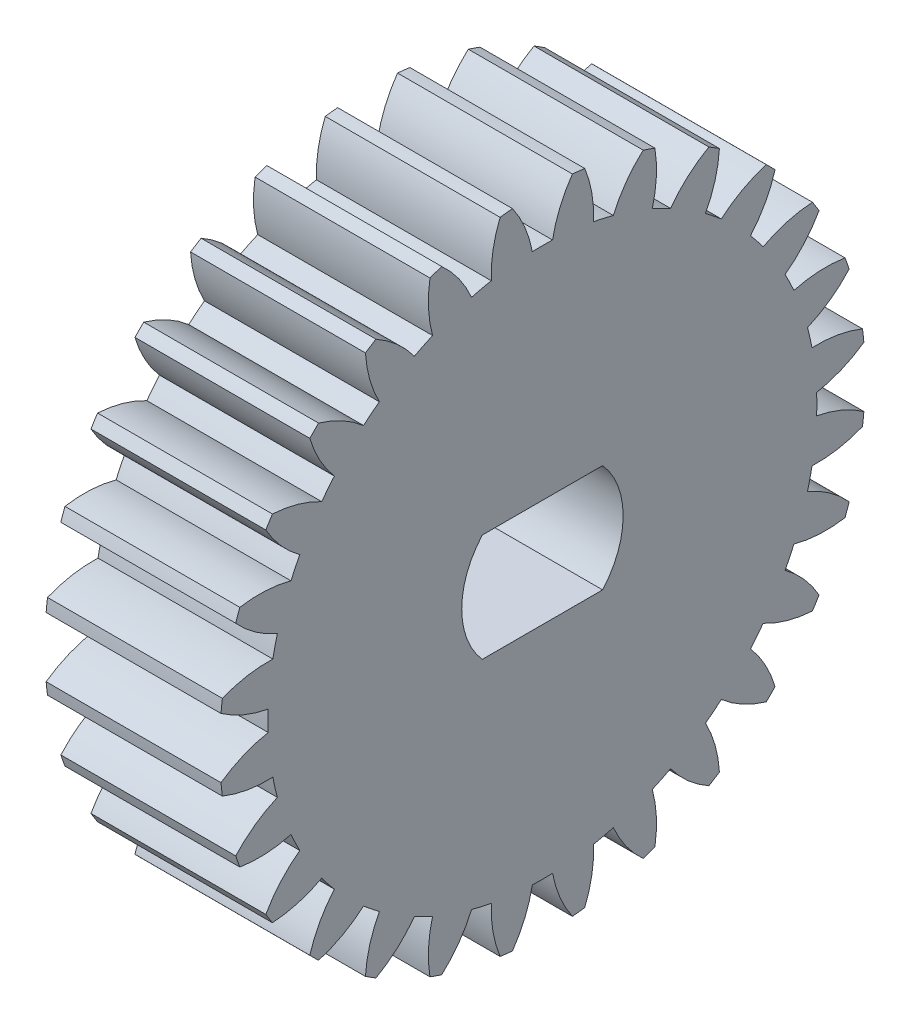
ISO-10303-21;
HEADER;
FILE_DESCRIPTION(('STEP AP214'),'2;1');
FILE_NAME('part.step','',(''),(''),'','','');
FILE_SCHEMA(('AUTOMOTIVE_DESIGN { 1 0 10303 214 1 1 1 1 }'));
ENDSEC;
DATA;
#1=APPLICATION_CONTEXT('core data for automotive mechanical design processes');
#2=APPLICATION_PROTOCOL_DEFINITION('international standard','automotive_design',2000,#1);
#3=PRODUCT_CONTEXT('',#1,'mechanical');
#4=PRODUCT('Part','Part','',(#3));
#5=PRODUCT_RELATED_PRODUCT_CATEGORY('part','',(#4));
#6=PRODUCT_DEFINITION_FORMATION('','',#4);
#7=PRODUCT_DEFINITION_CONTEXT('part definition',#1,'design');
#8=PRODUCT_DEFINITION('design','',#6,#7);
#9=PRODUCT_DEFINITION_SHAPE('','',#8);
#10=(LENGTH_UNIT() NAMED_UNIT(*) SI_UNIT(.MILLI.,.METRE.));
#11=(NAMED_UNIT(*) PLANE_ANGLE_UNIT() SI_UNIT($,.RADIAN.));
#12=(NAMED_UNIT(*) SI_UNIT($,.STERADIAN.) SOLID_ANGLE_UNIT());
#13=UNCERTAINTY_MEASURE_WITH_UNIT(LENGTH_MEASURE(1.E-05),#10,'distance_accuracy_value','');
#14=(GEOMETRIC_REPRESENTATION_CONTEXT(3) GLOBAL_UNCERTAINTY_ASSIGNED_CONTEXT((#13)) GLOBAL_UNIT_ASSIGNED_CONTEXT((#10,
#11,#12)) REPRESENTATION_CONTEXT('',''));
#15=CARTESIAN_POINT('',(0.,0.,0.));
#16=DIRECTION('',(0.,0.,1.));
#17=DIRECTION('',(1.,0.,0.));
#18=AXIS2_PLACEMENT_3D('',#15,#16,#17);
#19=CARTESIAN_POINT('',(6.5,0.,0.));
#20=DIRECTION('',(-1.,0.,0.));
#21=DIRECTION('',(0.,0.,1.));
#22=AXIS2_PLACEMENT_3D('',#19,#20,#21);
#23=PLANE('',#22);
#24=CARTESIAN_POINT('',(6.5,8.07671314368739,-6.74781537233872));
#25=DIRECTION('',(-1.,0.,0.));
#26=DIRECTION('',(0.,-0.222520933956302,-0.974927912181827));
#27=AXIS2_PLACEMENT_3D('',#24,#25,#26);
#28=CIRCLE('',#27,4.48);
#29=CARTESIAN_POINT('',(6.5,9.85276061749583,-2.63490212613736));
#30=VERTEX_POINT('',#29);
#31=CARTESIAN_POINT('',(6.5,11.4008532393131,-3.74440187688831));
#32=VERTEX_POINT('',#31);
#33=EDGE_CURVE('E768',#30,#32,#28,.T.);
#34=ORIENTED_EDGE('',*,*,#33,.F.);
#35=CARTESIAN_POINT('',(6.5,0.,0.));
#36=DIRECTION('',(-1.,0.,0.));
#37=DIRECTION('',(0.,-0.222520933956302,-0.974927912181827));
#38=AXIS2_PLACEMENT_3D('',#35,#36,#37);
#39=CIRCLE('',#38,10.199);
#40=CARTESIAN_POINT('',(6.5,10.0202717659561,-1.9009878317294));
#41=VERTEX_POINT('',#40);
#42=EDGE_CURVE('E772',#41,#30,#39,.T.);
#43=ORIENTED_EDGE('',*,*,#42,.F.);
#44=CARTESIAN_POINT('',(6.5,10.2046344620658,2.57521707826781));
#45=DIRECTION('',(-1.,0.,0.));
#46=DIRECTION('',(0.,-0.222520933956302,-0.974927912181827));
#47=AXIS2_PLACEMENT_3D('',#44,#45,#46);
#48=CIRCLE('',#47,4.48);
#49=CARTESIAN_POINT('',(6.5,11.8964489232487,-1.57305531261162));
#50=VERTEX_POINT('',#49);
#51=EDGE_CURVE('E770',#50,#41,#48,.T.);
#52=ORIENTED_EDGE('',*,*,#51,.F.);
#53=CARTESIAN_POINT('',(6.5,0.,0.));
#54=DIRECTION('',(-1.,0.,0.));
#55=DIRECTION('',(0.,0.,1.));
#56=AXIS2_PLACEMENT_3D('',#53,#54,#55);
#57=CIRCLE('',#56,12.);
#58=CARTESIAN_POINT('',(6.5,11.9482178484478,-1.11359339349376));
#59=VERTEX_POINT('',#58);
#60=EDGE_CURVE('E1384',#59,#50,#57,.T.);
#61=ORIENTED_EDGE('',*,*,#60,.F.);
#62=CARTESIAN_POINT('',(6.5,9.37574326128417,-4.78139580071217));
#63=DIRECTION('',(-1.,0.,0.));
#64=DIRECTION('',(0.,0.,-1.));
#65=AXIS2_PLACEMENT_3D('',#62,#63,#64);
#66=CIRCLE('',#65,4.48);
#67=CARTESIAN_POINT('',(6.5,10.1920522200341,-0.37639413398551));
#68=VERTEX_POINT('',#67);
#69=EDGE_CURVE('E1362',#68,#59,#66,.T.);
#70=ORIENTED_EDGE('',*,*,#69,.F.);
#71=CARTESIAN_POINT('',(6.5,0.,0.));
#72=DIRECTION('',(-1.,0.,0.));
#73=DIRECTION('',(0.,0.,-1.));
#74=AXIS2_PLACEMENT_3D('',#71,#72,#73);
#75=CIRCLE('',#74,10.199);
#76=CARTESIAN_POINT('',(6.5,10.1920522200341,0.376394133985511));
#77=VERTEX_POINT('',#76);
#78=EDGE_CURVE('E1366',#77,#68,#75,.T.);
#79=ORIENTED_EDGE('',*,*,#78,.F.);
#80=CARTESIAN_POINT('',(6.5,9.37574326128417,4.78139580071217));
#81=DIRECTION('',(-1.,0.,0.));
#82=DIRECTION('',(0.,0.,-1.));
#83=AXIS2_PLACEMENT_3D('',#80,#81,#82);
#84=CIRCLE('',#83,4.48);
#85=CARTESIAN_POINT('',(6.5,11.9482178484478,1.11359339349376));
#86=VERTEX_POINT('',#85);
#87=EDGE_CURVE('E1364',#86,#77,#84,.T.);
#88=ORIENTED_EDGE('',*,*,#87,.F.);
#89=CARTESIAN_POINT('',(6.5,11.8964489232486,1.57305531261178));
#90=VERTEX_POINT('',#89);
#91=EDGE_CURVE('E1382',#90,#86,#57,.T.);
#92=ORIENTED_EDGE('',*,*,#91,.F.);
#93=CARTESIAN_POINT('',(6.5,10.2046344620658,-2.57521707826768));
#94=DIRECTION('',(-1.,0.,0.));
#95=DIRECTION('',(0.,0.222520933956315,-0.974927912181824));
#96=AXIS2_PLACEMENT_3D('',#93,#94,#95);
#97=CIRCLE('',#96,4.48);
#98=CARTESIAN_POINT('',(6.5,10.0202717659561,1.90098783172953));
#99=VERTEX_POINT('',#98);
#100=EDGE_CURVE('E1340',#99,#90,#97,.T.);
#101=ORIENTED_EDGE('',*,*,#100,.F.);
#102=CARTESIAN_POINT('',(6.5,0.,0.));
#103=DIRECTION('',(-1.,0.,0.));
#104=DIRECTION('',(0.,0.222520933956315,-0.974927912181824));
#105=AXIS2_PLACEMENT_3D('',#102,#103,#104);
#106=CIRCLE('',#105,10.199);
#107=CARTESIAN_POINT('',(6.5,9.8527606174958,2.63490212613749));
#108=VERTEX_POINT('',#107);
#109=EDGE_CURVE('E1344',#108,#99,#106,.T.);
#110=ORIENTED_EDGE('',*,*,#109,.F.);
#111=CARTESIAN_POINT('',(6.5,8.0767131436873,6.74781537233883));
#112=DIRECTION('',(-1.,0.,0.));
#113=DIRECTION('',(0.,0.222520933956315,-0.974927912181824));
#114=AXIS2_PLACEMENT_3D('',#111,#112,#113);
#115=CIRCLE('',#114,4.48);
#116=CARTESIAN_POINT('',(6.5,11.400853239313,3.74440187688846));
#117=VERTEX_POINT('',#116);
#118=EDGE_CURVE('E1342',#117,#108,#115,.T.);
#119=ORIENTED_EDGE('',*,*,#118,.F.);
#120=CARTESIAN_POINT('',(6.5,11.2481423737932,4.18082445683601));
#121=VERTEX_POINT('',#120);
#122=EDGE_CURVE('E1605',#121,#117,#57,.T.);
#123=ORIENTED_EDGE('',*,*,#122,.F.);
#124=CARTESIAN_POINT('',(6.5,10.5218226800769,-0.239906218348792));
#125=DIRECTION('',(-1.,0.,0.));
#126=DIRECTION('',(0.,0.433883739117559,-0.900968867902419));
#127=AXIS2_PLACEMENT_3D('',#124,#125,#126);
#128=CIRCLE('',#127,4.48);
#129=CARTESIAN_POINT('',(6.5,9.34603304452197,4.08304632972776));
#130=VERTEX_POINT('',#129);
#131=EDGE_CURVE('E1318',#130,#121,#128,.T.);
#132=ORIENTED_EDGE('',*,*,#131,.F.);
#133=CARTESIAN_POINT('',(6.5,0.,0.));
#134=DIRECTION('',(-1.,0.,0.));
#135=DIRECTION('',(0.,0.433883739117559,-0.900968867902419));
#136=AXIS2_PLACEMENT_3D('',#133,#134,#135);
#137=CIRCLE('',#136,10.199);
#138=CARTESIAN_POINT('',(6.5,9.01941045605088,4.76128512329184));
#139=VERTEX_POINT('',#138);
#140=EDGE_CURVE('E1322',#139,#130,#137,.T.);
#141=ORIENTED_EDGE('',*,*,#140,.F.);
#142=CARTESIAN_POINT('',(6.5,6.37268290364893,8.37587130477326));
#143=DIRECTION('',(-1.,0.,0.));
#144=DIRECTION('',(0.,0.433883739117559,-0.900968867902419));
#145=AXIS2_PLACEMENT_3D('',#142,#143,#144);
#146=CIRCLE('',#145,4.48);
#147=CARTESIAN_POINT('',(6.5,10.2818022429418,6.18745041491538));
#148=VERTEX_POINT('',#147);
#149=EDGE_CURVE('E1320',#148,#139,#146,.T.);
#150=ORIENTED_EDGE('',*,*,#149,.F.);
#151=CARTESIAN_POINT('',(6.5,10.0358069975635,6.5789496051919));
#152=VERTEX_POINT('',#151);
#153=EDGE_CURVE('E1606',#152,#148,#57,.T.);
#154=ORIENTED_EDGE('',*,*,#153,.F.);
#155=CARTESIAN_POINT('',(6.5,10.3114027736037,2.10743454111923));
#156=DIRECTION('',(-1.,0.,0.));
#157=DIRECTION('',(0.,0.623489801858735,-0.781831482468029));
#158=AXIS2_PLACEMENT_3D('',#155,#156,#157);
#159=CIRCLE('',#158,4.48);
#160=CARTESIAN_POINT('',(6.5,8.20314520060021,6.06036383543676));
#161=VERTEX_POINT('',#160);
#162=EDGE_CURVE('E1296',#161,#152,#159,.T.);
#163=ORIENTED_EDGE('',*,*,#162,.F.);
#164=CARTESIAN_POINT('',(6.5,0.,0.));
#165=DIRECTION('',(-1.,0.,0.));
#166=DIRECTION('',(0.,0.623489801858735,-0.781831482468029));
#167=AXIS2_PLACEMENT_3D('',#164,#165,#166);
#168=CIRCLE('',#167,10.199);
#169=CARTESIAN_POINT('',(6.5,7.73378939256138,6.64891740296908));
#170=VERTEX_POINT('',#169);
#171=EDGE_CURVE('E1300',#170,#161,#168,.T.);
#172=ORIENTED_EDGE('',*,*,#171,.F.);
#173=CARTESIAN_POINT('',(6.5,4.34909973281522,9.58392607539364));
#174=DIRECTION('',(-1.,0.,0.));
#175=DIRECTION('',(0.,0.623489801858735,-0.781831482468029));
#176=AXIS2_PLACEMENT_3D('',#173,#174,#175);
#177=CIRCLE('',#176,4.48);
#178=CARTESIAN_POINT('',(6.5,8.6471787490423,8.32023435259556));
#179=VERTEX_POINT('',#178);
#180=EDGE_CURVE('E1298',#179,#170,#177,.T.);
#181=ORIENTED_EDGE('',*,*,#180,.F.);
#182=CARTESIAN_POINT('',(6.5,8.32023435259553,8.64717874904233));
#183=VERTEX_POINT('',#182);
#184=EDGE_CURVE('E1611',#183,#179,#57,.T.);
#185=ORIENTED_EDGE('',*,*,#184,.F.);
#186=CARTESIAN_POINT('',(6.5,9.58392607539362,4.34909973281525));
#187=DIRECTION('',(-1.,0.,0.));
#188=DIRECTION('',(0.,0.781831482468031,-0.623489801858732));
#189=AXIS2_PLACEMENT_3D('',#186,#187,#188);
#190=CIRCLE('',#189,4.48);
#191=CARTESIAN_POINT('',(6.5,6.64891740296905,7.7337893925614));
#192=VERTEX_POINT('',#191);
#193=EDGE_CURVE('E1274',#192,#183,#190,.T.);
#194=ORIENTED_EDGE('',*,*,#193,.F.);
#195=CARTESIAN_POINT('',(6.5,0.,0.));
#196=DIRECTION('',(-1.,0.,0.));
#197=DIRECTION('',(0.,0.781831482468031,-0.623489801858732));
#198=AXIS2_PLACEMENT_3D('',#195,#196,#197);
#199=CIRCLE('',#198,10.199);
#200=CARTESIAN_POINT('',(6.5,6.06036383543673,8.20314520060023));
#201=VERTEX_POINT('',#200);
#202=EDGE_CURVE('E1278',#201,#192,#199,.T.);
#203=ORIENTED_EDGE('',*,*,#202,.F.);
#204=CARTESIAN_POINT('',(6.5,2.10743454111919,10.3114027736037));
#205=DIRECTION('',(-1.,0.,0.));
#206=DIRECTION('',(0.,0.781831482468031,-0.623489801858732));
#207=AXIS2_PLACEMENT_3D('',#204,#205,#206);
#208=CIRCLE('',#207,4.48);
#209=CARTESIAN_POINT('',(6.5,6.57894960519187,10.0358069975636));
#210=VERTEX_POINT('',#209);
#211=EDGE_CURVE('E1276',#210,#201,#208,.T.);
#212=ORIENTED_EDGE('',*,*,#211,.F.);
#213=CARTESIAN_POINT('',(6.5,6.18745041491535,10.2818022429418));
#214=VERTEX_POINT('',#213);
#215=EDGE_CURVE('E1616',#214,#210,#57,.T.);
#216=ORIENTED_EDGE('',*,*,#215,.F.);
#217=CARTESIAN_POINT('',(6.5,8.37587130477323,6.37268290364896));
#218=DIRECTION('',(-1.,0.,0.));
#219=DIRECTION('',(0.,0.90096886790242,-0.433883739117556));
#220=AXIS2_PLACEMENT_3D('',#217,#218,#219);
#221=CIRCLE('',#220,4.48);
#222=CARTESIAN_POINT('',(6.5,4.7612851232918,9.01941045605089));
#223=VERTEX_POINT('',#222);
#224=EDGE_CURVE('E1252',#223,#214,#221,.T.);
#225=ORIENTED_EDGE('',*,*,#224,.F.);
#226=CARTESIAN_POINT('',(6.5,0.,0.));
#227=DIRECTION('',(-1.,0.,0.));
#228=DIRECTION('',(0.,0.90096886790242,-0.433883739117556));
#229=AXIS2_PLACEMENT_3D('',#226,#227,#228);
#230=CIRCLE('',#229,10.199);
#231=CARTESIAN_POINT('',(6.5,4.08304632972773,9.34603304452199));
#232=VERTEX_POINT('',#231);
#233=EDGE_CURVE('E1256',#232,#223,#230,.T.);
#234=ORIENTED_EDGE('',*,*,#233,.F.);
#235=CARTESIAN_POINT('',(6.5,-0.239906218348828,10.5218226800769));
#236=DIRECTION('',(-1.,0.,0.));
#237=DIRECTION('',(0.,0.90096886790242,-0.433883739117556));
#238=AXIS2_PLACEMENT_3D('',#235,#236,#237);
#239=CIRCLE('',#238,4.48);
#240=CARTESIAN_POINT('',(6.5,4.18082445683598,11.2481423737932));
#241=VERTEX_POINT('',#240);
#242=EDGE_CURVE('E1254',#241,#232,#239,.T.);
#243=ORIENTED_EDGE('',*,*,#242,.F.);
#244=CARTESIAN_POINT('',(6.5,3.74440187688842,11.400853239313));
#245=VERTEX_POINT('',#244);
#246=EDGE_CURVE('E1621',#245,#241,#57,.T.);
#247=ORIENTED_EDGE('',*,*,#246,.F.);
#248=CARTESIAN_POINT('',(6.5,6.7478153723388,8.07671314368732));
#249=DIRECTION('',(-1.,0.,0.));
#250=DIRECTION('',(0.,0.974927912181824,-0.222520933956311));
#251=AXIS2_PLACEMENT_3D('',#248,#249,#250);
#252=CIRCLE('',#251,4.48);
#253=CARTESIAN_POINT('',(6.5,2.63490212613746,9.8527606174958));
#254=VERTEX_POINT('',#253);
#255=EDGE_CURVE('E1230',#254,#245,#252,.T.);
#256=ORIENTED_EDGE('',*,*,#255,.F.);
#257=CARTESIAN_POINT('',(6.5,0.,0.));
#258=DIRECTION('',(-1.,0.,0.));
#259=DIRECTION('',(0.,0.974927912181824,-0.222520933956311));
#260=AXIS2_PLACEMENT_3D('',#257,#258,#259);
#261=CIRCLE('',#260,10.199);
#262=CARTESIAN_POINT('',(6.5,1.9009878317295,10.0202717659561));
#263=VERTEX_POINT('',#262);
#264=EDGE_CURVE('E1234',#263,#254,#261,.T.);
#265=ORIENTED_EDGE('',*,*,#264,.F.);
#266=CARTESIAN_POINT('',(6.5,-2.57521707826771,10.2046344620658));
#267=DIRECTION('',(-1.,0.,0.));
#268=DIRECTION('',(0.,0.974927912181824,-0.222520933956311));
#269=AXIS2_PLACEMENT_3D('',#266,#267,#268);
#270=CIRCLE('',#269,4.48);
#271=CARTESIAN_POINT('',(6.5,1.57305531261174,11.8964489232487));
#272=VERTEX_POINT('',#271);
#273=EDGE_CURVE('E1232',#272,#263,#270,.T.);
#274=ORIENTED_EDGE('',*,*,#273,.F.);
#275=CARTESIAN_POINT('',(6.5,1.11359339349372,11.9482178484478));
#276=VERTEX_POINT('',#275);
#277=EDGE_CURVE('E1626',#276,#272,#57,.T.);
#278=ORIENTED_EDGE('',*,*,#277,.F.);
#279=CARTESIAN_POINT('',(6.5,4.78139580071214,9.37574326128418));
#280=DIRECTION('',(-1.,0.,0.));
#281=DIRECTION('',(0.,1.,0.));
#282=AXIS2_PLACEMENT_3D('',#279,#280,#281);
#283=CIRCLE('',#282,4.48);
#284=CARTESIAN_POINT('',(6.5,0.376394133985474,10.1920522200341));
#285=VERTEX_POINT('',#284);
#286=EDGE_CURVE('E1208',#285,#276,#283,.T.);
#287=ORIENTED_EDGE('',*,*,#286,.F.);
#288=CARTESIAN_POINT('',(6.5,0.,0.));
#289=DIRECTION('',(-1.,0.,0.));
#290=DIRECTION('',(0.,1.,0.));
#291=AXIS2_PLACEMENT_3D('',#288,#289,#290);
#292=CIRCLE('',#291,10.199);
#293=CARTESIAN_POINT('',(6.5,-0.376394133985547,10.1920522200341));
#294=VERTEX_POINT('',#293);
#295=EDGE_CURVE('E1212',#294,#285,#292,.T.);
#296=ORIENTED_EDGE('',*,*,#295,.F.);
#297=CARTESIAN_POINT('',(6.5,-4.7813958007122,9.37574326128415));
#298=DIRECTION('',(-1.,0.,0.));
#299=DIRECTION('',(0.,1.,0.));
#300=AXIS2_PLACEMENT_3D('',#297,#298,#299);
#301=CIRCLE('',#300,4.48);
#302=CARTESIAN_POINT('',(6.5,-1.1135933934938,11.9482178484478));
#303=VERTEX_POINT('',#302);
#304=EDGE_CURVE('E1210',#303,#294,#301,.T.);
#305=ORIENTED_EDGE('',*,*,#304,.F.);
#306=CARTESIAN_POINT('',(6.5,-1.57305531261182,11.8964489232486));
#307=VERTEX_POINT('',#306);
#308=EDGE_CURVE('E1631',#307,#303,#57,.T.);
#309=ORIENTED_EDGE('',*,*,#308,.F.);
#310=CARTESIAN_POINT('',(6.5,2.57521707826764,10.2046344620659));
#311=DIRECTION('',(-1.,0.,0.));
#312=DIRECTION('',(0.,0.974927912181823,0.222520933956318));
#313=AXIS2_PLACEMENT_3D('',#310,#311,#312);
#314=CIRCLE('',#313,4.48);
#315=CARTESIAN_POINT('',(6.5,-1.90098783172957,10.0202717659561));
#316=VERTEX_POINT('',#315);
#317=EDGE_CURVE('E1186',#316,#307,#314,.T.);
#318=ORIENTED_EDGE('',*,*,#317,.F.);
#319=CARTESIAN_POINT('',(6.5,0.,0.));
#320=DIRECTION('',(-1.,0.,0.));
#321=DIRECTION('',(0.,0.974927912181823,0.222520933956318));
#322=AXIS2_PLACEMENT_3D('',#319,#320,#321);
#323=CIRCLE('',#322,10.199);
#324=CARTESIAN_POINT('',(6.5,-2.63490212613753,9.85276061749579));
#325=VERTEX_POINT('',#324);
#326=EDGE_CURVE('E1190',#325,#316,#323,.T.);
#327=ORIENTED_EDGE('',*,*,#326,.F.);
#328=CARTESIAN_POINT('',(6.5,-6.74781537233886,8.07671314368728));
#329=DIRECTION('',(-1.,0.,0.));
#330=DIRECTION('',(0.,0.974927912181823,0.222520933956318));
#331=AXIS2_PLACEMENT_3D('',#328,#329,#330);
#332=CIRCLE('',#331,4.48);
#333=CARTESIAN_POINT('',(6.5,-3.7444018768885,11.400853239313));
#334=VERTEX_POINT('',#333);
#335=EDGE_CURVE('E1188',#334,#325,#332,.T.);
#336=ORIENTED_EDGE('',*,*,#335,.F.);
#337=CARTESIAN_POINT('',(6.5,-4.18082445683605,11.2481423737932));
#338=VERTEX_POINT('',#337);
#339=EDGE_CURVE('E1636',#338,#334,#57,.T.);
#340=ORIENTED_EDGE('',*,*,#339,.F.);
#341=CARTESIAN_POINT('',(6.5,0.239906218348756,10.5218226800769));
#342=DIRECTION('',(-1.,0.,0.));
#343=DIRECTION('',(0.,0.900968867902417,0.433883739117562));
#344=AXIS2_PLACEMENT_3D('',#341,#342,#343);
#345=CIRCLE('',#344,4.48);
#346=CARTESIAN_POINT('',(6.5,-4.08304632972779,9.34603304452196));
#347=VERTEX_POINT('',#346);
#348=EDGE_CURVE('E1164',#347,#338,#345,.T.);
#349=ORIENTED_EDGE('',*,*,#348,.F.);
#350=CARTESIAN_POINT('',(6.5,0.,0.));
#351=DIRECTION('',(-1.,0.,0.));
#352=DIRECTION('',(0.,0.900968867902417,0.433883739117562));
#353=AXIS2_PLACEMENT_3D('',#350,#351,#352);
#354=CIRCLE('',#353,10.199);
#355=CARTESIAN_POINT('',(6.5,-4.76128512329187,9.01941045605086));
#356=VERTEX_POINT('',#355);
#357=EDGE_CURVE('E1168',#356,#347,#354,.T.);
#358=ORIENTED_EDGE('',*,*,#357,.F.);
#359=CARTESIAN_POINT('',(6.5,-8.37587130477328,6.37268290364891));
#360=DIRECTION('',(-1.,0.,0.));
#361=DIRECTION('',(0.,0.900968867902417,0.433883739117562));
#362=AXIS2_PLACEMENT_3D('',#359,#360,#361);
#363=CIRCLE('',#362,4.48);
#364=CARTESIAN_POINT('',(6.5,-6.18745041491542,10.2818022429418));
#365=VERTEX_POINT('',#364);
#366=EDGE_CURVE('E1166',#365,#356,#363,.T.);
#367=ORIENTED_EDGE('',*,*,#366,.F.);
#368=CARTESIAN_POINT('',(6.5,-6.57894960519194,10.0358069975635));
#369=VERTEX_POINT('',#368);
#370=EDGE_CURVE('E1641',#369,#365,#57,.T.);
#371=ORIENTED_EDGE('',*,*,#370,.F.);
#372=CARTESIAN_POINT('',(6.5,-2.10743454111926,10.3114027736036));
#373=DIRECTION('',(-1.,0.,0.));
#374=DIRECTION('',(0.,0.781831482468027,0.623489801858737));
#375=AXIS2_PLACEMENT_3D('',#372,#373,#374);
#376=CIRCLE('',#375,4.48);
#377=CARTESIAN_POINT('',(6.5,-6.06036383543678,8.20314520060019));
#378=VERTEX_POINT('',#377);
#379=EDGE_CURVE('E1142',#378,#369,#376,.T.);
#380=ORIENTED_EDGE('',*,*,#379,.F.);
#381=CARTESIAN_POINT('',(6.5,0.,0.));
#382=DIRECTION('',(-1.,0.,0.));
#383=DIRECTION('',(0.,0.781831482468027,0.623489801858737));
#384=AXIS2_PLACEMENT_3D('',#381,#382,#383);
#385=CIRCLE('',#384,10.199);
#386=CARTESIAN_POINT('',(6.5,-6.6489174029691,7.73378939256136));
#387=VERTEX_POINT('',#386);
#388=EDGE_CURVE('E1146',#387,#378,#385,.T.);
#389=ORIENTED_EDGE('',*,*,#388,.F.);
#390=CARTESIAN_POINT('',(6.5,-9.58392607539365,4.34909973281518));
#391=DIRECTION('',(-1.,0.,0.));
#392=DIRECTION('',(0.,0.781831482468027,0.623489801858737));
#393=AXIS2_PLACEMENT_3D('',#390,#391,#392);
#394=CIRCLE('',#393,4.48);
#395=CARTESIAN_POINT('',(6.5,-8.32023435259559,8.64717874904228));
#396=VERTEX_POINT('',#395);
#397=EDGE_CURVE('E1144',#396,#387,#394,.T.);
#398=ORIENTED_EDGE('',*,*,#397,.F.);
#399=CARTESIAN_POINT('',(6.5,-8.64717874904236,8.3202343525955));
#400=VERTEX_POINT('',#399);
#401=EDGE_CURVE('E1646',#400,#396,#57,.T.);
#402=ORIENTED_EDGE('',*,*,#401,.F.);
#403=CARTESIAN_POINT('',(6.5,-4.34909973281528,9.58392607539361));
#404=DIRECTION('',(-1.,0.,0.));
#405=DIRECTION('',(0.,0.623489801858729,0.781831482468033));
#406=AXIS2_PLACEMENT_3D('',#403,#404,#405);
#407=CIRCLE('',#406,4.48);
#408=CARTESIAN_POINT('',(6.5,-7.73378939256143,6.64891740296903));
#409=VERTEX_POINT('',#408);
#410=EDGE_CURVE('E1120',#409,#400,#407,.T.);
#411=ORIENTED_EDGE('',*,*,#410,.F.);
#412=CARTESIAN_POINT('',(6.5,0.,0.));
#413=DIRECTION('',(-1.,0.,0.));
#414=DIRECTION('',(0.,0.623489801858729,0.781831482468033));
#415=AXIS2_PLACEMENT_3D('',#412,#413,#414);
#416=CIRCLE('',#415,10.199);
#417=CARTESIAN_POINT('',(6.5,-8.20314520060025,6.0603638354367));
#418=VERTEX_POINT('',#417);
#419=EDGE_CURVE('E1124',#418,#409,#416,.T.);
#420=ORIENTED_EDGE('',*,*,#419,.F.);
#421=CARTESIAN_POINT('',(6.5,-10.3114027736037,2.10743454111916));
#422=DIRECTION('',(-1.,0.,0.));
#423=DIRECTION('',(0.,0.623489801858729,0.781831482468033));
#424=AXIS2_PLACEMENT_3D('',#421,#422,#423);
#425=CIRCLE('',#424,4.48);
#426=CARTESIAN_POINT('',(6.5,-10.0358069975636,6.57894960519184));
#427=VERTEX_POINT('',#426);
#428=EDGE_CURVE('E1122',#427,#418,#425,.T.);
#429=ORIENTED_EDGE('',*,*,#428,.F.);
#430=CARTESIAN_POINT('',(6.5,-10.2818022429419,6.18745041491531));
#431=VERTEX_POINT('',#430);
#432=EDGE_CURVE('E1651',#431,#427,#57,.T.);
#433=ORIENTED_EDGE('',*,*,#432,.F.);
#434=CARTESIAN_POINT('',(6.5,-6.37268290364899,8.37587130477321));
#435=DIRECTION('',(-1.,0.,0.));
#436=DIRECTION('',(0.,0.433883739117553,0.900968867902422));
#437=AXIS2_PLACEMENT_3D('',#434,#435,#436);
#438=CIRCLE('',#437,4.48);
#439=CARTESIAN_POINT('',(6.5,-9.01941045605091,4.76128512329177));
#440=VERTEX_POINT('',#439);
#441=EDGE_CURVE('E1098',#440,#431,#438,.T.);
#442=ORIENTED_EDGE('',*,*,#441,.F.);
#443=CARTESIAN_POINT('',(6.5,0.,0.));
#444=DIRECTION('',(-1.,0.,0.));
#445=DIRECTION('',(0.,0.433883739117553,0.900968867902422));
#446=AXIS2_PLACEMENT_3D('',#443,#444,#445);
#447=CIRCLE('',#446,10.199);
#448=CARTESIAN_POINT('',(6.5,-9.346033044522,4.08304632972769));
#449=VERTEX_POINT('',#448);
#450=EDGE_CURVE('E1102',#449,#440,#447,.T.);
#451=ORIENTED_EDGE('',*,*,#450,.F.);
#452=CARTESIAN_POINT('',(6.5,-10.5218226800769,-0.239906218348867));
#453=DIRECTION('',(-1.,0.,0.));
#454=DIRECTION('',(0.,0.433883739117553,0.900968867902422));
#455=AXIS2_PLACEMENT_3D('',#452,#453,#454);
#456=CIRCLE('',#455,4.48);
#457=CARTESIAN_POINT('',(6.5,-11.2481423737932,4.18082445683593));
#458=VERTEX_POINT('',#457);
#459=EDGE_CURVE('E1100',#458,#449,#456,.T.);
#460=ORIENTED_EDGE('',*,*,#459,.F.);
#461=CARTESIAN_POINT('',(6.5,-11.400853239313,3.74440187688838));
#462=VERTEX_POINT('',#461);
#463=EDGE_CURVE('E1656',#462,#458,#57,.T.);
#464=ORIENTED_EDGE('',*,*,#463,.F.);
#465=CARTESIAN_POINT('',(6.5,-8.07671314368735,6.74781537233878));
#466=DIRECTION('',(-1.,0.,0.));
#467=DIRECTION('',(0.,0.222520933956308,0.974927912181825));
#468=AXIS2_PLACEMENT_3D('',#465,#466,#467);
#469=CIRCLE('',#468,4.48);
#470=CARTESIAN_POINT('',(6.5,-9.85276061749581,2.63490212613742));
#471=VERTEX_POINT('',#470);
#472=EDGE_CURVE('E1076',#471,#462,#469,.T.);
#473=ORIENTED_EDGE('',*,*,#472,.F.);
#474=CARTESIAN_POINT('',(6.5,0.,0.));
#475=DIRECTION('',(-1.,0.,0.));
#476=DIRECTION('',(0.,0.222520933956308,0.974927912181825));
#477=AXIS2_PLACEMENT_3D('',#474,#475,#476);
#478=CIRCLE('',#477,10.199);
#479=CARTESIAN_POINT('',(6.5,-10.0202717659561,1.90098783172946));
#480=VERTEX_POINT('',#479);
#481=EDGE_CURVE('E1080',#480,#471,#478,.T.);
#482=ORIENTED_EDGE('',*,*,#481,.F.);
#483=CARTESIAN_POINT('',(6.5,-10.2046344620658,-2.57521707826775));
#484=DIRECTION('',(-1.,0.,0.));
#485=DIRECTION('',(0.,0.222520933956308,0.974927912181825));
#486=AXIS2_PLACEMENT_3D('',#483,#484,#485);
#487=CIRCLE('',#486,4.48);
#488=CARTESIAN_POINT('',(6.5,-11.8964489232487,1.5730553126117));
#489=VERTEX_POINT('',#488);
#490=EDGE_CURVE('E1078',#489,#480,#487,.T.);
#491=ORIENTED_EDGE('',*,*,#490,.F.);
#492=CARTESIAN_POINT('',(6.5,-11.9482178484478,1.11359339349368));
#493=VERTEX_POINT('',#492);
#494=EDGE_CURVE('E1661',#493,#489,#57,.T.);
#495=ORIENTED_EDGE('',*,*,#494,.F.);
#496=CARTESIAN_POINT('',(6.5,-9.3757432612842,4.78139580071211));
#497=DIRECTION('',(-1.,0.,0.));
#498=DIRECTION('',(0.,0.,1.));
#499=AXIS2_PLACEMENT_3D('',#496,#497,#498);
#500=CIRCLE('',#499,4.48);
#501=CARTESIAN_POINT('',(6.5,-10.1920522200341,0.376394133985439));
#502=VERTEX_POINT('',#501);
#503=EDGE_CURVE('E1054',#502,#493,#500,.T.);
#504=ORIENTED_EDGE('',*,*,#503,.F.);
#505=CARTESIAN_POINT('',(6.5,0.,0.));
#506=DIRECTION('',(-1.,0.,0.));
#507=DIRECTION('',(0.,0.,1.));
#508=AXIS2_PLACEMENT_3D('',#505,#506,#507);
#509=CIRCLE('',#508,10.199);
#510=CARTESIAN_POINT('',(6.5,-10.1920522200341,-0.376394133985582));
#511=VERTEX_POINT('',#510);
#512=EDGE_CURVE('E1058',#511,#502,#509,.T.);
#513=ORIENTED_EDGE('',*,*,#512,.F.);
#514=CARTESIAN_POINT('',(6.5,-9.37574326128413,-4.78139580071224));
#515=DIRECTION('',(-1.,0.,0.));
#516=DIRECTION('',(0.,0.,1.));
#517=AXIS2_PLACEMENT_3D('',#514,#515,#516);
#518=CIRCLE('',#517,4.48);
#519=CARTESIAN_POINT('',(6.5,-11.9482178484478,-1.11359339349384));
#520=VERTEX_POINT('',#519);
#521=EDGE_CURVE('E1056',#520,#511,#518,.T.);
#522=ORIENTED_EDGE('',*,*,#521,.F.);
#523=CARTESIAN_POINT('',(6.5,-11.8964489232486,-1.57305531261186));
#524=VERTEX_POINT('',#523);
#525=EDGE_CURVE('E1666',#524,#520,#57,.T.);
#526=ORIENTED_EDGE('',*,*,#525,.F.);
#527=CARTESIAN_POINT('',(6.5,-10.2046344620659,2.57521707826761));
#528=DIRECTION('',(-1.,0.,0.));
#529=DIRECTION('',(0.,-0.222520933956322,0.974927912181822));
#530=AXIS2_PLACEMENT_3D('',#527,#528,#529);
#531=CIRCLE('',#530,4.48);
#532=CARTESIAN_POINT('',(6.5,-10.0202717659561,-1.9009878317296));
#533=VERTEX_POINT('',#532);
#534=EDGE_CURVE('E1032',#533,#524,#531,.T.);
#535=ORIENTED_EDGE('',*,*,#534,.F.);
#536=CARTESIAN_POINT('',(6.5,0.,0.));
#537=DIRECTION('',(-1.,0.,0.));
#538=DIRECTION('',(0.,-0.222520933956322,0.974927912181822));
#539=AXIS2_PLACEMENT_3D('',#536,#537,#538);
#540=CIRCLE('',#539,10.199);
#541=CARTESIAN_POINT('',(6.5,-9.85276061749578,-2.63490212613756));
#542=VERTEX_POINT('',#541);
#543=EDGE_CURVE('E1036',#542,#533,#540,.T.);
#544=ORIENTED_EDGE('',*,*,#543,.F.);
#545=CARTESIAN_POINT('',(6.5,-8.07671314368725,-6.74781537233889));
#546=DIRECTION('',(-1.,0.,0.));
#547=DIRECTION('',(0.,-0.222520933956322,0.974927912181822));
#548=AXIS2_PLACEMENT_3D('',#545,#546,#547);
#549=CIRCLE('',#548,4.48);
#550=CARTESIAN_POINT('',(6.5,-11.400853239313,-3.74440187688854));
#551=VERTEX_POINT('',#550);
#552=EDGE_CURVE('E1034',#551,#542,#549,.T.);
#553=ORIENTED_EDGE('',*,*,#552,.F.);
#554=CARTESIAN_POINT('',(6.5,-11.2481423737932,-4.18082445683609));
#555=VERTEX_POINT('',#554);
#556=EDGE_CURVE('E1671',#555,#551,#57,.T.);
#557=ORIENTED_EDGE('',*,*,#556,.F.);
#558=CARTESIAN_POINT('',(6.5,-10.5218226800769,0.23990621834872));
#559=DIRECTION('',(-1.,0.,0.));
#560=DIRECTION('',(0.,-0.433883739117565,0.900968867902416));
#561=AXIS2_PLACEMENT_3D('',#558,#559,#560);
#562=CIRCLE('',#561,4.48);
#563=CARTESIAN_POINT('',(6.5,-9.34603304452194,-4.08304632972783));
#564=VERTEX_POINT('',#563);
#565=EDGE_CURVE('E1010',#564,#555,#562,.T.);
#566=ORIENTED_EDGE('',*,*,#565,.F.);
#567=CARTESIAN_POINT('',(6.5,0.,0.));
#568=DIRECTION('',(-1.,0.,0.));
#569=DIRECTION('',(0.,-0.433883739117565,0.900968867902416));
#570=AXIS2_PLACEMENT_3D('',#567,#568,#569);
#571=CIRCLE('',#570,10.199);
#572=CARTESIAN_POINT('',(6.5,-9.01941045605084,-4.7612851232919));
#573=VERTEX_POINT('',#572);
#574=EDGE_CURVE('E1014',#573,#564,#571,.T.);
#575=ORIENTED_EDGE('',*,*,#574,.F.);
#576=CARTESIAN_POINT('',(6.5,-6.37268290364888,-8.3758713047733));
#577=DIRECTION('',(-1.,0.,0.));
#578=DIRECTION('',(0.,-0.433883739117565,0.900968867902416));
#579=AXIS2_PLACEMENT_3D('',#576,#577,#578);
#580=CIRCLE('',#579,4.48);
#581=CARTESIAN_POINT('',(6.5,-10.2818022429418,-6.18745041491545));
#582=VERTEX_POINT('',#581);
#583=EDGE_CURVE('E1012',#582,#573,#580,.T.);
#584=ORIENTED_EDGE('',*,*,#583,.F.);
#585=CARTESIAN_POINT('',(6.5,-10.0358069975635,-6.57894960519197));
#586=VERTEX_POINT('',#585);
#587=EDGE_CURVE('E1676',#586,#582,#57,.T.);
#588=ORIENTED_EDGE('',*,*,#587,.F.);
#589=CARTESIAN_POINT('',(6.5,-10.3114027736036,-2.1074345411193));
#590=DIRECTION('',(-1.,0.,0.));
#591=DIRECTION('',(0.,-0.62348980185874,0.781831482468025));
#592=AXIS2_PLACEMENT_3D('',#589,#590,#591);
#593=CIRCLE('',#592,4.48);
#594=CARTESIAN_POINT('',(6.5,-8.20314520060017,-6.06036383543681));
#595=VERTEX_POINT('',#594);
#596=EDGE_CURVE('E988',#595,#586,#593,.T.);
#597=ORIENTED_EDGE('',*,*,#596,.F.);
#598=CARTESIAN_POINT('',(6.5,0.,0.));
#599=DIRECTION('',(-1.,0.,0.));
#600=DIRECTION('',(0.,-0.62348980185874,0.781831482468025));
#601=AXIS2_PLACEMENT_3D('',#598,#599,#600);
#602=CIRCLE('',#601,10.199);
#603=CARTESIAN_POINT('',(6.5,-7.73378939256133,-6.64891740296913));
#604=VERTEX_POINT('',#603);
#605=EDGE_CURVE('E992',#604,#595,#602,.T.);
#606=ORIENTED_EDGE('',*,*,#605,.F.);
#607=CARTESIAN_POINT('',(6.5,-4.34909973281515,-9.58392607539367));
#608=DIRECTION('',(-1.,0.,0.));
#609=DIRECTION('',(0.,-0.62348980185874,0.781831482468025));
#610=AXIS2_PLACEMENT_3D('',#607,#608,#609);
#611=CIRCLE('',#610,4.48);
#612=CARTESIAN_POINT('',(6.5,-8.64717874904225,-8.32023435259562));
#613=VERTEX_POINT('',#612);
#614=EDGE_CURVE('E990',#613,#604,#611,.T.);
#615=ORIENTED_EDGE('',*,*,#614,.F.);
#616=CARTESIAN_POINT('',(6.5,-8.32023435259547,-8.64717874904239));
#617=VERTEX_POINT('',#616);
#618=EDGE_CURVE('E1681',#617,#613,#57,.T.);
#619=ORIENTED_EDGE('',*,*,#618,.F.);
#620=CARTESIAN_POINT('',(6.5,-9.58392607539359,-4.34909973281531));
#621=DIRECTION('',(-1.,0.,0.));
#622=DIRECTION('',(0.,-0.781831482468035,0.623489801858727));
#623=AXIS2_PLACEMENT_3D('',#620,#621,#622);
#624=CIRCLE('',#623,4.48);
#625=CARTESIAN_POINT('',(6.5,-6.648917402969,-7.73378939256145));
#626=VERTEX_POINT('',#625);
#627=EDGE_CURVE('E966',#626,#617,#624,.T.);
#628=ORIENTED_EDGE('',*,*,#627,.F.);
#629=CARTESIAN_POINT('',(6.5,0.,0.));
#630=DIRECTION('',(-1.,0.,0.));
#631=DIRECTION('',(0.,-0.781831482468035,0.623489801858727));
#632=AXIS2_PLACEMENT_3D('',#629,#630,#631);
#633=CIRCLE('',#632,10.199);
#634=CARTESIAN_POINT('',(6.5,-6.06036383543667,-8.20314520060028));
#635=VERTEX_POINT('',#634);
#636=EDGE_CURVE('E970',#635,#626,#633,.T.);
#637=ORIENTED_EDGE('',*,*,#636,.F.);
#638=CARTESIAN_POINT('',(6.5,-2.10743454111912,-10.3114027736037));
#639=DIRECTION('',(-1.,0.,0.));
#640=DIRECTION('',(0.,-0.781831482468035,0.623489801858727));
#641=AXIS2_PLACEMENT_3D('',#638,#639,#640);
#642=CIRCLE('',#641,4.48);
#643=CARTESIAN_POINT('',(6.5,-6.5789496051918,-10.0358069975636));
#644=VERTEX_POINT('',#643);
#645=EDGE_CURVE('E968',#644,#635,#642,.T.);
#646=ORIENTED_EDGE('',*,*,#645,.F.);
#647=CARTESIAN_POINT('',(6.5,-6.18745041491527,-10.2818022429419));
#648=VERTEX_POINT('',#647);
#649=EDGE_CURVE('E1686',#648,#644,#57,.T.);
#650=ORIENTED_EDGE('',*,*,#649,.F.);
#651=CARTESIAN_POINT('',(6.5,-8.37587130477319,-6.37268290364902));
#652=DIRECTION('',(-1.,0.,0.));
#653=DIRECTION('',(0.,-0.900968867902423,0.433883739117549));
#654=AXIS2_PLACEMENT_3D('',#651,#652,#653);
#655=CIRCLE('',#654,4.48);
#656=CARTESIAN_POINT('',(6.5,-4.76128512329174,-9.01941045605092));
#657=VERTEX_POINT('',#656);
#658=EDGE_CURVE('E944',#657,#648,#655,.T.);
#659=ORIENTED_EDGE('',*,*,#658,.F.);
#660=CARTESIAN_POINT('',(6.5,0.,0.));
#661=DIRECTION('',(-1.,0.,0.));
#662=DIRECTION('',(0.,-0.900968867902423,0.433883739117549));
#663=AXIS2_PLACEMENT_3D('',#660,#661,#662);
#664=CIRCLE('',#663,10.199);
#665=CARTESIAN_POINT('',(6.5,-4.08304632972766,-9.34603304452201));
#666=VERTEX_POINT('',#665);
#667=EDGE_CURVE('E948',#666,#657,#664,.T.);
#668=ORIENTED_EDGE('',*,*,#667,.F.);
#669=CARTESIAN_POINT('',(6.5,0.239906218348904,-10.5218226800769));
#670=DIRECTION('',(-1.,0.,0.));
#671=DIRECTION('',(0.,-0.900968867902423,0.433883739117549));
#672=AXIS2_PLACEMENT_3D('',#669,#670,#671);
#673=CIRCLE('',#672,4.48);
#674=CARTESIAN_POINT('',(6.5,-4.18082445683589,-11.2481423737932));
#675=VERTEX_POINT('',#674);
#676=EDGE_CURVE('E946',#675,#666,#673,.T.);
#677=ORIENTED_EDGE('',*,*,#676,.F.);
#678=CARTESIAN_POINT('',(6.5,-3.74440187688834,-11.4008532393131));
#679=VERTEX_POINT('',#678);
#680=EDGE_CURVE('E1691',#679,#675,#57,.T.);
#681=ORIENTED_EDGE('',*,*,#680,.F.);
#682=CARTESIAN_POINT('',(6.5,-6.74781537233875,-8.07671314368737));
#683=DIRECTION('',(-1.,0.,0.));
#684=DIRECTION('',(0.,-0.974927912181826,0.222520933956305));
#685=AXIS2_PLACEMENT_3D('',#682,#683,#684);
#686=CIRCLE('',#685,4.48);
#687=CARTESIAN_POINT('',(6.5,-2.63490212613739,-9.85276061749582));
#688=VERTEX_POINT('',#687);
#689=EDGE_CURVE('E922',#688,#679,#686,.T.);
#690=ORIENTED_EDGE('',*,*,#689,.F.);
#691=CARTESIAN_POINT('',(6.5,0.,0.));
#692=DIRECTION('',(-1.,0.,0.));
#693=DIRECTION('',(0.,-0.974927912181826,0.222520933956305));
#694=AXIS2_PLACEMENT_3D('',#691,#692,#693);
#695=CIRCLE('',#694,10.199);
#696=CARTESIAN_POINT('',(6.5,-1.90098783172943,-10.0202717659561));
#697=VERTEX_POINT('',#696);
#698=EDGE_CURVE('E926',#697,#688,#695,.T.);
#699=ORIENTED_EDGE('',*,*,#698,.F.);
#700=CARTESIAN_POINT('',(6.5,2.57521707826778,-10.2046344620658));
#701=DIRECTION('',(-1.,0.,0.));
#702=DIRECTION('',(0.,-0.974927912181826,0.222520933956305));
#703=AXIS2_PLACEMENT_3D('',#700,#701,#702);
#704=CIRCLE('',#703,4.48);
#705=CARTESIAN_POINT('',(6.5,-1.57305531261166,-11.8964489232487));
#706=VERTEX_POINT('',#705);
#707=EDGE_CURVE('E924',#706,#697,#704,.T.);
#708=ORIENTED_EDGE('',*,*,#707,.F.);
#709=CARTESIAN_POINT('',(6.5,-1.11359339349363,-11.9482178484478));
#710=VERTEX_POINT('',#709);
#711=EDGE_CURVE('E1696',#710,#706,#57,.T.);
#712=ORIENTED_EDGE('',*,*,#711,.F.);
#713=CARTESIAN_POINT('',(6.5,-4.78139580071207,-9.37574326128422));
#714=DIRECTION('',(-1.,0.,0.));
#715=DIRECTION('',(0.,-1.,0.));
#716=AXIS2_PLACEMENT_3D('',#713,#714,#715);
#717=CIRCLE('',#716,4.48);
#718=CARTESIAN_POINT('',(6.5,-0.376394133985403,-10.1920522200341));
#719=VERTEX_POINT('',#718);
#720=EDGE_CURVE('E900',#719,#710,#717,.T.);
#721=ORIENTED_EDGE('',*,*,#720,.F.);
#722=CARTESIAN_POINT('',(6.5,0.,0.));
#723=DIRECTION('',(-1.,0.,0.));
#724=DIRECTION('',(0.,-1.,0.));
#725=AXIS2_PLACEMENT_3D('',#722,#723,#724);
#726=CIRCLE('',#725,10.199);
#727=CARTESIAN_POINT('',(6.5,0.376394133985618,-10.1920522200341));
#728=VERTEX_POINT('',#727);
#729=EDGE_CURVE('E904',#728,#719,#726,.T.);
#730=ORIENTED_EDGE('',*,*,#729,.F.);
#731=CARTESIAN_POINT('',(6.5,4.78139580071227,-9.37574326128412));
#732=DIRECTION('',(-1.,0.,0.));
#733=DIRECTION('',(0.,-1.,0.));
#734=AXIS2_PLACEMENT_3D('',#731,#732,#733);
#735=CIRCLE('',#734,4.48);
#736=CARTESIAN_POINT('',(6.5,1.11359339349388,-11.9482178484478));
#737=VERTEX_POINT('',#736);
#738=EDGE_CURVE('E902',#737,#728,#735,.T.);
#739=ORIENTED_EDGE('',*,*,#738,.F.);
#740=CARTESIAN_POINT('',(6.5,1.5730553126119,-11.8964489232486));
#741=VERTEX_POINT('',#740);
#742=EDGE_CURVE('E1701',#741,#737,#57,.T.);
#743=ORIENTED_EDGE('',*,*,#742,.F.);
#744=CARTESIAN_POINT('',(6.5,-2.57521707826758,-10.2046344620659));
#745=DIRECTION('',(-1.,0.,0.));
#746=DIRECTION('',(0.,-0.974927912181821,-0.222520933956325));
#747=AXIS2_PLACEMENT_3D('',#744,#745,#746);
#748=CIRCLE('',#747,4.48);
#749=CARTESIAN_POINT('',(6.5,1.90098783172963,-10.020271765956));
#750=VERTEX_POINT('',#749);
#751=EDGE_CURVE('E878',#750,#741,#748,.T.);
#752=ORIENTED_EDGE('',*,*,#751,.F.);
#753=CARTESIAN_POINT('',(6.5,0.,0.));
#754=DIRECTION('',(-1.,0.,0.));
#755=DIRECTION('',(0.,-0.974927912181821,-0.222520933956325));
#756=AXIS2_PLACEMENT_3D('',#753,#754,#755);
#757=CIRCLE('',#756,10.199);
#758=CARTESIAN_POINT('',(6.5,2.63490212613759,-9.85276061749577));
#759=VERTEX_POINT('',#758);
#760=EDGE_CURVE('E882',#759,#750,#757,.T.);
#761=ORIENTED_EDGE('',*,*,#760,.F.);
#762=CARTESIAN_POINT('',(6.5,6.74781537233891,-8.07671314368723));
#763=DIRECTION('',(-1.,0.,0.));
#764=DIRECTION('',(0.,-0.974927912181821,-0.222520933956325));
#765=AXIS2_PLACEMENT_3D('',#762,#763,#764);
#766=CIRCLE('',#765,4.48);
#767=CARTESIAN_POINT('',(6.5,3.74440187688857,-11.400853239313));
#768=VERTEX_POINT('',#767);
#769=EDGE_CURVE('E880',#768,#759,#766,.T.);
#770=ORIENTED_EDGE('',*,*,#769,.F.);
#771=CARTESIAN_POINT('',(6.5,4.18082445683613,-11.2481423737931));
#772=VERTEX_POINT('',#771);
#773=EDGE_CURVE('E1706',#772,#768,#57,.T.);
#774=ORIENTED_EDGE('',*,*,#773,.F.);
#775=CARTESIAN_POINT('',(6.5,-0.239906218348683,-10.5218226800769));
#776=DIRECTION('',(-1.,0.,0.));
#777=DIRECTION('',(0.,-0.900968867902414,-0.433883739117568));
#778=AXIS2_PLACEMENT_3D('',#775,#776,#777);
#779=CIRCLE('',#778,4.48);
#780=CARTESIAN_POINT('',(6.5,4.08304632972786,-9.34603304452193));
#781=VERTEX_POINT('',#780);
#782=EDGE_CURVE('E856',#781,#772,#779,.T.);
#783=ORIENTED_EDGE('',*,*,#782,.F.);
#784=CARTESIAN_POINT('',(6.5,0.,0.));
#785=DIRECTION('',(-1.,0.,0.));
#786=DIRECTION('',(0.,-0.900968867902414,-0.433883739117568));
#787=AXIS2_PLACEMENT_3D('',#784,#785,#786);
#788=CIRCLE('',#787,10.199);
#789=CARTESIAN_POINT('',(6.5,4.76128512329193,-9.01941045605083));
#790=VERTEX_POINT('',#789);
#791=EDGE_CURVE('E860',#790,#781,#788,.T.);
#792=ORIENTED_EDGE('',*,*,#791,.F.);
#793=CARTESIAN_POINT('',(6.5,8.37587130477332,-6.37268290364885));
#794=DIRECTION('',(-1.,0.,0.));
#795=DIRECTION('',(0.,-0.900968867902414,-0.433883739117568));
#796=AXIS2_PLACEMENT_3D('',#793,#794,#795);
#797=CIRCLE('',#796,4.48);
#798=CARTESIAN_POINT('',(6.5,6.18745041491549,-10.2818022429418));
#799=VERTEX_POINT('',#798);
#800=EDGE_CURVE('E858',#799,#790,#797,.T.);
#801=ORIENTED_EDGE('',*,*,#800,.F.);
#802=CARTESIAN_POINT('',(6.5,6.57894960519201,-10.0358069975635));
#803=VERTEX_POINT('',#802);
#804=EDGE_CURVE('E1711',#803,#799,#57,.T.);
#805=ORIENTED_EDGE('',*,*,#804,.F.);
#806=CARTESIAN_POINT('',(6.5,2.10743454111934,-10.3114027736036));
#807=DIRECTION('',(-1.,0.,0.));
#808=DIRECTION('',(0.,-0.781831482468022,-0.623489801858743));
#809=AXIS2_PLACEMENT_3D('',#806,#807,#808);
#810=CIRCLE('',#809,4.48);
#811=CARTESIAN_POINT('',(6.5,6.06036383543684,-8.20314520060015));
#812=VERTEX_POINT('',#811);
#813=EDGE_CURVE('E834',#812,#803,#810,.T.);
#814=ORIENTED_EDGE('',*,*,#813,.F.);
#815=CARTESIAN_POINT('',(6.5,0.,0.));
#816=DIRECTION('',(-1.,0.,0.));
#817=DIRECTION('',(0.,-0.781831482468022,-0.623489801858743));
#818=AXIS2_PLACEMENT_3D('',#815,#816,#817);
#819=CIRCLE('',#818,10.199);
#820=CARTESIAN_POINT('',(6.5,6.64891740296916,-7.73378939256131));
#821=VERTEX_POINT('',#820);
#822=EDGE_CURVE('E838',#821,#812,#819,.T.);
#823=ORIENTED_EDGE('',*,*,#822,.F.);
#824=CARTESIAN_POINT('',(6.5,9.58392607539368,-4.34909973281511));
#825=DIRECTION('',(-1.,0.,0.));
#826=DIRECTION('',(0.,-0.781831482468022,-0.623489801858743));
#827=AXIS2_PLACEMENT_3D('',#824,#825,#826);
#828=CIRCLE('',#827,4.48);
#829=CARTESIAN_POINT('',(6.5,8.32023435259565,-8.64717874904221));
#830=VERTEX_POINT('',#829);
#831=EDGE_CURVE('E836',#830,#821,#828,.T.);
#832=ORIENTED_EDGE('',*,*,#831,.F.);
#833=CARTESIAN_POINT('',(6.5,8.64717874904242,-8.32023435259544));
#834=VERTEX_POINT('',#833);
#835=EDGE_CURVE('E1716',#834,#830,#57,.T.);
#836=ORIENTED_EDGE('',*,*,#835,.F.);
#837=CARTESIAN_POINT('',(6.5,4.34909973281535,-9.58392607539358));
#838=DIRECTION('',(-1.,0.,0.));
#839=DIRECTION('',(0.,-0.623489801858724,-0.781831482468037));
#840=AXIS2_PLACEMENT_3D('',#837,#838,#839);
#841=CIRCLE('',#840,4.48);
#842=CARTESIAN_POINT('',(6.5,7.73378939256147,-6.64891740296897));
#843=VERTEX_POINT('',#842);
#844=EDGE_CURVE('E812',#843,#834,#841,.T.);
#845=ORIENTED_EDGE('',*,*,#844,.F.);
#846=CARTESIAN_POINT('',(6.5,0.,0.));
#847=DIRECTION('',(-1.,0.,0.));
#848=DIRECTION('',(0.,-0.623489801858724,-0.781831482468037));
#849=AXIS2_PLACEMENT_3D('',#846,#847,#848);
#850=CIRCLE('',#849,10.199);
#851=CARTESIAN_POINT('',(6.5,8.2031452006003,-6.06036383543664));
#852=VERTEX_POINT('',#851);
#853=EDGE_CURVE('E816',#852,#843,#850,.T.);
#854=ORIENTED_EDGE('',*,*,#853,.F.);
#855=CARTESIAN_POINT('',(6.5,10.3114027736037,-2.10743454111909));
#856=DIRECTION('',(-1.,0.,0.));
#857=DIRECTION('',(0.,-0.623489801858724,-0.781831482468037));
#858=AXIS2_PLACEMENT_3D('',#855,#856,#857);
#859=CIRCLE('',#858,4.48);
#860=CARTESIAN_POINT('',(6.5,10.0358069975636,-6.57894960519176));
#861=VERTEX_POINT('',#860);
#862=EDGE_CURVE('E814',#861,#852,#859,.T.);
#863=ORIENTED_EDGE('',*,*,#862,.F.);
#864=CARTESIAN_POINT('',(6.5,10.2818022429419,-6.18745041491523));
#865=VERTEX_POINT('',#864);
#866=EDGE_CURVE('E1721',#865,#861,#57,.T.);
#867=ORIENTED_EDGE('',*,*,#866,.F.);
#868=CARTESIAN_POINT('',(6.5,6.37268290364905,-8.37587130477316));
#869=DIRECTION('',(-1.,0.,0.));
#870=DIRECTION('',(0.,-0.433883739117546,-0.900968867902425));
#871=AXIS2_PLACEMENT_3D('',#868,#869,#870);
#872=CIRCLE('',#871,4.48);
#873=CARTESIAN_POINT('',(6.5,9.01941045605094,-4.76128512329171));
#874=VERTEX_POINT('',#873);
#875=EDGE_CURVE('E789',#874,#865,#872,.T.);
#876=ORIENTED_EDGE('',*,*,#875,.F.);
#877=CARTESIAN_POINT('',(6.5,0.,0.));
#878=DIRECTION('',(-1.,0.,0.));
#879=DIRECTION('',(0.,-0.433883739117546,-0.900968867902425));
#880=AXIS2_PLACEMENT_3D('',#877,#878,#879);
#881=CIRCLE('',#880,10.199);
#882=CARTESIAN_POINT('',(6.5,9.34603304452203,-4.08304632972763));
#883=VERTEX_POINT('',#882);
#884=EDGE_CURVE('E793',#883,#874,#881,.T.);
#885=ORIENTED_EDGE('',*,*,#884,.F.);
#886=CARTESIAN_POINT('',(6.5,10.5218226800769,0.23990621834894));
#887=DIRECTION('',(-1.,0.,0.));
#888=DIRECTION('',(0.,-0.433883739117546,-0.900968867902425));
#889=AXIS2_PLACEMENT_3D('',#886,#887,#888);
#890=CIRCLE('',#889,4.48);
#891=CARTESIAN_POINT('',(6.5,11.2481423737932,-4.18082445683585));
#892=VERTEX_POINT('',#891);
#893=EDGE_CURVE('E791',#892,#883,#890,.T.);
#894=ORIENTED_EDGE('',*,*,#893,.F.);
#895=EDGE_CURVE('E1388',#32,#892,#57,.T.);
#896=ORIENTED_EDGE('',*,*,#895,.F.);
#897=EDGE_LOOP('',(#34,#43,#52,#61,#70,#79,#88,#92,#101,#110,#119,#123,#132,#141,#150,#154,#163,
#172,#181,#185,#194,#203,#212,#216,#225,#234,#243,#247,#256,#265,#274,#278,#287,#296,#305,#309,
#318,#327,#336,#340,#349,#358,#367,#371,#380,#389,#398,#402,#411,#420,#429,#433,#442,#451,#460,
#464,#473,#482,#491,#495,#504,#513,#522,#526,#535,#544,#553,#557,#566,#575,#584,#588,#597,#606,
#615,#619,#628,#637,#646,#650,#659,#668,#677,#681,#690,#699,#708,#712,#721,#730,#739,#743,#752,
#761,#770,#774,#783,#792,#801,#805,#814,#823,#832,#836,#845,#854,#863,#867,#876,#885,#894,#896));
#898=FACE_BOUND('',#897,.T.);
#899=CARTESIAN_POINT('',(6.5,0.,0.));
#900=DIRECTION('',(-1.,0.,0.));
#901=DIRECTION('',(0.,0.,1.));
#902=AXIS2_PLACEMENT_3D('',#899,#900,#901);
#903=CIRCLE('',#902,3.);
#904=CARTESIAN_POINT('',(6.5,-2.,-2.23606797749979));
#905=VERTEX_POINT('',#904);
#906=CARTESIAN_POINT('',(6.5,2.,-2.23606797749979));
#907=VERTEX_POINT('',#906);
#908=EDGE_CURVE('E751',#905,#907,#903,.F.);
#909=ORIENTED_EDGE('',*,*,#908,.F.);
#910=DIRECTION('',(0.,0.,-1.));
#911=VECTOR('',#910,1.);
#912=CARTESIAN_POINT('',(6.5,-2.,0.));
#913=LINE('',#912,#911);
#914=CARTESIAN_POINT('',(6.5,-2.,2.23606797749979));
#915=VERTEX_POINT('',#914);
#916=EDGE_CURVE('E740',#915,#905,#913,.T.);
#917=ORIENTED_EDGE('',*,*,#916,.F.);
#918=CARTESIAN_POINT('',(6.5,0.,0.));
#919=DIRECTION('',(-1.,0.,0.));
#920=DIRECTION('',(0.,0.,1.));
#921=AXIS2_PLACEMENT_3D('',#918,#919,#920);
#922=CIRCLE('',#921,3.);
#923=CARTESIAN_POINT('',(6.5,2.,2.23606797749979));
#924=VERTEX_POINT('',#923);
#925=EDGE_CURVE('E745',#924,#915,#922,.F.);
#926=ORIENTED_EDGE('',*,*,#925,.F.);
#927=DIRECTION('',(0.,0.,1.));
#928=VECTOR('',#927,1.);
#929=CARTESIAN_POINT('',(6.5,2.,0.));
#930=LINE('',#929,#928);
#931=EDGE_CURVE('E757',#907,#924,#930,.T.);
#932=ORIENTED_EDGE('',*,*,#931,.F.);
#933=EDGE_LOOP('',(#909,#917,#926,#932));
#934=FACE_BOUND('',#933,.T.);
#935=ADVANCED_FACE('F32',(#898,#934),#23,.F.);
#936=CARTESIAN_POINT('',(0.,0.,0.));
#937=DIRECTION('',(1.,0.,0.));
#938=DIRECTION('',(0.,0.,-1.));
#939=AXIS2_PLACEMENT_3D('',#936,#937,#938);
#940=PLANE('',#939);
#941=CARTESIAN_POINT('',(0.,8.07671314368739,-6.74781537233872));
#942=DIRECTION('',(-1.,0.,0.));
#943=DIRECTION('',(0.,-0.222520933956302,-0.974927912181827));
#944=AXIS2_PLACEMENT_3D('',#941,#942,#943);
#945=CIRCLE('',#944,4.48);
#946=CARTESIAN_POINT('',(0.,9.85276061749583,-2.63490212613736));
#947=VERTEX_POINT('',#946);
#948=CARTESIAN_POINT('',(0.,11.4008532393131,-3.7444018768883));
#949=VERTEX_POINT('',#948);
#950=EDGE_CURVE('E758',#947,#949,#945,.T.);
#951=ORIENTED_EDGE('',*,*,#950,.T.);
#952=CARTESIAN_POINT('',(0.,0.,0.));
#953=DIRECTION('',(-1.,0.,0.));
#954=DIRECTION('',(0.,0.,1.));
#955=AXIS2_PLACEMENT_3D('',#952,#953,#954);
#956=CIRCLE('',#955,12.);
#957=CARTESIAN_POINT('',(0.,11.2481423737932,-4.18082445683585));
#958=VERTEX_POINT('',#957);
#959=EDGE_CURVE('E1383',#949,#958,#956,.T.);
#960=ORIENTED_EDGE('',*,*,#959,.T.);
#961=CARTESIAN_POINT('',(0.,10.5218226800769,0.23990621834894));
#962=DIRECTION('',(1.,0.,0.));
#963=DIRECTION('',(0.,0.,-1.));
#964=AXIS2_PLACEMENT_3D('',#961,#962,#963);
#965=CIRCLE('',#964,4.48);
#966=CARTESIAN_POINT('',(0.,9.34603304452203,-4.08304632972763));
#967=VERTEX_POINT('',#966);
#968=EDGE_CURVE('E1466',#967,#958,#965,.T.);
#969=ORIENTED_EDGE('',*,*,#968,.F.);
#970=CARTESIAN_POINT('',(0.,0.,0.));
#971=DIRECTION('',(-1.,0.,0.));
#972=DIRECTION('',(0.,-0.433883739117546,-0.900968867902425));
#973=AXIS2_PLACEMENT_3D('',#970,#971,#972);
#974=CIRCLE('',#973,10.199);
#975=CARTESIAN_POINT('',(0.,9.01941045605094,-4.76128512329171));
#976=VERTEX_POINT('',#975);
#977=EDGE_CURVE('E786',#967,#976,#974,.T.);
#978=ORIENTED_EDGE('',*,*,#977,.T.);
#979=CARTESIAN_POINT('',(0.,6.37268290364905,-8.37587130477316));
#980=DIRECTION('',(-1.,0.,0.));
#981=DIRECTION('',(0.,-0.433883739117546,-0.900968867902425));
#982=AXIS2_PLACEMENT_3D('',#979,#980,#981);
#983=CIRCLE('',#982,4.48);
#984=CARTESIAN_POINT('',(0.,10.2818022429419,-6.18745041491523));
#985=VERTEX_POINT('',#984);
#986=EDGE_CURVE('E783',#976,#985,#983,.T.);
#987=ORIENTED_EDGE('',*,*,#986,.T.);
#988=CARTESIAN_POINT('',(0.,10.0358069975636,-6.57894960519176));
#989=VERTEX_POINT('',#988);
#990=EDGE_CURVE('E1517',#985,#989,#956,.T.);
#991=ORIENTED_EDGE('',*,*,#990,.T.);
#992=CARTESIAN_POINT('',(0.,10.3114027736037,-2.10743454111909));
#993=DIRECTION('',(1.,0.,0.));
#994=DIRECTION('',(0.,0.,-1.));
#995=AXIS2_PLACEMENT_3D('',#992,#993,#994);
#996=CIRCLE('',#995,4.48);
#997=CARTESIAN_POINT('',(0.,8.2031452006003,-6.06036383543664));
#998=VERTEX_POINT('',#997);
#999=EDGE_CURVE('E1463',#998,#989,#996,.T.);
#1000=ORIENTED_EDGE('',*,*,#999,.F.);
#1001=CARTESIAN_POINT('',(0.,0.,0.));
#1002=DIRECTION('',(-1.,0.,0.));
#1003=DIRECTION('',(0.,-0.623489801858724,-0.781831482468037));
#1004=AXIS2_PLACEMENT_3D('',#1001,#1002,#1003);
#1005=CIRCLE('',#1004,10.199);
#1006=CARTESIAN_POINT('',(0.,7.73378939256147,-6.64891740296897));
#1007=VERTEX_POINT('',#1006);
#1008=EDGE_CURVE('E809',#998,#1007,#1005,.T.);
#1009=ORIENTED_EDGE('',*,*,#1008,.T.);
#1010=CARTESIAN_POINT('',(0.,4.34909973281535,-9.58392607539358));
#1011=DIRECTION('',(-1.,0.,0.));
#1012=DIRECTION('',(0.,-0.623489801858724,-0.781831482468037));
#1013=AXIS2_PLACEMENT_3D('',#1010,#1011,#1012);
#1014=CIRCLE('',#1013,4.48);
#1015=CARTESIAN_POINT('',(0.,8.64717874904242,-8.32023435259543));
#1016=VERTEX_POINT('',#1015);
#1017=EDGE_CURVE('E806',#1007,#1016,#1014,.T.);
#1018=ORIENTED_EDGE('',*,*,#1017,.T.);
#1019=CARTESIAN_POINT('',(0.,8.32023435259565,-8.64717874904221));
#1020=VERTEX_POINT('',#1019);
#1021=EDGE_CURVE('E1518',#1016,#1020,#956,.T.);
#1022=ORIENTED_EDGE('',*,*,#1021,.T.);
#1023=CARTESIAN_POINT('',(0.,9.58392607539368,-4.34909973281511));
#1024=DIRECTION('',(1.,0.,0.));
#1025=DIRECTION('',(0.,0.,-1.));
#1026=AXIS2_PLACEMENT_3D('',#1023,#1024,#1025);
#1027=CIRCLE('',#1026,4.48);
#1028=CARTESIAN_POINT('',(0.,6.64891740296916,-7.73378939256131));
#1029=VERTEX_POINT('',#1028);
#1030=EDGE_CURVE('E1460',#1029,#1020,#1027,.T.);
#1031=ORIENTED_EDGE('',*,*,#1030,.F.);
#1032=CARTESIAN_POINT('',(0.,0.,0.));
#1033=DIRECTION('',(-1.,0.,0.));
#1034=DIRECTION('',(0.,-0.781831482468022,-0.623489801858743));
#1035=AXIS2_PLACEMENT_3D('',#1032,#1033,#1034);
#1036=CIRCLE('',#1035,10.199);
#1037=CARTESIAN_POINT('',(0.,6.06036383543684,-8.20314520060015));
#1038=VERTEX_POINT('',#1037);
#1039=EDGE_CURVE('E831',#1029,#1038,#1036,.T.);
#1040=ORIENTED_EDGE('',*,*,#1039,.T.);
#1041=CARTESIAN_POINT('',(0.,2.10743454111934,-10.3114027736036));
#1042=DIRECTION('',(-1.,0.,0.));
#1043=DIRECTION('',(0.,-0.781831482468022,-0.623489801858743));
#1044=AXIS2_PLACEMENT_3D('',#1041,#1042,#1043);
#1045=CIRCLE('',#1044,4.48);
#1046=CARTESIAN_POINT('',(0.,6.57894960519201,-10.0358069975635));
#1047=VERTEX_POINT('',#1046);
#1048=EDGE_CURVE('E828',#1038,#1047,#1045,.T.);
#1049=ORIENTED_EDGE('',*,*,#1048,.T.);
#1050=CARTESIAN_POINT('',(0.,6.18745041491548,-10.2818022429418));
#1051=VERTEX_POINT('',#1050);
#1052=EDGE_CURVE('E1521',#1047,#1051,#956,.T.);
#1053=ORIENTED_EDGE('',*,*,#1052,.T.);
#1054=CARTESIAN_POINT('',(0.,8.37587130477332,-6.37268290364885));
#1055=DIRECTION('',(1.,0.,0.));
#1056=DIRECTION('',(0.,0.,-1.));
#1057=AXIS2_PLACEMENT_3D('',#1054,#1055,#1056);
#1058=CIRCLE('',#1057,4.48);
#1059=CARTESIAN_POINT('',(0.,4.76128512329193,-9.01941045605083));
#1060=VERTEX_POINT('',#1059);
#1061=EDGE_CURVE('E1457',#1060,#1051,#1058,.T.);
#1062=ORIENTED_EDGE('',*,*,#1061,.F.);
#1063=CARTESIAN_POINT('',(0.,0.,0.));
#1064=DIRECTION('',(-1.,0.,0.));
#1065=DIRECTION('',(0.,-0.900968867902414,-0.433883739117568));
#1066=AXIS2_PLACEMENT_3D('',#1063,#1064,#1065);
#1067=CIRCLE('',#1066,10.199);
#1068=CARTESIAN_POINT('',(0.,4.08304632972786,-9.34603304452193));
#1069=VERTEX_POINT('',#1068);
#1070=EDGE_CURVE('E853',#1060,#1069,#1067,.T.);
#1071=ORIENTED_EDGE('',*,*,#1070,.T.);
#1072=CARTESIAN_POINT('',(0.,-0.239906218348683,-10.5218226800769));
#1073=DIRECTION('',(-1.,0.,0.));
#1074=DIRECTION('',(0.,-0.900968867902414,-0.433883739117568));
#1075=AXIS2_PLACEMENT_3D('',#1072,#1073,#1074);
#1076=CIRCLE('',#1075,4.48);
#1077=CARTESIAN_POINT('',(0.,4.18082445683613,-11.2481423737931));
#1078=VERTEX_POINT('',#1077);
#1079=EDGE_CURVE('E850',#1069,#1078,#1076,.T.);
#1080=ORIENTED_EDGE('',*,*,#1079,.T.);
#1081=CARTESIAN_POINT('',(0.,3.74440187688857,-11.400853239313));
#1082=VERTEX_POINT('',#1081);
#1083=EDGE_CURVE('E1524',#1078,#1082,#956,.T.);
#1084=ORIENTED_EDGE('',*,*,#1083,.T.);
#1085=CARTESIAN_POINT('',(0.,6.74781537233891,-8.07671314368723));
#1086=DIRECTION('',(1.,0.,0.));
#1087=DIRECTION('',(0.,0.,-1.));
#1088=AXIS2_PLACEMENT_3D('',#1085,#1086,#1087);
#1089=CIRCLE('',#1088,4.48);
#1090=CARTESIAN_POINT('',(0.,2.63490212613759,-9.85276061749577));
#1091=VERTEX_POINT('',#1090);
#1092=EDGE_CURVE('E1454',#1091,#1082,#1089,.T.);
#1093=ORIENTED_EDGE('',*,*,#1092,.F.);
#1094=CARTESIAN_POINT('',(0.,0.,0.));
#1095=DIRECTION('',(-1.,0.,0.));
#1096=DIRECTION('',(0.,-0.974927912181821,-0.222520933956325));
#1097=AXIS2_PLACEMENT_3D('',#1094,#1095,#1096);
#1098=CIRCLE('',#1097,10.199);
#1099=CARTESIAN_POINT('',(0.,1.90098783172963,-10.020271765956));
#1100=VERTEX_POINT('',#1099);
#1101=EDGE_CURVE('E875',#1091,#1100,#1098,.T.);
#1102=ORIENTED_EDGE('',*,*,#1101,.T.);
#1103=CARTESIAN_POINT('',(0.,-2.57521707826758,-10.2046344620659));
#1104=DIRECTION('',(-1.,0.,0.));
#1105=DIRECTION('',(0.,-0.974927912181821,-0.222520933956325));
#1106=AXIS2_PLACEMENT_3D('',#1103,#1104,#1105);
#1107=CIRCLE('',#1106,4.48);
#1108=CARTESIAN_POINT('',(0.,1.5730553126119,-11.8964489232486));
#1109=VERTEX_POINT('',#1108);
#1110=EDGE_CURVE('E872',#1100,#1109,#1107,.T.);
#1111=ORIENTED_EDGE('',*,*,#1110,.T.);
#1112=CARTESIAN_POINT('',(0.,1.11359339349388,-11.9482178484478));
#1113=VERTEX_POINT('',#1112);
#1114=EDGE_CURVE('E1527',#1109,#1113,#956,.T.);
#1115=ORIENTED_EDGE('',*,*,#1114,.T.);
#1116=CARTESIAN_POINT('',(0.,4.78139580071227,-9.37574326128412));
#1117=DIRECTION('',(1.,0.,0.));
#1118=DIRECTION('',(0.,0.,-1.));
#1119=AXIS2_PLACEMENT_3D('',#1116,#1117,#1118);
#1120=CIRCLE('',#1119,4.48);
#1121=CARTESIAN_POINT('',(0.,0.376394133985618,-10.1920522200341));
#1122=VERTEX_POINT('',#1121);
#1123=EDGE_CURVE('E1451',#1122,#1113,#1120,.T.);
#1124=ORIENTED_EDGE('',*,*,#1123,.F.);
#1125=CARTESIAN_POINT('',(0.,0.,0.));
#1126=DIRECTION('',(-1.,0.,0.));
#1127=DIRECTION('',(0.,-1.,0.));
#1128=AXIS2_PLACEMENT_3D('',#1125,#1126,#1127);
#1129=CIRCLE('',#1128,10.199);
#1130=CARTESIAN_POINT('',(0.,-0.376394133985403,-10.1920522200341));
#1131=VERTEX_POINT('',#1130);
#1132=EDGE_CURVE('E897',#1122,#1131,#1129,.T.);
#1133=ORIENTED_EDGE('',*,*,#1132,.T.);
#1134=CARTESIAN_POINT('',(0.,-4.78139580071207,-9.37574326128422));
#1135=DIRECTION('',(-1.,0.,0.));
#1136=DIRECTION('',(0.,-1.,0.));
#1137=AXIS2_PLACEMENT_3D('',#1134,#1135,#1136);
#1138=CIRCLE('',#1137,4.48);
#1139=CARTESIAN_POINT('',(0.,-1.11359339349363,-11.9482178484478));
#1140=VERTEX_POINT('',#1139);
#1141=EDGE_CURVE('E894',#1131,#1140,#1138,.T.);
#1142=ORIENTED_EDGE('',*,*,#1141,.T.);
#1143=CARTESIAN_POINT('',(0.,-1.57305531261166,-11.8964489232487));
#1144=VERTEX_POINT('',#1143);
#1145=EDGE_CURVE('E1530',#1140,#1144,#956,.T.);
#1146=ORIENTED_EDGE('',*,*,#1145,.T.);
#1147=CARTESIAN_POINT('',(0.,2.57521707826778,-10.2046344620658));
#1148=DIRECTION('',(1.,0.,0.));
#1149=DIRECTION('',(0.,0.,-1.));
#1150=AXIS2_PLACEMENT_3D('',#1147,#1148,#1149);
#1151=CIRCLE('',#1150,4.48);
#1152=CARTESIAN_POINT('',(0.,-1.90098783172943,-10.0202717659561));
#1153=VERTEX_POINT('',#1152);
#1154=EDGE_CURVE('E1448',#1153,#1144,#1151,.T.);
#1155=ORIENTED_EDGE('',*,*,#1154,.F.);
#1156=CARTESIAN_POINT('',(0.,0.,0.));
#1157=DIRECTION('',(-1.,0.,0.));
#1158=DIRECTION('',(0.,-0.974927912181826,0.222520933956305));
#1159=AXIS2_PLACEMENT_3D('',#1156,#1157,#1158);
#1160=CIRCLE('',#1159,10.199);
#1161=CARTESIAN_POINT('',(0.,-2.63490212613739,-9.85276061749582));
#1162=VERTEX_POINT('',#1161);
#1163=EDGE_CURVE('E919',#1153,#1162,#1160,.T.);
#1164=ORIENTED_EDGE('',*,*,#1163,.T.);
#1165=CARTESIAN_POINT('',(0.,-6.74781537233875,-8.07671314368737));
#1166=DIRECTION('',(-1.,0.,0.));
#1167=DIRECTION('',(0.,-0.974927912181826,0.222520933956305));
#1168=AXIS2_PLACEMENT_3D('',#1165,#1166,#1167);
#1169=CIRCLE('',#1168,4.48);
#1170=CARTESIAN_POINT('',(0.,-3.74440187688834,-11.4008532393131));
#1171=VERTEX_POINT('',#1170);
#1172=EDGE_CURVE('E916',#1162,#1171,#1169,.T.);
#1173=ORIENTED_EDGE('',*,*,#1172,.T.);
#1174=CARTESIAN_POINT('',(0.,-4.18082445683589,-11.2481423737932));
#1175=VERTEX_POINT('',#1174);
#1176=EDGE_CURVE('E1533',#1171,#1175,#956,.T.);
#1177=ORIENTED_EDGE('',*,*,#1176,.T.);
#1178=CARTESIAN_POINT('',(0.,0.239906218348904,-10.5218226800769));
#1179=DIRECTION('',(1.,0.,0.));
#1180=DIRECTION('',(0.,0.,-1.));
#1181=AXIS2_PLACEMENT_3D('',#1178,#1179,#1180);
#1182=CIRCLE('',#1181,4.48);
#1183=CARTESIAN_POINT('',(0.,-4.08304632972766,-9.34603304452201));
#1184=VERTEX_POINT('',#1183);
#1185=EDGE_CURVE('E1445',#1184,#1175,#1182,.T.);
#1186=ORIENTED_EDGE('',*,*,#1185,.F.);
#1187=CARTESIAN_POINT('',(0.,0.,0.));
#1188=DIRECTION('',(-1.,0.,0.));
#1189=DIRECTION('',(0.,-0.900968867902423,0.433883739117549));
#1190=AXIS2_PLACEMENT_3D('',#1187,#1188,#1189);
#1191=CIRCLE('',#1190,10.199);
#1192=CARTESIAN_POINT('',(0.,-4.76128512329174,-9.01941045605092));
#1193=VERTEX_POINT('',#1192);
#1194=EDGE_CURVE('E941',#1184,#1193,#1191,.T.);
#1195=ORIENTED_EDGE('',*,*,#1194,.T.);
#1196=CARTESIAN_POINT('',(0.,-8.37587130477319,-6.37268290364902));
#1197=DIRECTION('',(-1.,0.,0.));
#1198=DIRECTION('',(0.,-0.900968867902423,0.433883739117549));
#1199=AXIS2_PLACEMENT_3D('',#1196,#1197,#1198);
#1200=CIRCLE('',#1199,4.48);
#1201=CARTESIAN_POINT('',(0.,-6.18745041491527,-10.2818022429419));
#1202=VERTEX_POINT('',#1201);
#1203=EDGE_CURVE('E938',#1193,#1202,#1200,.T.);
#1204=ORIENTED_EDGE('',*,*,#1203,.T.);
#1205=CARTESIAN_POINT('',(0.,-6.5789496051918,-10.0358069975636));
#1206=VERTEX_POINT('',#1205);
#1207=EDGE_CURVE('E1536',#1202,#1206,#956,.T.);
#1208=ORIENTED_EDGE('',*,*,#1207,.T.);
#1209=CARTESIAN_POINT('',(0.,-2.10743454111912,-10.3114027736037));
#1210=DIRECTION('',(1.,0.,0.));
#1211=DIRECTION('',(0.,0.,-1.));
#1212=AXIS2_PLACEMENT_3D('',#1209,#1210,#1211);
#1213=CIRCLE('',#1212,4.48);
#1214=CARTESIAN_POINT('',(0.,-6.06036383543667,-8.20314520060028));
#1215=VERTEX_POINT('',#1214);
#1216=EDGE_CURVE('E1442',#1215,#1206,#1213,.T.);
#1217=ORIENTED_EDGE('',*,*,#1216,.F.);
#1218=CARTESIAN_POINT('',(0.,0.,0.));
#1219=DIRECTION('',(-1.,0.,0.));
#1220=DIRECTION('',(0.,-0.781831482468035,0.623489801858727));
#1221=AXIS2_PLACEMENT_3D('',#1218,#1219,#1220);
#1222=CIRCLE('',#1221,10.199);
#1223=CARTESIAN_POINT('',(0.,-6.648917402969,-7.73378939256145));
#1224=VERTEX_POINT('',#1223);
#1225=EDGE_CURVE('E963',#1215,#1224,#1222,.T.);
#1226=ORIENTED_EDGE('',*,*,#1225,.T.);
#1227=CARTESIAN_POINT('',(0.,-9.58392607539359,-4.34909973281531));
#1228=DIRECTION('',(-1.,0.,0.));
#1229=DIRECTION('',(0.,-0.781831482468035,0.623489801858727));
#1230=AXIS2_PLACEMENT_3D('',#1227,#1228,#1229);
#1231=CIRCLE('',#1230,4.48);
#1232=CARTESIAN_POINT('',(0.,-8.32023435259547,-8.64717874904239));
#1233=VERTEX_POINT('',#1232);
#1234=EDGE_CURVE('E960',#1224,#1233,#1231,.T.);
#1235=ORIENTED_EDGE('',*,*,#1234,.T.);
#1236=CARTESIAN_POINT('',(0.,-8.64717874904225,-8.32023435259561));
#1237=VERTEX_POINT('',#1236);
#1238=EDGE_CURVE('E1539',#1233,#1237,#956,.T.);
#1239=ORIENTED_EDGE('',*,*,#1238,.T.);
#1240=CARTESIAN_POINT('',(0.,-4.34909973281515,-9.58392607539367));
#1241=DIRECTION('',(1.,0.,0.));
#1242=DIRECTION('',(0.,0.,-1.));
#1243=AXIS2_PLACEMENT_3D('',#1240,#1241,#1242);
#1244=CIRCLE('',#1243,4.48);
#1245=CARTESIAN_POINT('',(0.,-7.73378939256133,-6.64891740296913));
#1246=VERTEX_POINT('',#1245);
#1247=EDGE_CURVE('E1439',#1246,#1237,#1244,.T.);
#1248=ORIENTED_EDGE('',*,*,#1247,.F.);
#1249=CARTESIAN_POINT('',(0.,0.,0.));
#1250=DIRECTION('',(-1.,0.,0.));
#1251=DIRECTION('',(0.,-0.62348980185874,0.781831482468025));
#1252=AXIS2_PLACEMENT_3D('',#1249,#1250,#1251);
#1253=CIRCLE('',#1252,10.199);
#1254=CARTESIAN_POINT('',(0.,-8.20314520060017,-6.06036383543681));
#1255=VERTEX_POINT('',#1254);
#1256=EDGE_CURVE('E985',#1246,#1255,#1253,.T.);
#1257=ORIENTED_EDGE('',*,*,#1256,.T.);
#1258=CARTESIAN_POINT('',(0.,-10.3114027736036,-2.1074345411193));
#1259=DIRECTION('',(-1.,0.,0.));
#1260=DIRECTION('',(0.,-0.62348980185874,0.781831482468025));
#1261=AXIS2_PLACEMENT_3D('',#1258,#1259,#1260);
#1262=CIRCLE('',#1261,4.48);
#1263=CARTESIAN_POINT('',(0.,-10.0358069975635,-6.57894960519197));
#1264=VERTEX_POINT('',#1263);
#1265=EDGE_CURVE('E982',#1255,#1264,#1262,.T.);
#1266=ORIENTED_EDGE('',*,*,#1265,.T.);
#1267=CARTESIAN_POINT('',(0.,-10.2818022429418,-6.18745041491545));
#1268=VERTEX_POINT('',#1267);
#1269=EDGE_CURVE('E1542',#1264,#1268,#956,.T.);
#1270=ORIENTED_EDGE('',*,*,#1269,.T.);
#1271=CARTESIAN_POINT('',(0.,-6.37268290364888,-8.3758713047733));
#1272=DIRECTION('',(1.,0.,0.));
#1273=DIRECTION('',(0.,0.,-1.));
#1274=AXIS2_PLACEMENT_3D('',#1271,#1272,#1273);
#1275=CIRCLE('',#1274,4.48);
#1276=CARTESIAN_POINT('',(0.,-9.01941045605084,-4.7612851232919));
#1277=VERTEX_POINT('',#1276);
#1278=EDGE_CURVE('E1436',#1277,#1268,#1275,.T.);
#1279=ORIENTED_EDGE('',*,*,#1278,.F.);
#1280=CARTESIAN_POINT('',(0.,0.,0.));
#1281=DIRECTION('',(-1.,0.,0.));
#1282=DIRECTION('',(0.,-0.433883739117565,0.900968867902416));
#1283=AXIS2_PLACEMENT_3D('',#1280,#1281,#1282);
#1284=CIRCLE('',#1283,10.199);
#1285=CARTESIAN_POINT('',(0.,-9.34603304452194,-4.08304632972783));
#1286=VERTEX_POINT('',#1285);
#1287=EDGE_CURVE('E1007',#1277,#1286,#1284,.T.);
#1288=ORIENTED_EDGE('',*,*,#1287,.T.);
#1289=CARTESIAN_POINT('',(0.,-10.5218226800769,0.23990621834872));
#1290=DIRECTION('',(-1.,0.,0.));
#1291=DIRECTION('',(0.,-0.433883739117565,0.900968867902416));
#1292=AXIS2_PLACEMENT_3D('',#1289,#1290,#1291);
#1293=CIRCLE('',#1292,4.48);
#1294=CARTESIAN_POINT('',(0.,-11.2481423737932,-4.18082445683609));
#1295=VERTEX_POINT('',#1294);
#1296=EDGE_CURVE('E1004',#1286,#1295,#1293,.T.);
#1297=ORIENTED_EDGE('',*,*,#1296,.T.);
#1298=CARTESIAN_POINT('',(0.,-11.400853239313,-3.74440187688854));
#1299=VERTEX_POINT('',#1298);
#1300=EDGE_CURVE('E1545',#1295,#1299,#956,.T.);
#1301=ORIENTED_EDGE('',*,*,#1300,.T.);
#1302=CARTESIAN_POINT('',(0.,-8.07671314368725,-6.74781537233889));
#1303=DIRECTION('',(1.,0.,0.));
#1304=DIRECTION('',(0.,0.,-1.));
#1305=AXIS2_PLACEMENT_3D('',#1302,#1303,#1304);
#1306=CIRCLE('',#1305,4.48);
#1307=CARTESIAN_POINT('',(0.,-9.85276061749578,-2.63490212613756));
#1308=VERTEX_POINT('',#1307);
#1309=EDGE_CURVE('E1433',#1308,#1299,#1306,.T.);
#1310=ORIENTED_EDGE('',*,*,#1309,.F.);
#1311=CARTESIAN_POINT('',(0.,0.,0.));
#1312=DIRECTION('',(-1.,0.,0.));
#1313=DIRECTION('',(0.,-0.222520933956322,0.974927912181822));
#1314=AXIS2_PLACEMENT_3D('',#1311,#1312,#1313);
#1315=CIRCLE('',#1314,10.199);
#1316=CARTESIAN_POINT('',(0.,-10.020271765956,-1.9009878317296));
#1317=VERTEX_POINT('',#1316);
#1318=EDGE_CURVE('E1029',#1308,#1317,#1315,.T.);
#1319=ORIENTED_EDGE('',*,*,#1318,.T.);
#1320=CARTESIAN_POINT('',(0.,-10.2046344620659,2.57521707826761));
#1321=DIRECTION('',(-1.,0.,0.));
#1322=DIRECTION('',(0.,-0.222520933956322,0.974927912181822));
#1323=AXIS2_PLACEMENT_3D('',#1320,#1321,#1322);
#1324=CIRCLE('',#1323,4.48);
#1325=CARTESIAN_POINT('',(0.,-11.8964489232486,-1.57305531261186));
#1326=VERTEX_POINT('',#1325);
#1327=EDGE_CURVE('E1026',#1317,#1326,#1324,.T.);
#1328=ORIENTED_EDGE('',*,*,#1327,.T.);
#1329=CARTESIAN_POINT('',(0.,-11.9482178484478,-1.11359339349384));
#1330=VERTEX_POINT('',#1329);
#1331=EDGE_CURVE('E1548',#1326,#1330,#956,.T.);
#1332=ORIENTED_EDGE('',*,*,#1331,.T.);
#1333=CARTESIAN_POINT('',(0.,-9.37574326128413,-4.78139580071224));
#1334=DIRECTION('',(1.,0.,0.));
#1335=DIRECTION('',(0.,0.,-1.));
#1336=AXIS2_PLACEMENT_3D('',#1333,#1334,#1335);
#1337=CIRCLE('',#1336,4.48);
#1338=CARTESIAN_POINT('',(0.,-10.1920522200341,-0.376394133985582));
#1339=VERTEX_POINT('',#1338);
#1340=EDGE_CURVE('E1430',#1339,#1330,#1337,.T.);
#1341=ORIENTED_EDGE('',*,*,#1340,.F.);
#1342=CARTESIAN_POINT('',(0.,0.,0.));
#1343=DIRECTION('',(-1.,0.,0.));
#1344=DIRECTION('',(0.,0.,1.));
#1345=AXIS2_PLACEMENT_3D('',#1342,#1343,#1344);
#1346=CIRCLE('',#1345,10.199);
#1347=CARTESIAN_POINT('',(0.,-10.1920522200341,0.376394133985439));
#1348=VERTEX_POINT('',#1347);
#1349=EDGE_CURVE('E1051',#1339,#1348,#1346,.T.);
#1350=ORIENTED_EDGE('',*,*,#1349,.T.);
#1351=CARTESIAN_POINT('',(0.,-9.3757432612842,4.78139580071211));
#1352=DIRECTION('',(-1.,0.,0.));
#1353=DIRECTION('',(0.,0.,1.));
#1354=AXIS2_PLACEMENT_3D('',#1351,#1352,#1353);
#1355=CIRCLE('',#1354,4.48);
#1356=CARTESIAN_POINT('',(0.,-11.9482178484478,1.11359339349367));
#1357=VERTEX_POINT('',#1356);
#1358=EDGE_CURVE('E1048',#1348,#1357,#1355,.T.);
#1359=ORIENTED_EDGE('',*,*,#1358,.T.);
#1360=CARTESIAN_POINT('',(0.,-11.8964489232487,1.5730553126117));
#1361=VERTEX_POINT('',#1360);
#1362=EDGE_CURVE('E1551',#1357,#1361,#956,.T.);
#1363=ORIENTED_EDGE('',*,*,#1362,.T.);
#1364=CARTESIAN_POINT('',(0.,-10.2046344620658,-2.57521707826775));
#1365=DIRECTION('',(1.,0.,0.));
#1366=DIRECTION('',(0.,0.,-1.));
#1367=AXIS2_PLACEMENT_3D('',#1364,#1365,#1366);
#1368=CIRCLE('',#1367,4.48);
#1369=CARTESIAN_POINT('',(0.,-10.0202717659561,1.90098783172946));
#1370=VERTEX_POINT('',#1369);
#1371=EDGE_CURVE('E1427',#1370,#1361,#1368,.T.);
#1372=ORIENTED_EDGE('',*,*,#1371,.F.);
#1373=CARTESIAN_POINT('',(0.,0.,0.));
#1374=DIRECTION('',(-1.,0.,0.));
#1375=DIRECTION('',(0.,0.222520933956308,0.974927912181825));
#1376=AXIS2_PLACEMENT_3D('',#1373,#1374,#1375);
#1377=CIRCLE('',#1376,10.199);
#1378=CARTESIAN_POINT('',(0.,-9.85276061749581,2.63490212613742));
#1379=VERTEX_POINT('',#1378);
#1380=EDGE_CURVE('E1073',#1370,#1379,#1377,.T.);
#1381=ORIENTED_EDGE('',*,*,#1380,.T.);
#1382=CARTESIAN_POINT('',(0.,-8.07671314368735,6.74781537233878));
#1383=DIRECTION('',(-1.,0.,0.));
#1384=DIRECTION('',(0.,0.222520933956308,0.974927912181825));
#1385=AXIS2_PLACEMENT_3D('',#1382,#1383,#1384);
#1386=CIRCLE('',#1385,4.48);
#1387=CARTESIAN_POINT('',(0.,-11.400853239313,3.74440187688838));
#1388=VERTEX_POINT('',#1387);
#1389=EDGE_CURVE('E1070',#1379,#1388,#1386,.T.);
#1390=ORIENTED_EDGE('',*,*,#1389,.T.);
#1391=CARTESIAN_POINT('',(0.,-11.2481423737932,4.18082445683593));
#1392=VERTEX_POINT('',#1391);
#1393=EDGE_CURVE('E1554',#1388,#1392,#956,.T.);
#1394=ORIENTED_EDGE('',*,*,#1393,.T.);
#1395=CARTESIAN_POINT('',(0.,-10.5218226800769,-0.239906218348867));
#1396=DIRECTION('',(1.,0.,0.));
#1397=DIRECTION('',(0.,0.,-1.));
#1398=AXIS2_PLACEMENT_3D('',#1395,#1396,#1397);
#1399=CIRCLE('',#1398,4.48);
#1400=CARTESIAN_POINT('',(0.,-9.346033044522,4.08304632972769));
#1401=VERTEX_POINT('',#1400);
#1402=EDGE_CURVE('E1424',#1401,#1392,#1399,.T.);
#1403=ORIENTED_EDGE('',*,*,#1402,.F.);
#1404=CARTESIAN_POINT('',(0.,0.,0.));
#1405=DIRECTION('',(-1.,0.,0.));
#1406=DIRECTION('',(0.,0.433883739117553,0.900968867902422));
#1407=AXIS2_PLACEMENT_3D('',#1404,#1405,#1406);
#1408=CIRCLE('',#1407,10.199);
#1409=CARTESIAN_POINT('',(0.,-9.01941045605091,4.76128512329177));
#1410=VERTEX_POINT('',#1409);
#1411=EDGE_CURVE('E1095',#1401,#1410,#1408,.T.);
#1412=ORIENTED_EDGE('',*,*,#1411,.T.);
#1413=CARTESIAN_POINT('',(0.,-6.37268290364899,8.37587130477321));
#1414=DIRECTION('',(-1.,0.,0.));
#1415=DIRECTION('',(0.,0.433883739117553,0.900968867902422));
#1416=AXIS2_PLACEMENT_3D('',#1413,#1414,#1415);
#1417=CIRCLE('',#1416,4.48);
#1418=CARTESIAN_POINT('',(0.,-10.2818022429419,6.18745041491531));
#1419=VERTEX_POINT('',#1418);
#1420=EDGE_CURVE('E1092',#1410,#1419,#1417,.T.);
#1421=ORIENTED_EDGE('',*,*,#1420,.T.);
#1422=CARTESIAN_POINT('',(0.,-10.0358069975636,6.57894960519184));
#1423=VERTEX_POINT('',#1422);
#1424=EDGE_CURVE('E1557',#1419,#1423,#956,.T.);
#1425=ORIENTED_EDGE('',*,*,#1424,.T.);
#1426=CARTESIAN_POINT('',(0.,-10.3114027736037,2.10743454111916));
#1427=DIRECTION('',(1.,0.,0.));
#1428=DIRECTION('',(0.,0.,-1.));
#1429=AXIS2_PLACEMENT_3D('',#1426,#1427,#1428);
#1430=CIRCLE('',#1429,4.48);
#1431=CARTESIAN_POINT('',(0.,-8.20314520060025,6.0603638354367));
#1432=VERTEX_POINT('',#1431);
#1433=EDGE_CURVE('E1421',#1432,#1423,#1430,.T.);
#1434=ORIENTED_EDGE('',*,*,#1433,.F.);
#1435=CARTESIAN_POINT('',(0.,0.,0.));
#1436=DIRECTION('',(-1.,0.,0.));
#1437=DIRECTION('',(0.,0.623489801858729,0.781831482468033));
#1438=AXIS2_PLACEMENT_3D('',#1435,#1436,#1437);
#1439=CIRCLE('',#1438,10.199);
#1440=CARTESIAN_POINT('',(0.,-7.73378939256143,6.64891740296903));
#1441=VERTEX_POINT('',#1440);
#1442=EDGE_CURVE('E1117',#1432,#1441,#1439,.T.);
#1443=ORIENTED_EDGE('',*,*,#1442,.T.);
#1444=CARTESIAN_POINT('',(0.,-4.34909973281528,9.58392607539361));
#1445=DIRECTION('',(-1.,0.,0.));
#1446=DIRECTION('',(0.,0.623489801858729,0.781831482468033));
#1447=AXIS2_PLACEMENT_3D('',#1444,#1445,#1446);
#1448=CIRCLE('',#1447,4.48);
#1449=CARTESIAN_POINT('',(0.,-8.64717874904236,8.3202343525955));
#1450=VERTEX_POINT('',#1449);
#1451=EDGE_CURVE('E1114',#1441,#1450,#1448,.T.);
#1452=ORIENTED_EDGE('',*,*,#1451,.T.);
#1453=CARTESIAN_POINT('',(0.,-8.32023435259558,8.64717874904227));
#1454=VERTEX_POINT('',#1453);
#1455=EDGE_CURVE('E1560',#1450,#1454,#956,.T.);
#1456=ORIENTED_EDGE('',*,*,#1455,.T.);
#1457=CARTESIAN_POINT('',(0.,-9.58392607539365,4.34909973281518));
#1458=DIRECTION('',(1.,0.,0.));
#1459=DIRECTION('',(0.,0.,-1.));
#1460=AXIS2_PLACEMENT_3D('',#1457,#1458,#1459);
#1461=CIRCLE('',#1460,4.48);
#1462=CARTESIAN_POINT('',(0.,-6.6489174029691,7.73378939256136));
#1463=VERTEX_POINT('',#1462);
#1464=EDGE_CURVE('E1418',#1463,#1454,#1461,.T.);
#1465=ORIENTED_EDGE('',*,*,#1464,.F.);
#1466=CARTESIAN_POINT('',(0.,0.,0.));
#1467=DIRECTION('',(-1.,0.,0.));
#1468=DIRECTION('',(0.,0.781831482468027,0.623489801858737));
#1469=AXIS2_PLACEMENT_3D('',#1466,#1467,#1468);
#1470=CIRCLE('',#1469,10.199);
#1471=CARTESIAN_POINT('',(0.,-6.06036383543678,8.20314520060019));
#1472=VERTEX_POINT('',#1471);
#1473=EDGE_CURVE('E1139',#1463,#1472,#1470,.T.);
#1474=ORIENTED_EDGE('',*,*,#1473,.T.);
#1475=CARTESIAN_POINT('',(0.,-2.10743454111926,10.3114027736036));
#1476=DIRECTION('',(-1.,0.,0.));
#1477=DIRECTION('',(0.,0.781831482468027,0.623489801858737));
#1478=AXIS2_PLACEMENT_3D('',#1475,#1476,#1477);
#1479=CIRCLE('',#1478,4.48);
#1480=CARTESIAN_POINT('',(0.,-6.57894960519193,10.0358069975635));
#1481=VERTEX_POINT('',#1480);
#1482=EDGE_CURVE('E1136',#1472,#1481,#1479,.T.);
#1483=ORIENTED_EDGE('',*,*,#1482,.T.);
#1484=CARTESIAN_POINT('',(0.,-6.18745041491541,10.2818022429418));
#1485=VERTEX_POINT('',#1484);
#1486=EDGE_CURVE('E1563',#1481,#1485,#956,.T.);
#1487=ORIENTED_EDGE('',*,*,#1486,.T.);
#1488=CARTESIAN_POINT('',(0.,-8.37587130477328,6.37268290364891));
#1489=DIRECTION('',(1.,0.,0.));
#1490=DIRECTION('',(0.,0.,-1.));
#1491=AXIS2_PLACEMENT_3D('',#1488,#1489,#1490);
#1492=CIRCLE('',#1491,4.48);
#1493=CARTESIAN_POINT('',(0.,-4.76128512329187,9.01941045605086));
#1494=VERTEX_POINT('',#1493);
#1495=EDGE_CURVE('E1415',#1494,#1485,#1492,.T.);
#1496=ORIENTED_EDGE('',*,*,#1495,.F.);
#1497=CARTESIAN_POINT('',(0.,0.,0.));
#1498=DIRECTION('',(-1.,0.,0.));
#1499=DIRECTION('',(0.,0.900968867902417,0.433883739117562));
#1500=AXIS2_PLACEMENT_3D('',#1497,#1498,#1499);
#1501=CIRCLE('',#1500,10.199);
#1502=CARTESIAN_POINT('',(0.,-4.08304632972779,9.34603304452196));
#1503=VERTEX_POINT('',#1502);
#1504=EDGE_CURVE('E1161',#1494,#1503,#1501,.T.);
#1505=ORIENTED_EDGE('',*,*,#1504,.T.);
#1506=CARTESIAN_POINT('',(0.,0.239906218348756,10.5218226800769));
#1507=DIRECTION('',(-1.,0.,0.));
#1508=DIRECTION('',(0.,0.900968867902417,0.433883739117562));
#1509=AXIS2_PLACEMENT_3D('',#1506,#1507,#1508);
#1510=CIRCLE('',#1509,4.48);
#1511=CARTESIAN_POINT('',(0.,-4.18082445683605,11.2481423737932));
#1512=VERTEX_POINT('',#1511);
#1513=EDGE_CURVE('E1158',#1503,#1512,#1510,.T.);
#1514=ORIENTED_EDGE('',*,*,#1513,.T.);
#1515=CARTESIAN_POINT('',(0.,-3.7444018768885,11.400853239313));
#1516=VERTEX_POINT('',#1515);
#1517=EDGE_CURVE('E1566',#1512,#1516,#956,.T.);
#1518=ORIENTED_EDGE('',*,*,#1517,.T.);
#1519=CARTESIAN_POINT('',(0.,-6.74781537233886,8.07671314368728));
#1520=DIRECTION('',(1.,0.,0.));
#1521=DIRECTION('',(0.,0.,-1.));
#1522=AXIS2_PLACEMENT_3D('',#1519,#1520,#1521);
#1523=CIRCLE('',#1522,4.48);
#1524=CARTESIAN_POINT('',(0.,-2.63490212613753,9.85276061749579));
#1525=VERTEX_POINT('',#1524);
#1526=EDGE_CURVE('E1412',#1525,#1516,#1523,.T.);
#1527=ORIENTED_EDGE('',*,*,#1526,.F.);
#1528=CARTESIAN_POINT('',(0.,0.,0.));
#1529=DIRECTION('',(-1.,0.,0.));
#1530=DIRECTION('',(0.,0.974927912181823,0.222520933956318));
#1531=AXIS2_PLACEMENT_3D('',#1528,#1529,#1530);
#1532=CIRCLE('',#1531,10.199);
#1533=CARTESIAN_POINT('',(0.,-1.90098783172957,10.0202717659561));
#1534=VERTEX_POINT('',#1533);
#1535=EDGE_CURVE('E1183',#1525,#1534,#1532,.T.);
#1536=ORIENTED_EDGE('',*,*,#1535,.T.);
#1537=CARTESIAN_POINT('',(0.,2.57521707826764,10.2046344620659));
#1538=DIRECTION('',(-1.,0.,0.));
#1539=DIRECTION('',(0.,0.974927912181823,0.222520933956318));
#1540=AXIS2_PLACEMENT_3D('',#1537,#1538,#1539);
#1541=CIRCLE('',#1540,4.48);
#1542=CARTESIAN_POINT('',(0.,-1.57305531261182,11.8964489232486));
#1543=VERTEX_POINT('',#1542);
#1544=EDGE_CURVE('E1180',#1534,#1543,#1541,.T.);
#1545=ORIENTED_EDGE('',*,*,#1544,.T.);
#1546=CARTESIAN_POINT('',(0.,-1.1135933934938,11.9482178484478));
#1547=VERTEX_POINT('',#1546);
#1548=EDGE_CURVE('E1569',#1543,#1547,#956,.T.);
#1549=ORIENTED_EDGE('',*,*,#1548,.T.);
#1550=CARTESIAN_POINT('',(0.,-4.7813958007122,9.37574326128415));
#1551=DIRECTION('',(1.,0.,0.));
#1552=DIRECTION('',(0.,0.,-1.));
#1553=AXIS2_PLACEMENT_3D('',#1550,#1551,#1552);
#1554=CIRCLE('',#1553,4.48);
#1555=CARTESIAN_POINT('',(0.,-0.376394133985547,10.1920522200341));
#1556=VERTEX_POINT('',#1555);
#1557=EDGE_CURVE('E1409',#1556,#1547,#1554,.T.);
#1558=ORIENTED_EDGE('',*,*,#1557,.F.);
#1559=CARTESIAN_POINT('',(0.,0.,0.));
#1560=DIRECTION('',(-1.,0.,0.));
#1561=DIRECTION('',(0.,1.,0.));
#1562=AXIS2_PLACEMENT_3D('',#1559,#1560,#1561);
#1563=CIRCLE('',#1562,10.199);
#1564=CARTESIAN_POINT('',(0.,0.376394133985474,10.1920522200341));
#1565=VERTEX_POINT('',#1564);
#1566=EDGE_CURVE('E1205',#1556,#1565,#1563,.T.);
#1567=ORIENTED_EDGE('',*,*,#1566,.T.);
#1568=CARTESIAN_POINT('',(0.,4.78139580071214,9.37574326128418));
#1569=DIRECTION('',(-1.,0.,0.));
#1570=DIRECTION('',(0.,1.,0.));
#1571=AXIS2_PLACEMENT_3D('',#1568,#1569,#1570);
#1572=CIRCLE('',#1571,4.48);
#1573=CARTESIAN_POINT('',(0.,1.11359339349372,11.9482178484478));
#1574=VERTEX_POINT('',#1573);
#1575=EDGE_CURVE('E1202',#1565,#1574,#1572,.T.);
#1576=ORIENTED_EDGE('',*,*,#1575,.T.);
#1577=CARTESIAN_POINT('',(0.,1.57305531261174,11.8964489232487));
#1578=VERTEX_POINT('',#1577);
#1579=EDGE_CURVE('E1572',#1574,#1578,#956,.T.);
#1580=ORIENTED_EDGE('',*,*,#1579,.T.);
#1581=CARTESIAN_POINT('',(0.,-2.57521707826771,10.2046344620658));
#1582=DIRECTION('',(1.,0.,0.));
#1583=DIRECTION('',(0.,0.,-1.));
#1584=AXIS2_PLACEMENT_3D('',#1581,#1582,#1583);
#1585=CIRCLE('',#1584,4.48);
#1586=CARTESIAN_POINT('',(0.,1.9009878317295,10.0202717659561));
#1587=VERTEX_POINT('',#1586);
#1588=EDGE_CURVE('E1406',#1587,#1578,#1585,.T.);
#1589=ORIENTED_EDGE('',*,*,#1588,.F.);
#1590=CARTESIAN_POINT('',(0.,0.,0.));
#1591=DIRECTION('',(-1.,0.,0.));
#1592=DIRECTION('',(0.,0.974927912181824,-0.222520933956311));
#1593=AXIS2_PLACEMENT_3D('',#1590,#1591,#1592);
#1594=CIRCLE('',#1593,10.199);
#1595=CARTESIAN_POINT('',(0.,2.63490212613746,9.85276061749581));
#1596=VERTEX_POINT('',#1595);
#1597=EDGE_CURVE('E1227',#1587,#1596,#1594,.T.);
#1598=ORIENTED_EDGE('',*,*,#1597,.T.);
#1599=CARTESIAN_POINT('',(0.,6.7478153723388,8.07671314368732));
#1600=DIRECTION('',(-1.,0.,0.));
#1601=DIRECTION('',(0.,0.974927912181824,-0.222520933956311));
#1602=AXIS2_PLACEMENT_3D('',#1599,#1600,#1601);
#1603=CIRCLE('',#1602,4.48);
#1604=CARTESIAN_POINT('',(0.,3.74440187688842,11.400853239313));
#1605=VERTEX_POINT('',#1604);
#1606=EDGE_CURVE('E1224',#1596,#1605,#1603,.T.);
#1607=ORIENTED_EDGE('',*,*,#1606,.T.);
#1608=CARTESIAN_POINT('',(0.,4.18082445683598,11.2481423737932));
#1609=VERTEX_POINT('',#1608);
#1610=EDGE_CURVE('E1575',#1605,#1609,#956,.T.);
#1611=ORIENTED_EDGE('',*,*,#1610,.T.);
#1612=CARTESIAN_POINT('',(0.,-0.239906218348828,10.5218226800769));
#1613=DIRECTION('',(1.,0.,0.));
#1614=DIRECTION('',(0.,0.,-1.));
#1615=AXIS2_PLACEMENT_3D('',#1612,#1613,#1614);
#1616=CIRCLE('',#1615,4.48);
#1617=CARTESIAN_POINT('',(0.,4.08304632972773,9.34603304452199));
#1618=VERTEX_POINT('',#1617);
#1619=EDGE_CURVE('E1403',#1618,#1609,#1616,.T.);
#1620=ORIENTED_EDGE('',*,*,#1619,.F.);
#1621=CARTESIAN_POINT('',(0.,0.,0.));
#1622=DIRECTION('',(-1.,0.,0.));
#1623=DIRECTION('',(0.,0.90096886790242,-0.433883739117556));
#1624=AXIS2_PLACEMENT_3D('',#1621,#1622,#1623);
#1625=CIRCLE('',#1624,10.199);
#1626=CARTESIAN_POINT('',(0.,4.7612851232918,9.01941045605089));
#1627=VERTEX_POINT('',#1626);
#1628=EDGE_CURVE('E1249',#1618,#1627,#1625,.T.);
#1629=ORIENTED_EDGE('',*,*,#1628,.T.);
#1630=CARTESIAN_POINT('',(0.,8.37587130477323,6.37268290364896));
#1631=DIRECTION('',(-1.,0.,0.));
#1632=DIRECTION('',(0.,0.90096886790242,-0.433883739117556));
#1633=AXIS2_PLACEMENT_3D('',#1630,#1631,#1632);
#1634=CIRCLE('',#1633,4.48);
#1635=CARTESIAN_POINT('',(0.,6.18745041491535,10.2818022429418));
#1636=VERTEX_POINT('',#1635);
#1637=EDGE_CURVE('E1246',#1627,#1636,#1634,.T.);
#1638=ORIENTED_EDGE('',*,*,#1637,.T.);
#1639=CARTESIAN_POINT('',(0.,6.57894960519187,10.0358069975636));
#1640=VERTEX_POINT('',#1639);
#1641=EDGE_CURVE('E1578',#1636,#1640,#956,.T.);
#1642=ORIENTED_EDGE('',*,*,#1641,.T.);
#1643=CARTESIAN_POINT('',(0.,2.10743454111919,10.3114027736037));
#1644=DIRECTION('',(1.,0.,0.));
#1645=DIRECTION('',(0.,0.,-1.));
#1646=AXIS2_PLACEMENT_3D('',#1643,#1644,#1645);
#1647=CIRCLE('',#1646,4.48);
#1648=CARTESIAN_POINT('',(0.,6.06036383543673,8.20314520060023));
#1649=VERTEX_POINT('',#1648);
#1650=EDGE_CURVE('E1400',#1649,#1640,#1647,.T.);
#1651=ORIENTED_EDGE('',*,*,#1650,.F.);
#1652=CARTESIAN_POINT('',(0.,0.,0.));
#1653=DIRECTION('',(-1.,0.,0.));
#1654=DIRECTION('',(0.,0.781831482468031,-0.623489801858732));
#1655=AXIS2_PLACEMENT_3D('',#1652,#1653,#1654);
#1656=CIRCLE('',#1655,10.199);
#1657=CARTESIAN_POINT('',(0.,6.64891740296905,7.7337893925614));
#1658=VERTEX_POINT('',#1657);
#1659=EDGE_CURVE('E1271',#1649,#1658,#1656,.T.);
#1660=ORIENTED_EDGE('',*,*,#1659,.T.);
#1661=CARTESIAN_POINT('',(0.,9.58392607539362,4.34909973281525));
#1662=DIRECTION('',(-1.,0.,0.));
#1663=DIRECTION('',(0.,0.781831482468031,-0.623489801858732));
#1664=AXIS2_PLACEMENT_3D('',#1661,#1662,#1663);
#1665=CIRCLE('',#1664,4.48);
#1666=CARTESIAN_POINT('',(0.,8.32023435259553,8.64717874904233));
#1667=VERTEX_POINT('',#1666);
#1668=EDGE_CURVE('E1268',#1658,#1667,#1665,.T.);
#1669=ORIENTED_EDGE('',*,*,#1668,.T.);
#1670=CARTESIAN_POINT('',(0.,8.6471787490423,8.32023435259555));
#1671=VERTEX_POINT('',#1670);
#1672=EDGE_CURVE('E1581',#1667,#1671,#956,.T.);
#1673=ORIENTED_EDGE('',*,*,#1672,.T.);
#1674=CARTESIAN_POINT('',(0.,4.34909973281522,9.58392607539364));
#1675=DIRECTION('',(1.,0.,0.));
#1676=DIRECTION('',(0.,0.,-1.));
#1677=AXIS2_PLACEMENT_3D('',#1674,#1675,#1676);
#1678=CIRCLE('',#1677,4.48);
#1679=CARTESIAN_POINT('',(0.,7.73378939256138,6.64891740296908));
#1680=VERTEX_POINT('',#1679);
#1681=EDGE_CURVE('E1397',#1680,#1671,#1678,.T.);
#1682=ORIENTED_EDGE('',*,*,#1681,.F.);
#1683=CARTESIAN_POINT('',(0.,0.,0.));
#1684=DIRECTION('',(-1.,0.,0.));
#1685=DIRECTION('',(0.,0.623489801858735,-0.781831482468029));
#1686=AXIS2_PLACEMENT_3D('',#1683,#1684,#1685);
#1687=CIRCLE('',#1686,10.199);
#1688=CARTESIAN_POINT('',(0.,8.20314520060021,6.06036383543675));
#1689=VERTEX_POINT('',#1688);
#1690=EDGE_CURVE('E1293',#1680,#1689,#1687,.T.);
#1691=ORIENTED_EDGE('',*,*,#1690,.T.);
#1692=CARTESIAN_POINT('',(0.,10.3114027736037,2.10743454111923));
#1693=DIRECTION('',(-1.,0.,0.));
#1694=DIRECTION('',(0.,0.623489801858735,-0.781831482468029));
#1695=AXIS2_PLACEMENT_3D('',#1692,#1693,#1694);
#1696=CIRCLE('',#1695,4.48);
#1697=CARTESIAN_POINT('',(0.,10.0358069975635,6.5789496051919));
#1698=VERTEX_POINT('',#1697);
#1699=EDGE_CURVE('E1290',#1689,#1698,#1696,.T.);
#1700=ORIENTED_EDGE('',*,*,#1699,.T.);
#1701=CARTESIAN_POINT('',(0.,10.2818022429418,6.18745041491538));
#1702=VERTEX_POINT('',#1701);
#1703=EDGE_CURVE('E1584',#1698,#1702,#956,.T.);
#1704=ORIENTED_EDGE('',*,*,#1703,.T.);
#1705=CARTESIAN_POINT('',(0.,6.37268290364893,8.37587130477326));
#1706=DIRECTION('',(1.,0.,0.));
#1707=DIRECTION('',(0.,0.,-1.));
#1708=AXIS2_PLACEMENT_3D('',#1705,#1706,#1707);
#1709=CIRCLE('',#1708,4.48);
#1710=CARTESIAN_POINT('',(0.,9.01941045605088,4.76128512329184));
#1711=VERTEX_POINT('',#1710);
#1712=EDGE_CURVE('E1394',#1711,#1702,#1709,.T.);
#1713=ORIENTED_EDGE('',*,*,#1712,.F.);
#1714=CARTESIAN_POINT('',(0.,0.,0.));
#1715=DIRECTION('',(-1.,0.,0.));
#1716=DIRECTION('',(0.,0.433883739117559,-0.900968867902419));
#1717=AXIS2_PLACEMENT_3D('',#1714,#1715,#1716);
#1718=CIRCLE('',#1717,10.199);
#1719=CARTESIAN_POINT('',(0.,9.34603304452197,4.08304632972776));
#1720=VERTEX_POINT('',#1719);
#1721=EDGE_CURVE('E1315',#1711,#1720,#1718,.T.);
#1722=ORIENTED_EDGE('',*,*,#1721,.T.);
#1723=CARTESIAN_POINT('',(0.,10.5218226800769,-0.239906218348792));
#1724=DIRECTION('',(-1.,0.,0.));
#1725=DIRECTION('',(0.,0.433883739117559,-0.900968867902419));
#1726=AXIS2_PLACEMENT_3D('',#1723,#1724,#1725);
#1727=CIRCLE('',#1726,4.48);
#1728=CARTESIAN_POINT('',(0.,11.2481423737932,4.18082445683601));
#1729=VERTEX_POINT('',#1728);
#1730=EDGE_CURVE('E1312',#1720,#1729,#1727,.T.);
#1731=ORIENTED_EDGE('',*,*,#1730,.T.);
#1732=CARTESIAN_POINT('',(0.,11.400853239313,3.74440187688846));
#1733=VERTEX_POINT('',#1732);
#1734=EDGE_CURVE('E1587',#1729,#1733,#956,.T.);
#1735=ORIENTED_EDGE('',*,*,#1734,.T.);
#1736=CARTESIAN_POINT('',(0.,8.0767131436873,6.74781537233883));
#1737=DIRECTION('',(1.,0.,0.));
#1738=DIRECTION('',(0.,0.,-1.));
#1739=AXIS2_PLACEMENT_3D('',#1736,#1737,#1738);
#1740=CIRCLE('',#1739,4.48);
#1741=CARTESIAN_POINT('',(0.,9.8527606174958,2.63490212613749));
#1742=VERTEX_POINT('',#1741);
#1743=EDGE_CURVE('E1391',#1742,#1733,#1740,.T.);
#1744=ORIENTED_EDGE('',*,*,#1743,.F.);
#1745=CARTESIAN_POINT('',(0.,0.,0.));
#1746=DIRECTION('',(-1.,0.,0.));
#1747=DIRECTION('',(0.,0.222520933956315,-0.974927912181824));
#1748=AXIS2_PLACEMENT_3D('',#1745,#1746,#1747);
#1749=CIRCLE('',#1748,10.199);
#1750=CARTESIAN_POINT('',(0.,10.0202717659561,1.90098783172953));
#1751=VERTEX_POINT('',#1750);
#1752=EDGE_CURVE('E1337',#1742,#1751,#1749,.T.);
#1753=ORIENTED_EDGE('',*,*,#1752,.T.);
#1754=CARTESIAN_POINT('',(0.,10.2046344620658,-2.57521707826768));
#1755=DIRECTION('',(-1.,0.,0.));
#1756=DIRECTION('',(0.,0.222520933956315,-0.974927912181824));
#1757=AXIS2_PLACEMENT_3D('',#1754,#1755,#1756);
#1758=CIRCLE('',#1757,4.48);
#1759=CARTESIAN_POINT('',(0.,11.8964489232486,1.57305531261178));
#1760=VERTEX_POINT('',#1759);
#1761=EDGE_CURVE('E1334',#1751,#1760,#1758,.T.);
#1762=ORIENTED_EDGE('',*,*,#1761,.T.);
#1763=CARTESIAN_POINT('',(0.,11.9482178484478,1.11359339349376));
#1764=VERTEX_POINT('',#1763);
#1765=EDGE_CURVE('E1378',#1760,#1764,#956,.T.);
#1766=ORIENTED_EDGE('',*,*,#1765,.T.);
#1767=CARTESIAN_POINT('',(0.,9.37574326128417,4.78139580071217));
#1768=DIRECTION('',(1.,0.,0.));
#1769=DIRECTION('',(0.,0.,-1.));
#1770=AXIS2_PLACEMENT_3D('',#1767,#1768,#1769);
#1771=CIRCLE('',#1770,4.48);
#1772=CARTESIAN_POINT('',(0.,10.1920522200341,0.376394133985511));
#1773=VERTEX_POINT('',#1772);
#1774=EDGE_CURVE('E1387',#1773,#1764,#1771,.T.);
#1775=ORIENTED_EDGE('',*,*,#1774,.F.);
#1776=CARTESIAN_POINT('',(0.,0.,0.));
#1777=DIRECTION('',(-1.,0.,0.));
#1778=DIRECTION('',(0.,0.,-1.));
#1779=AXIS2_PLACEMENT_3D('',#1776,#1777,#1778);
#1780=CIRCLE('',#1779,10.199);
#1781=CARTESIAN_POINT('',(0.,10.1920522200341,-0.37639413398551));
#1782=VERTEX_POINT('',#1781);
#1783=EDGE_CURVE('E1359',#1773,#1782,#1780,.T.);
#1784=ORIENTED_EDGE('',*,*,#1783,.T.);
#1785=CARTESIAN_POINT('',(0.,9.37574326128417,-4.78139580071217));
#1786=DIRECTION('',(-1.,0.,0.));
#1787=DIRECTION('',(0.,0.,-1.));
#1788=AXIS2_PLACEMENT_3D('',#1785,#1786,#1787);
#1789=CIRCLE('',#1788,4.48);
#1790=CARTESIAN_POINT('',(0.,11.9482178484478,-1.11359339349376));
#1791=VERTEX_POINT('',#1790);
#1792=EDGE_CURVE('E1356',#1782,#1791,#1789,.T.);
#1793=ORIENTED_EDGE('',*,*,#1792,.T.);
#1794=CARTESIAN_POINT('',(0.,11.8964489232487,-1.57305531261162));
#1795=VERTEX_POINT('',#1794);
#1796=EDGE_CURVE('E1379',#1791,#1795,#956,.T.);
#1797=ORIENTED_EDGE('',*,*,#1796,.T.);
#1798=CARTESIAN_POINT('',(0.,10.2046344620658,2.57521707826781));
#1799=DIRECTION('',(1.,0.,0.));
#1800=DIRECTION('',(0.,0.,-1.));
#1801=AXIS2_PLACEMENT_3D('',#1798,#1799,#1800);
#1802=CIRCLE('',#1801,4.48);
#1803=CARTESIAN_POINT('',(0.,10.0202717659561,-1.9009878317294));
#1804=VERTEX_POINT('',#1803);
#1805=EDGE_CURVE('E1469',#1804,#1795,#1802,.T.);
#1806=ORIENTED_EDGE('',*,*,#1805,.F.);
#1807=CARTESIAN_POINT('',(0.,0.,0.));
#1808=DIRECTION('',(-1.,0.,0.));
#1809=DIRECTION('',(0.,-0.222520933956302,-0.974927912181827));
#1810=AXIS2_PLACEMENT_3D('',#1807,#1808,#1809);
#1811=CIRCLE('',#1810,10.199);
#1812=EDGE_CURVE('E761',#1804,#947,#1811,.T.);
#1813=ORIENTED_EDGE('',*,*,#1812,.T.);
#1814=EDGE_LOOP('',(#951,#960,#969,#978,#987,#991,#1000,#1009,#1018,#1022,#1031,#1040,#1049,
#1053,#1062,#1071,#1080,#1084,#1093,#1102,#1111,#1115,#1124,#1133,#1142,#1146,#1155,#1164,#1173,
#1177,#1186,#1195,#1204,#1208,#1217,#1226,#1235,#1239,#1248,#1257,#1266,#1270,#1279,#1288,#1297,
#1301,#1310,#1319,#1328,#1332,#1341,#1350,#1359,#1363,#1372,#1381,#1390,#1394,#1403,#1412,#1421,
#1425,#1434,#1443,#1452,#1456,#1465,#1474,#1483,#1487,#1496,#1505,#1514,#1518,#1527,#1536,#1545,
#1549,#1558,#1567,#1576,#1580,#1589,#1598,#1607,#1611,#1620,#1629,#1638,#1642,#1651,#1660,#1669,
#1673,#1682,#1691,#1700,#1704,#1713,#1722,#1731,#1735,#1744,#1753,#1762,#1766,#1775,#1784,#1793,
#1797,#1806,#1813));
#1815=FACE_BOUND('',#1814,.T.);
#1816=CARTESIAN_POINT('',(0.,0.,0.));
#1817=DIRECTION('',(1.,0.,0.));
#1818=DIRECTION('',(0.,0.,-1.));
#1819=AXIS2_PLACEMENT_3D('',#1816,#1817,#1818);
#1820=CIRCLE('',#1819,3.);
#1821=CARTESIAN_POINT('',(0.,2.,-2.23606797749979));
#1822=VERTEX_POINT('',#1821);
#1823=CARTESIAN_POINT('',(0.,-2.,-2.23606797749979));
#1824=VERTEX_POINT('',#1823);
#1825=EDGE_CURVE('E11',#1822,#1824,#1820,.F.);
#1826=ORIENTED_EDGE('',*,*,#1825,.F.);
#1827=DIRECTION('',(0.,0.,-1.));
#1828=VECTOR('',#1827,1.);
#1829=CARTESIAN_POINT('',(0.,2.,0.));
#1830=LINE('',#1829,#1828);
#1831=CARTESIAN_POINT('',(0.,2.,2.23606797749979));
#1832=VERTEX_POINT('',#1831);
#1833=EDGE_CURVE('E39',#1832,#1822,#1830,.T.);
#1834=ORIENTED_EDGE('',*,*,#1833,.F.);
#1835=CARTESIAN_POINT('',(0.,0.,0.));
#1836=DIRECTION('',(1.,0.,0.));
#1837=DIRECTION('',(0.,0.,-1.));
#1838=AXIS2_PLACEMENT_3D('',#1835,#1836,#1837);
#1839=CIRCLE('',#1838,3.);
#1840=CARTESIAN_POINT('',(0.,-2.,2.23606797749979));
#1841=VERTEX_POINT('',#1840);
#1842=EDGE_CURVE('E1473',#1841,#1832,#1839,.F.);
#1843=ORIENTED_EDGE('',*,*,#1842,.F.);
#1844=DIRECTION('',(0.,0.,1.));
#1845=VECTOR('',#1844,1.);
#1846=CARTESIAN_POINT('',(0.,-2.,0.));
#1847=LINE('',#1846,#1845);
#1848=EDGE_CURVE('E1471',#1824,#1841,#1847,.T.);
#1849=ORIENTED_EDGE('',*,*,#1848,.F.);
#1850=EDGE_LOOP('',(#1826,#1834,#1843,#1849));
#1851=FACE_BOUND('',#1850,.T.);
#1852=ADVANCED_FACE('F1483',(#1815,#1851),#940,.F.);
#1853=CARTESIAN_POINT('',(-10.,0.,0.));
#1854=DIRECTION('',(-1.,0.,0.));
#1855=DIRECTION('',(0.,0.,1.));
#1856=AXIS2_PLACEMENT_3D('',#1853,#1854,#1855);
#1857=CYLINDRICAL_SURFACE('',#1856,12.);
#1858=DIRECTION('',(-1.,0.,0.));
#1859=VECTOR('',#1858,1.);
#1860=CARTESIAN_POINT('',(3.25,11.4008532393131,-3.7444018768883));
#1861=LINE('',#1860,#1859);
#1862=EDGE_CURVE('E781',#32,#949,#1861,.T.);
#1863=ORIENTED_EDGE('',*,*,#1862,.F.);
#1864=ORIENTED_EDGE('',*,*,#895,.T.);
#1865=DIRECTION('',(-1.,0.,0.));
#1866=VECTOR('',#1865,1.);
#1867=CARTESIAN_POINT('',(3.25,11.2481423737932,-4.18082445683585));
#1868=LINE('',#1867,#1866);
#1869=EDGE_CURVE('E800',#958,#892,#1868,.F.);
#1870=ORIENTED_EDGE('',*,*,#1869,.F.);
#1871=ORIENTED_EDGE('',*,*,#959,.F.);
#1872=EDGE_LOOP('',(#1863,#1864,#1870,#1871));
#1873=FACE_BOUND('',#1872,.T.);
#1874=ADVANCED_FACE('F1501',(#1873),#1857,.T.);
#1875=DIRECTION('',(-1.,0.,0.));
#1876=VECTOR('',#1875,1.);
#1877=CARTESIAN_POINT('',(3.25,11.8964489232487,-1.57305531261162));
#1878=LINE('',#1877,#1876);
#1879=EDGE_CURVE('E779',#1795,#50,#1878,.F.);
#1880=ORIENTED_EDGE('',*,*,#1879,.F.);
#1881=ORIENTED_EDGE('',*,*,#1796,.F.);
#1882=DIRECTION('',(-1.,0.,0.));
#1883=VECTOR('',#1882,1.);
#1884=CARTESIAN_POINT('',(3.25,11.9482178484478,-1.11359339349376));
#1885=LINE('',#1884,#1883);
#1886=EDGE_CURVE('E1376',#59,#1791,#1885,.T.);
#1887=ORIENTED_EDGE('',*,*,#1886,.F.);
#1888=ORIENTED_EDGE('',*,*,#60,.T.);
#1889=EDGE_LOOP('',(#1880,#1881,#1887,#1888));
#1890=FACE_BOUND('',#1889,.T.);
#1891=ADVANCED_FACE('F2077',(#1890),#1857,.T.);
#1892=DIRECTION('',(-1.,0.,0.));
#1893=VECTOR('',#1892,1.);
#1894=CARTESIAN_POINT('',(3.25,10.2818022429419,-6.18745041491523));
#1895=LINE('',#1894,#1893);
#1896=EDGE_CURVE('E803',#865,#985,#1895,.T.);
#1897=ORIENTED_EDGE('',*,*,#1896,.F.);
#1898=ORIENTED_EDGE('',*,*,#866,.T.);
#1899=DIRECTION('',(-1.,0.,0.));
#1900=VECTOR('',#1899,1.);
#1901=CARTESIAN_POINT('',(3.25,10.0358069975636,-6.57894960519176));
#1902=LINE('',#1901,#1900);
#1903=EDGE_CURVE('E823',#989,#861,#1902,.F.);
#1904=ORIENTED_EDGE('',*,*,#1903,.F.);
#1905=ORIENTED_EDGE('',*,*,#990,.F.);
#1906=EDGE_LOOP('',(#1897,#1898,#1904,#1905));
#1907=FACE_BOUND('',#1906,.T.);
#1908=ADVANCED_FACE('F1730',(#1907),#1857,.T.);
#1909=DIRECTION('',(-1.,0.,0.));
#1910=VECTOR('',#1909,1.);
#1911=CARTESIAN_POINT('',(3.25,8.64717874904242,-8.32023435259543));
#1912=LINE('',#1911,#1910);
#1913=EDGE_CURVE('E826',#834,#1016,#1912,.T.);
#1914=ORIENTED_EDGE('',*,*,#1913,.F.);
#1915=ORIENTED_EDGE('',*,*,#835,.T.);
#1916=DIRECTION('',(-1.,0.,0.));
#1917=VECTOR('',#1916,1.);
#1918=CARTESIAN_POINT('',(3.25,8.32023435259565,-8.64717874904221));
#1919=LINE('',#1918,#1917);
#1920=EDGE_CURVE('E845',#1020,#830,#1919,.F.);
#1921=ORIENTED_EDGE('',*,*,#1920,.F.);
#1922=ORIENTED_EDGE('',*,*,#1021,.F.);
#1923=EDGE_LOOP('',(#1914,#1915,#1921,#1922));
#1924=FACE_BOUND('',#1923,.T.);
#1925=ADVANCED_FACE('F1744',(#1924),#1857,.T.);
#1926=DIRECTION('',(-1.,0.,0.));
#1927=VECTOR('',#1926,1.);
#1928=CARTESIAN_POINT('',(3.25,6.57894960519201,-10.0358069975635));
#1929=LINE('',#1928,#1927);
#1930=EDGE_CURVE('E848',#803,#1047,#1929,.T.);
#1931=ORIENTED_EDGE('',*,*,#1930,.F.);
#1932=ORIENTED_EDGE('',*,*,#804,.T.);
#1933=DIRECTION('',(-1.,0.,0.));
#1934=VECTOR('',#1933,1.);
#1935=CARTESIAN_POINT('',(3.25,6.18745041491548,-10.2818022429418));
#1936=LINE('',#1935,#1934);
#1937=EDGE_CURVE('E867',#1051,#799,#1936,.F.);
#1938=ORIENTED_EDGE('',*,*,#1937,.F.);
#1939=ORIENTED_EDGE('',*,*,#1052,.F.);
#1940=EDGE_LOOP('',(#1931,#1932,#1938,#1939));
#1941=FACE_BOUND('',#1940,.T.);
#1942=ADVANCED_FACE('F1757',(#1941),#1857,.T.);
#1943=DIRECTION('',(-1.,0.,0.));
#1944=VECTOR('',#1943,1.);
#1945=CARTESIAN_POINT('',(3.25,4.18082445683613,-11.2481423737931));
#1946=LINE('',#1945,#1944);
#1947=EDGE_CURVE('E870',#772,#1078,#1946,.T.);
#1948=ORIENTED_EDGE('',*,*,#1947,.F.);
#1949=ORIENTED_EDGE('',*,*,#773,.T.);
#1950=DIRECTION('',(-1.,0.,0.));
#1951=VECTOR('',#1950,1.);
#1952=CARTESIAN_POINT('',(3.25,3.74440187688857,-11.400853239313));
#1953=LINE('',#1952,#1951);
#1954=EDGE_CURVE('E889',#1082,#768,#1953,.F.);
#1955=ORIENTED_EDGE('',*,*,#1954,.F.);
#1956=ORIENTED_EDGE('',*,*,#1083,.F.);
#1957=EDGE_LOOP('',(#1948,#1949,#1955,#1956));
#1958=FACE_BOUND('',#1957,.T.);
#1959=ADVANCED_FACE('F1770',(#1958),#1857,.T.);
#1960=DIRECTION('',(-1.,0.,0.));
#1961=VECTOR('',#1960,1.);
#1962=CARTESIAN_POINT('',(3.25,1.5730553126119,-11.8964489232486));
#1963=LINE('',#1962,#1961);
#1964=EDGE_CURVE('E892',#741,#1109,#1963,.T.);
#1965=ORIENTED_EDGE('',*,*,#1964,.F.);
#1966=ORIENTED_EDGE('',*,*,#742,.T.);
#1967=DIRECTION('',(-1.,0.,0.));
#1968=VECTOR('',#1967,1.);
#1969=CARTESIAN_POINT('',(3.25,1.11359339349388,-11.9482178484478));
#1970=LINE('',#1969,#1968);
#1971=EDGE_CURVE('E911',#1113,#737,#1970,.F.);
#1972=ORIENTED_EDGE('',*,*,#1971,.F.);
#1973=ORIENTED_EDGE('',*,*,#1114,.F.);
#1974=EDGE_LOOP('',(#1965,#1966,#1972,#1973));
#1975=FACE_BOUND('',#1974,.T.);
#1976=ADVANCED_FACE('F1783',(#1975),#1857,.T.);
#1977=DIRECTION('',(-1.,0.,0.));
#1978=VECTOR('',#1977,1.);
#1979=CARTESIAN_POINT('',(3.25,-1.11359339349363,-11.9482178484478));
#1980=LINE('',#1979,#1978);
#1981=EDGE_CURVE('E914',#710,#1140,#1980,.T.);
#1982=ORIENTED_EDGE('',*,*,#1981,.F.);
#1983=ORIENTED_EDGE('',*,*,#711,.T.);
#1984=DIRECTION('',(-1.,0.,0.));
#1985=VECTOR('',#1984,1.);
#1986=CARTESIAN_POINT('',(3.25,-1.57305531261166,-11.8964489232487));
#1987=LINE('',#1986,#1985);
#1988=EDGE_CURVE('E933',#1144,#706,#1987,.F.);
#1989=ORIENTED_EDGE('',*,*,#1988,.F.);
#1990=ORIENTED_EDGE('',*,*,#1145,.F.);
#1991=EDGE_LOOP('',(#1982,#1983,#1989,#1990));
#1992=FACE_BOUND('',#1991,.T.);
#1993=ADVANCED_FACE('F1796',(#1992),#1857,.T.);
#1994=DIRECTION('',(-1.,0.,0.));
#1995=VECTOR('',#1994,1.);
#1996=CARTESIAN_POINT('',(3.25,-3.74440187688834,-11.4008532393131));
#1997=LINE('',#1996,#1995);
#1998=EDGE_CURVE('E936',#679,#1171,#1997,.T.);
#1999=ORIENTED_EDGE('',*,*,#1998,.F.);
#2000=ORIENTED_EDGE('',*,*,#680,.T.);
#2001=DIRECTION('',(-1.,0.,0.));
#2002=VECTOR('',#2001,1.);
#2003=CARTESIAN_POINT('',(3.25,-4.18082445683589,-11.2481423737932));
#2004=LINE('',#2003,#2002);
#2005=EDGE_CURVE('E955',#1175,#675,#2004,.F.);
#2006=ORIENTED_EDGE('',*,*,#2005,.F.);
#2007=ORIENTED_EDGE('',*,*,#1176,.F.);
#2008=EDGE_LOOP('',(#1999,#2000,#2006,#2007));
#2009=FACE_BOUND('',#2008,.T.);
#2010=ADVANCED_FACE('F1809',(#2009),#1857,.T.);
#2011=DIRECTION('',(-1.,0.,0.));
#2012=VECTOR('',#2011,1.);
#2013=CARTESIAN_POINT('',(3.25,-6.18745041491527,-10.2818022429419));
#2014=LINE('',#2013,#2012);
#2015=EDGE_CURVE('E958',#648,#1202,#2014,.T.);
#2016=ORIENTED_EDGE('',*,*,#2015,.F.);
#2017=ORIENTED_EDGE('',*,*,#649,.T.);
#2018=DIRECTION('',(-1.,0.,0.));
#2019=VECTOR('',#2018,1.);
#2020=CARTESIAN_POINT('',(3.25,-6.5789496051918,-10.0358069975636));
#2021=LINE('',#2020,#2019);
#2022=EDGE_CURVE('E977',#1206,#644,#2021,.F.);
#2023=ORIENTED_EDGE('',*,*,#2022,.F.);
#2024=ORIENTED_EDGE('',*,*,#1207,.F.);
#2025=EDGE_LOOP('',(#2016,#2017,#2023,#2024));
#2026=FACE_BOUND('',#2025,.T.);
#2027=ADVANCED_FACE('F1822',(#2026),#1857,.T.);
#2028=DIRECTION('',(-1.,0.,0.));
#2029=VECTOR('',#2028,1.);
#2030=CARTESIAN_POINT('',(3.25,-8.32023435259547,-8.64717874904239));
#2031=LINE('',#2030,#2029);
#2032=EDGE_CURVE('E980',#617,#1233,#2031,.T.);
#2033=ORIENTED_EDGE('',*,*,#2032,.F.);
#2034=ORIENTED_EDGE('',*,*,#618,.T.);
#2035=DIRECTION('',(-1.,0.,0.));
#2036=VECTOR('',#2035,1.);
#2037=CARTESIAN_POINT('',(3.25,-8.64717874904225,-8.32023435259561));
#2038=LINE('',#2037,#2036);
#2039=EDGE_CURVE('E999',#1237,#613,#2038,.F.);
#2040=ORIENTED_EDGE('',*,*,#2039,.F.);
#2041=ORIENTED_EDGE('',*,*,#1238,.F.);
#2042=EDGE_LOOP('',(#2033,#2034,#2040,#2041));
#2043=FACE_BOUND('',#2042,.T.);
#2044=ADVANCED_FACE('F1835',(#2043),#1857,.T.);
#2045=DIRECTION('',(-1.,0.,0.));
#2046=VECTOR('',#2045,1.);
#2047=CARTESIAN_POINT('',(3.25,-10.0358069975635,-6.57894960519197));
#2048=LINE('',#2047,#2046);
#2049=EDGE_CURVE('E1002',#586,#1264,#2048,.T.);
#2050=ORIENTED_EDGE('',*,*,#2049,.F.);
#2051=ORIENTED_EDGE('',*,*,#587,.T.);
#2052=DIRECTION('',(-1.,0.,0.));
#2053=VECTOR('',#2052,1.);
#2054=CARTESIAN_POINT('',(3.25,-10.2818022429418,-6.18745041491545));
#2055=LINE('',#2054,#2053);
#2056=EDGE_CURVE('E1021',#1268,#582,#2055,.F.);
#2057=ORIENTED_EDGE('',*,*,#2056,.F.);
#2058=ORIENTED_EDGE('',*,*,#1269,.F.);
#2059=EDGE_LOOP('',(#2050,#2051,#2057,#2058));
#2060=FACE_BOUND('',#2059,.T.);
#2061=ADVANCED_FACE('F1848',(#2060),#1857,.T.);
#2062=DIRECTION('',(-1.,0.,0.));
#2063=VECTOR('',#2062,1.);
#2064=CARTESIAN_POINT('',(3.25,-11.2481423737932,-4.18082445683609));
#2065=LINE('',#2064,#2063);
#2066=EDGE_CURVE('E1024',#555,#1295,#2065,.T.);
#2067=ORIENTED_EDGE('',*,*,#2066,.F.);
#2068=ORIENTED_EDGE('',*,*,#556,.T.);
#2069=DIRECTION('',(-1.,0.,0.));
#2070=VECTOR('',#2069,1.);
#2071=CARTESIAN_POINT('',(3.25,-11.400853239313,-3.74440187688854));
#2072=LINE('',#2071,#2070);
#2073=EDGE_CURVE('E1043',#1299,#551,#2072,.F.);
#2074=ORIENTED_EDGE('',*,*,#2073,.F.);
#2075=ORIENTED_EDGE('',*,*,#1300,.F.);
#2076=EDGE_LOOP('',(#2067,#2068,#2074,#2075));
#2077=FACE_BOUND('',#2076,.T.);
#2078=ADVANCED_FACE('F1861',(#2077),#1857,.T.);
#2079=DIRECTION('',(-1.,0.,0.));
#2080=VECTOR('',#2079,1.);
#2081=CARTESIAN_POINT('',(3.25,-11.8964489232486,-1.57305531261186));
#2082=LINE('',#2081,#2080);
#2083=EDGE_CURVE('E1046',#524,#1326,#2082,.T.);
#2084=ORIENTED_EDGE('',*,*,#2083,.F.);
#2085=ORIENTED_EDGE('',*,*,#525,.T.);
#2086=DIRECTION('',(-1.,0.,0.));
#2087=VECTOR('',#2086,1.);
#2088=CARTESIAN_POINT('',(3.25,-11.9482178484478,-1.11359339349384));
#2089=LINE('',#2088,#2087);
#2090=EDGE_CURVE('E1065',#1330,#520,#2089,.F.);
#2091=ORIENTED_EDGE('',*,*,#2090,.F.);
#2092=ORIENTED_EDGE('',*,*,#1331,.F.);
#2093=EDGE_LOOP('',(#2084,#2085,#2091,#2092));
#2094=FACE_BOUND('',#2093,.T.);
#2095=ADVANCED_FACE('F1874',(#2094),#1857,.T.);
#2096=DIRECTION('',(-1.,0.,0.));
#2097=VECTOR('',#2096,1.);
#2098=CARTESIAN_POINT('',(3.25,-11.9482178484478,1.11359339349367));
#2099=LINE('',#2098,#2097);
#2100=EDGE_CURVE('E1068',#493,#1357,#2099,.T.);
#2101=ORIENTED_EDGE('',*,*,#2100,.F.);
#2102=ORIENTED_EDGE('',*,*,#494,.T.);
#2103=DIRECTION('',(-1.,0.,0.));
#2104=VECTOR('',#2103,1.);
#2105=CARTESIAN_POINT('',(3.25,-11.8964489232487,1.5730553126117));
#2106=LINE('',#2105,#2104);
#2107=EDGE_CURVE('E1087',#1361,#489,#2106,.F.);
#2108=ORIENTED_EDGE('',*,*,#2107,.F.);
#2109=ORIENTED_EDGE('',*,*,#1362,.F.);
#2110=EDGE_LOOP('',(#2101,#2102,#2108,#2109));
#2111=FACE_BOUND('',#2110,.T.);
#2112=ADVANCED_FACE('F1887',(#2111),#1857,.T.);
#2113=DIRECTION('',(-1.,0.,0.));
#2114=VECTOR('',#2113,1.);
#2115=CARTESIAN_POINT('',(3.25,-11.400853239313,3.74440187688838));
#2116=LINE('',#2115,#2114);
#2117=EDGE_CURVE('E1090',#462,#1388,#2116,.T.);
#2118=ORIENTED_EDGE('',*,*,#2117,.F.);
#2119=ORIENTED_EDGE('',*,*,#463,.T.);
#2120=DIRECTION('',(-1.,0.,0.));
#2121=VECTOR('',#2120,1.);
#2122=CARTESIAN_POINT('',(3.25,-11.2481423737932,4.18082445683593));
#2123=LINE('',#2122,#2121);
#2124=EDGE_CURVE('E1109',#1392,#458,#2123,.F.);
#2125=ORIENTED_EDGE('',*,*,#2124,.F.);
#2126=ORIENTED_EDGE('',*,*,#1393,.F.);
#2127=EDGE_LOOP('',(#2118,#2119,#2125,#2126));
#2128=FACE_BOUND('',#2127,.T.);
#2129=ADVANCED_FACE('F1900',(#2128),#1857,.T.);
#2130=DIRECTION('',(-1.,0.,0.));
#2131=VECTOR('',#2130,1.);
#2132=CARTESIAN_POINT('',(3.25,-10.2818022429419,6.18745041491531));
#2133=LINE('',#2132,#2131);
#2134=EDGE_CURVE('E1112',#431,#1419,#2133,.T.);
#2135=ORIENTED_EDGE('',*,*,#2134,.F.);
#2136=ORIENTED_EDGE('',*,*,#432,.T.);
#2137=DIRECTION('',(-1.,0.,0.));
#2138=VECTOR('',#2137,1.);
#2139=CARTESIAN_POINT('',(3.25,-10.0358069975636,6.57894960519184));
#2140=LINE('',#2139,#2138);
#2141=EDGE_CURVE('E1131',#1423,#427,#2140,.F.);
#2142=ORIENTED_EDGE('',*,*,#2141,.F.);
#2143=ORIENTED_EDGE('',*,*,#1424,.F.);
#2144=EDGE_LOOP('',(#2135,#2136,#2142,#2143));
#2145=FACE_BOUND('',#2144,.T.);
#2146=ADVANCED_FACE('F1913',(#2145),#1857,.T.);
#2147=DIRECTION('',(-1.,0.,0.));
#2148=VECTOR('',#2147,1.);
#2149=CARTESIAN_POINT('',(3.25,-8.64717874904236,8.3202343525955));
#2150=LINE('',#2149,#2148);
#2151=EDGE_CURVE('E1134',#400,#1450,#2150,.T.);
#2152=ORIENTED_EDGE('',*,*,#2151,.F.);
#2153=ORIENTED_EDGE('',*,*,#401,.T.);
#2154=DIRECTION('',(-1.,0.,0.));
#2155=VECTOR('',#2154,1.);
#2156=CARTESIAN_POINT('',(3.25,-8.32023435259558,8.64717874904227));
#2157=LINE('',#2156,#2155);
#2158=EDGE_CURVE('E1153',#1454,#396,#2157,.F.);
#2159=ORIENTED_EDGE('',*,*,#2158,.F.);
#2160=ORIENTED_EDGE('',*,*,#1455,.F.);
#2161=EDGE_LOOP('',(#2152,#2153,#2159,#2160));
#2162=FACE_BOUND('',#2161,.T.);
#2163=ADVANCED_FACE('F1926',(#2162),#1857,.T.);
#2164=DIRECTION('',(-1.,0.,0.));
#2165=VECTOR('',#2164,1.);
#2166=CARTESIAN_POINT('',(3.25,-6.57894960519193,10.0358069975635));
#2167=LINE('',#2166,#2165);
#2168=EDGE_CURVE('E1156',#369,#1481,#2167,.T.);
#2169=ORIENTED_EDGE('',*,*,#2168,.F.);
#2170=ORIENTED_EDGE('',*,*,#370,.T.);
#2171=DIRECTION('',(-1.,0.,0.));
#2172=VECTOR('',#2171,1.);
#2173=CARTESIAN_POINT('',(3.25,-6.18745041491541,10.2818022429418));
#2174=LINE('',#2173,#2172);
#2175=EDGE_CURVE('E1175',#1485,#365,#2174,.F.);
#2176=ORIENTED_EDGE('',*,*,#2175,.F.);
#2177=ORIENTED_EDGE('',*,*,#1486,.F.);
#2178=EDGE_LOOP('',(#2169,#2170,#2176,#2177));
#2179=FACE_BOUND('',#2178,.T.);
#2180=ADVANCED_FACE('F1939',(#2179),#1857,.T.);
#2181=DIRECTION('',(-1.,0.,0.));
#2182=VECTOR('',#2181,1.);
#2183=CARTESIAN_POINT('',(3.25,-4.18082445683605,11.2481423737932));
#2184=LINE('',#2183,#2182);
#2185=EDGE_CURVE('E1178',#338,#1512,#2184,.T.);
#2186=ORIENTED_EDGE('',*,*,#2185,.F.);
#2187=ORIENTED_EDGE('',*,*,#339,.T.);
#2188=DIRECTION('',(-1.,0.,0.));
#2189=VECTOR('',#2188,1.);
#2190=CARTESIAN_POINT('',(3.25,-3.7444018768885,11.400853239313));
#2191=LINE('',#2190,#2189);
#2192=EDGE_CURVE('E1197',#1516,#334,#2191,.F.);
#2193=ORIENTED_EDGE('',*,*,#2192,.F.);
#2194=ORIENTED_EDGE('',*,*,#1517,.F.);
#2195=EDGE_LOOP('',(#2186,#2187,#2193,#2194));
#2196=FACE_BOUND('',#2195,.T.);
#2197=ADVANCED_FACE('F1952',(#2196),#1857,.T.);
#2198=DIRECTION('',(-1.,0.,0.));
#2199=VECTOR('',#2198,1.);
#2200=CARTESIAN_POINT('',(3.25,-1.57305531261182,11.8964489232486));
#2201=LINE('',#2200,#2199);
#2202=EDGE_CURVE('E1200',#307,#1543,#2201,.T.);
#2203=ORIENTED_EDGE('',*,*,#2202,.F.);
#2204=ORIENTED_EDGE('',*,*,#308,.T.);
#2205=DIRECTION('',(-1.,0.,0.));
#2206=VECTOR('',#2205,1.);
#2207=CARTESIAN_POINT('',(3.25,-1.1135933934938,11.9482178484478));
#2208=LINE('',#2207,#2206);
#2209=EDGE_CURVE('E1219',#1547,#303,#2208,.F.);
#2210=ORIENTED_EDGE('',*,*,#2209,.F.);
#2211=ORIENTED_EDGE('',*,*,#1548,.F.);
#2212=EDGE_LOOP('',(#2203,#2204,#2210,#2211));
#2213=FACE_BOUND('',#2212,.T.);
#2214=ADVANCED_FACE('F1965',(#2213),#1857,.T.);
#2215=DIRECTION('',(-1.,0.,0.));
#2216=VECTOR('',#2215,1.);
#2217=CARTESIAN_POINT('',(3.25,1.11359339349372,11.9482178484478));
#2218=LINE('',#2217,#2216);
#2219=EDGE_CURVE('E1222',#276,#1574,#2218,.T.);
#2220=ORIENTED_EDGE('',*,*,#2219,.F.);
#2221=ORIENTED_EDGE('',*,*,#277,.T.);
#2222=DIRECTION('',(-1.,0.,0.));
#2223=VECTOR('',#2222,1.);
#2224=CARTESIAN_POINT('',(3.25,1.57305531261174,11.8964489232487));
#2225=LINE('',#2224,#2223);
#2226=EDGE_CURVE('E1241',#1578,#272,#2225,.F.);
#2227=ORIENTED_EDGE('',*,*,#2226,.F.);
#2228=ORIENTED_EDGE('',*,*,#1579,.F.);
#2229=EDGE_LOOP('',(#2220,#2221,#2227,#2228));
#2230=FACE_BOUND('',#2229,.T.);
#2231=ADVANCED_FACE('F1978',(#2230),#1857,.T.);
#2232=DIRECTION('',(-1.,0.,0.));
#2233=VECTOR('',#2232,1.);
#2234=CARTESIAN_POINT('',(3.25,3.74440187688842,11.400853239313));
#2235=LINE('',#2234,#2233);
#2236=EDGE_CURVE('E1244',#245,#1605,#2235,.T.);
#2237=ORIENTED_EDGE('',*,*,#2236,.F.);
#2238=ORIENTED_EDGE('',*,*,#246,.T.);
#2239=DIRECTION('',(-1.,0.,0.));
#2240=VECTOR('',#2239,1.);
#2241=CARTESIAN_POINT('',(3.25,4.18082445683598,11.2481423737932));
#2242=LINE('',#2241,#2240);
#2243=EDGE_CURVE('E1263',#1609,#241,#2242,.F.);
#2244=ORIENTED_EDGE('',*,*,#2243,.F.);
#2245=ORIENTED_EDGE('',*,*,#1610,.F.);
#2246=EDGE_LOOP('',(#2237,#2238,#2244,#2245));
#2247=FACE_BOUND('',#2246,.T.);
#2248=ADVANCED_FACE('F1991',(#2247),#1857,.T.);
#2249=DIRECTION('',(-1.,0.,0.));
#2250=VECTOR('',#2249,1.);
#2251=CARTESIAN_POINT('',(3.25,6.18745041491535,10.2818022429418));
#2252=LINE('',#2251,#2250);
#2253=EDGE_CURVE('E1266',#214,#1636,#2252,.T.);
#2254=ORIENTED_EDGE('',*,*,#2253,.F.);
#2255=ORIENTED_EDGE('',*,*,#215,.T.);
#2256=DIRECTION('',(-1.,0.,0.));
#2257=VECTOR('',#2256,1.);
#2258=CARTESIAN_POINT('',(3.25,6.57894960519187,10.0358069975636));
#2259=LINE('',#2258,#2257);
#2260=EDGE_CURVE('E1285',#1640,#210,#2259,.F.);
#2261=ORIENTED_EDGE('',*,*,#2260,.F.);
#2262=ORIENTED_EDGE('',*,*,#1641,.F.);
#2263=EDGE_LOOP('',(#2254,#2255,#2261,#2262));
#2264=FACE_BOUND('',#2263,.T.);
#2265=ADVANCED_FACE('F2004',(#2264),#1857,.T.);
#2266=DIRECTION('',(-1.,0.,0.));
#2267=VECTOR('',#2266,1.);
#2268=CARTESIAN_POINT('',(3.25,8.32023435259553,8.64717874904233));
#2269=LINE('',#2268,#2267);
#2270=EDGE_CURVE('E1288',#183,#1667,#2269,.T.);
#2271=ORIENTED_EDGE('',*,*,#2270,.F.);
#2272=ORIENTED_EDGE('',*,*,#184,.T.);
#2273=DIRECTION('',(-1.,0.,0.));
#2274=VECTOR('',#2273,1.);
#2275=CARTESIAN_POINT('',(3.25,8.6471787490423,8.32023435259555));
#2276=LINE('',#2275,#2274);
#2277=EDGE_CURVE('E1307',#1671,#179,#2276,.F.);
#2278=ORIENTED_EDGE('',*,*,#2277,.F.);
#2279=ORIENTED_EDGE('',*,*,#1672,.F.);
#2280=EDGE_LOOP('',(#2271,#2272,#2278,#2279));
#2281=FACE_BOUND('',#2280,.T.);
#2282=ADVANCED_FACE('F2017',(#2281),#1857,.T.);
#2283=DIRECTION('',(-1.,0.,0.));
#2284=VECTOR('',#2283,1.);
#2285=CARTESIAN_POINT('',(3.25,10.0358069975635,6.5789496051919));
#2286=LINE('',#2285,#2284);
#2287=EDGE_CURVE('E1310',#152,#1698,#2286,.T.);
#2288=ORIENTED_EDGE('',*,*,#2287,.F.);
#2289=ORIENTED_EDGE('',*,*,#153,.T.);
#2290=DIRECTION('',(-1.,0.,0.));
#2291=VECTOR('',#2290,1.);
#2292=CARTESIAN_POINT('',(3.25,10.2818022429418,6.18745041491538));
#2293=LINE('',#2292,#2291);
#2294=EDGE_CURVE('E1329',#1702,#148,#2293,.F.);
#2295=ORIENTED_EDGE('',*,*,#2294,.F.);
#2296=ORIENTED_EDGE('',*,*,#1703,.F.);
#2297=EDGE_LOOP('',(#2288,#2289,#2295,#2296));
#2298=FACE_BOUND('',#2297,.T.);
#2299=ADVANCED_FACE('F2030',(#2298),#1857,.T.);
#2300=DIRECTION('',(-1.,0.,0.));
#2301=VECTOR('',#2300,1.);
#2302=CARTESIAN_POINT('',(3.25,11.2481423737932,4.18082445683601));
#2303=LINE('',#2302,#2301);
#2304=EDGE_CURVE('E1332',#121,#1729,#2303,.T.);
#2305=ORIENTED_EDGE('',*,*,#2304,.F.);
#2306=ORIENTED_EDGE('',*,*,#122,.T.);
#2307=DIRECTION('',(-1.,0.,0.));
#2308=VECTOR('',#2307,1.);
#2309=CARTESIAN_POINT('',(3.25,11.400853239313,3.74440187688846));
#2310=LINE('',#2309,#2308);
#2311=EDGE_CURVE('E1351',#1733,#117,#2310,.F.);
#2312=ORIENTED_EDGE('',*,*,#2311,.F.);
#2313=ORIENTED_EDGE('',*,*,#1734,.F.);
#2314=EDGE_LOOP('',(#2305,#2306,#2312,#2313));
#2315=FACE_BOUND('',#2314,.T.);
#2316=ADVANCED_FACE('F2043',(#2315),#1857,.T.);
#2317=DIRECTION('',(-1.,0.,0.));
#2318=VECTOR('',#2317,1.);
#2319=CARTESIAN_POINT('',(3.25,11.8964489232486,1.57305531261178));
#2320=LINE('',#2319,#2318);
#2321=EDGE_CURVE('E1354',#90,#1760,#2320,.T.);
#2322=ORIENTED_EDGE('',*,*,#2321,.F.);
#2323=ORIENTED_EDGE('',*,*,#91,.T.);
#2324=DIRECTION('',(-1.,0.,0.));
#2325=VECTOR('',#2324,1.);
#2326=CARTESIAN_POINT('',(3.25,11.9482178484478,1.11359339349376));
#2327=LINE('',#2326,#2325);
#2328=EDGE_CURVE('E1373',#1764,#86,#2327,.F.);
#2329=ORIENTED_EDGE('',*,*,#2328,.F.);
#2330=ORIENTED_EDGE('',*,*,#1765,.F.);
#2331=EDGE_LOOP('',(#2322,#2323,#2329,#2330));
#2332=FACE_BOUND('',#2331,.T.);
#2333=ADVANCED_FACE('F1602',(#2332),#1857,.T.);
#2334=CARTESIAN_POINT('',(6.5,9.37574326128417,-4.78139580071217));
#2335=DIRECTION('',(-1.,0.,0.));
#2336=DIRECTION('',(0.,0.,1.));
#2337=AXIS2_PLACEMENT_3D('',#2334,#2335,#2336);
#2338=CYLINDRICAL_SURFACE('',#2337,4.48);
#2339=ORIENTED_EDGE('',*,*,#1886,.T.);
#2340=ORIENTED_EDGE('',*,*,#1792,.F.);
#2341=DIRECTION('',(-1.,0.,0.));
#2342=VECTOR('',#2341,1.);
#2343=CARTESIAN_POINT('',(6.5,10.1920522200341,-0.37639413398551));
#2344=LINE('',#2343,#2342);
#2345=EDGE_CURVE('E1368',#68,#1782,#2344,.T.);
#2346=ORIENTED_EDGE('',*,*,#2345,.F.);
#2347=ORIENTED_EDGE('',*,*,#69,.T.);
#2348=EDGE_LOOP('',(#2339,#2340,#2346,#2347));
#2349=FACE_BOUND('',#2348,.T.);
#2350=ADVANCED_FACE('F2069',(#2349),#2338,.T.);
#2351=CARTESIAN_POINT('',(6.5,9.37574326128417,4.78139580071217));
#2352=DIRECTION('',(-1.,0.,0.));
#2353=DIRECTION('',(0.,0.,1.));
#2354=AXIS2_PLACEMENT_3D('',#2351,#2352,#2353);
#2355=CYLINDRICAL_SURFACE('',#2354,4.48);
#2356=ORIENTED_EDGE('',*,*,#2328,.T.);
#2357=ORIENTED_EDGE('',*,*,#87,.T.);
#2358=DIRECTION('',(-1.,0.,0.));
#2359=VECTOR('',#2358,1.);
#2360=CARTESIAN_POINT('',(6.5,10.1920522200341,0.376394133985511));
#2361=LINE('',#2360,#2359);
#2362=EDGE_CURVE('E1371',#77,#1773,#2361,.T.);
#2363=ORIENTED_EDGE('',*,*,#2362,.T.);
#2364=ORIENTED_EDGE('',*,*,#1774,.T.);
#2365=EDGE_LOOP('',(#2356,#2357,#2363,#2364));
#2366=FACE_BOUND('',#2365,.T.);
#2367=ADVANCED_FACE('F1598',(#2366),#2355,.T.);
#2368=CARTESIAN_POINT('',(6.5,0.,0.));
#2369=DIRECTION('',(-1.,0.,0.));
#2370=DIRECTION('',(0.,0.,1.));
#2371=AXIS2_PLACEMENT_3D('',#2368,#2369,#2370);
#2372=CYLINDRICAL_SURFACE('',#2371,10.199);
#2373=ORIENTED_EDGE('',*,*,#1783,.F.);
#2374=ORIENTED_EDGE('',*,*,#2362,.F.);
#2375=ORIENTED_EDGE('',*,*,#78,.T.);
#2376=ORIENTED_EDGE('',*,*,#2345,.T.);
#2377=EDGE_LOOP('',(#2373,#2374,#2375,#2376));
#2378=FACE_BOUND('',#2377,.T.);
#2379=ADVANCED_FACE('F2056',(#2378),#2372,.T.);
#2380=CARTESIAN_POINT('',(6.5,10.2046344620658,-2.57521707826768));
#2381=DIRECTION('',(-1.,0.,0.));
#2382=DIRECTION('',(0.,0.,1.));
#2383=AXIS2_PLACEMENT_3D('',#2380,#2381,#2382);
#2384=CYLINDRICAL_SURFACE('',#2383,4.48);
#2385=ORIENTED_EDGE('',*,*,#2321,.T.);
#2386=ORIENTED_EDGE('',*,*,#1761,.F.);
#2387=DIRECTION('',(-1.,0.,0.));
#2388=VECTOR('',#2387,1.);
#2389=CARTESIAN_POINT('',(6.5,10.0202717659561,1.90098783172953));
#2390=LINE('',#2389,#2388);
#2391=EDGE_CURVE('E1346',#99,#1751,#2390,.T.);
#2392=ORIENTED_EDGE('',*,*,#2391,.F.);
#2393=ORIENTED_EDGE('',*,*,#100,.T.);
#2394=EDGE_LOOP('',(#2385,#2386,#2392,#2393));
#2395=FACE_BOUND('',#2394,.T.);
#2396=ADVANCED_FACE('F2054',(#2395),#2384,.T.);
#2397=CARTESIAN_POINT('',(6.5,8.0767131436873,6.74781537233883));
#2398=DIRECTION('',(-1.,0.,0.));
#2399=DIRECTION('',(0.,0.,1.));
#2400=AXIS2_PLACEMENT_3D('',#2397,#2398,#2399);
#2401=CYLINDRICAL_SURFACE('',#2400,4.48);
#2402=ORIENTED_EDGE('',*,*,#2311,.T.);
#2403=ORIENTED_EDGE('',*,*,#118,.T.);
#2404=DIRECTION('',(-1.,0.,0.));
#2405=VECTOR('',#2404,1.);
#2406=CARTESIAN_POINT('',(6.5,9.8527606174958,2.63490212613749));
#2407=LINE('',#2406,#2405);
#2408=EDGE_CURVE('E1349',#108,#1742,#2407,.T.);
#2409=ORIENTED_EDGE('',*,*,#2408,.T.);
#2410=ORIENTED_EDGE('',*,*,#1743,.T.);
#2411=EDGE_LOOP('',(#2402,#2403,#2409,#2410));
#2412=FACE_BOUND('',#2411,.T.);
#2413=ADVANCED_FACE('F2046',(#2412),#2401,.T.);
#2414=CARTESIAN_POINT('',(6.5,0.,0.));
#2415=DIRECTION('',(-1.,0.,0.));
#2416=DIRECTION('',(0.,0.,1.));
#2417=AXIS2_PLACEMENT_3D('',#2414,#2415,#2416);
#2418=CYLINDRICAL_SURFACE('',#2417,10.199);
#2419=ORIENTED_EDGE('',*,*,#1752,.F.);
#2420=ORIENTED_EDGE('',*,*,#2408,.F.);
#2421=ORIENTED_EDGE('',*,*,#109,.T.);
#2422=ORIENTED_EDGE('',*,*,#2391,.T.);
#2423=EDGE_LOOP('',(#2419,#2420,#2421,#2422));
#2424=FACE_BOUND('',#2423,.T.);
#2425=ADVANCED_FACE('F2052',(#2424),#2418,.T.);
#2426=CARTESIAN_POINT('',(6.5,10.5218226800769,-0.239906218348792));
#2427=DIRECTION('',(-1.,0.,0.));
#2428=DIRECTION('',(0.,0.,1.));
#2429=AXIS2_PLACEMENT_3D('',#2426,#2427,#2428);
#2430=CYLINDRICAL_SURFACE('',#2429,4.48);
#2431=ORIENTED_EDGE('',*,*,#2304,.T.);
#2432=ORIENTED_EDGE('',*,*,#1730,.F.);
#2433=DIRECTION('',(-1.,0.,0.));
#2434=VECTOR('',#2433,1.);
#2435=CARTESIAN_POINT('',(6.5,9.34603304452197,4.08304632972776));
#2436=LINE('',#2435,#2434);
#2437=EDGE_CURVE('E1324',#130,#1720,#2436,.T.);
#2438=ORIENTED_EDGE('',*,*,#2437,.F.);
#2439=ORIENTED_EDGE('',*,*,#131,.T.);
#2440=EDGE_LOOP('',(#2431,#2432,#2438,#2439));
#2441=FACE_BOUND('',#2440,.T.);
#2442=ADVANCED_FACE('F2042',(#2441),#2430,.T.);
#2443=CARTESIAN_POINT('',(6.5,6.37268290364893,8.37587130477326));
#2444=DIRECTION('',(-1.,0.,0.));
#2445=DIRECTION('',(0.,0.,1.));
#2446=AXIS2_PLACEMENT_3D('',#2443,#2444,#2445);
#2447=CYLINDRICAL_SURFACE('',#2446,4.48);
#2448=ORIENTED_EDGE('',*,*,#2294,.T.);
#2449=ORIENTED_EDGE('',*,*,#149,.T.);
#2450=DIRECTION('',(-1.,0.,0.));
#2451=VECTOR('',#2450,1.);
#2452=CARTESIAN_POINT('',(6.5,9.01941045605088,4.76128512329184));
#2453=LINE('',#2452,#2451);
#2454=EDGE_CURVE('E1327',#139,#1711,#2453,.T.);
#2455=ORIENTED_EDGE('',*,*,#2454,.T.);
#2456=ORIENTED_EDGE('',*,*,#1712,.T.);
#2457=EDGE_LOOP('',(#2448,#2449,#2455,#2456));
#2458=FACE_BOUND('',#2457,.T.);
#2459=ADVANCED_FACE('F2033',(#2458),#2447,.T.);
#2460=CARTESIAN_POINT('',(6.5,0.,0.));
#2461=DIRECTION('',(-1.,0.,0.));
#2462=DIRECTION('',(0.,0.,1.));
#2463=AXIS2_PLACEMENT_3D('',#2460,#2461,#2462);
#2464=CYLINDRICAL_SURFACE('',#2463,10.199);
#2465=ORIENTED_EDGE('',*,*,#1721,.F.);
#2466=ORIENTED_EDGE('',*,*,#2454,.F.);
#2467=ORIENTED_EDGE('',*,*,#140,.T.);
#2468=ORIENTED_EDGE('',*,*,#2437,.T.);
#2469=EDGE_LOOP('',(#2465,#2466,#2467,#2468));
#2470=FACE_BOUND('',#2469,.T.);
#2471=ADVANCED_FACE('F2040',(#2470),#2464,.T.);
#2472=CARTESIAN_POINT('',(6.5,10.3114027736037,2.10743454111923));
#2473=DIRECTION('',(-1.,0.,0.));
#2474=DIRECTION('',(0.,0.,1.));
#2475=AXIS2_PLACEMENT_3D('',#2472,#2473,#2474);
#2476=CYLINDRICAL_SURFACE('',#2475,4.48);
#2477=ORIENTED_EDGE('',*,*,#2287,.T.);
#2478=ORIENTED_EDGE('',*,*,#1699,.F.);
#2479=DIRECTION('',(-1.,0.,0.));
#2480=VECTOR('',#2479,1.);
#2481=CARTESIAN_POINT('',(6.5,8.20314520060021,6.06036383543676));
#2482=LINE('',#2481,#2480);
#2483=EDGE_CURVE('E1302',#161,#1689,#2482,.T.);
#2484=ORIENTED_EDGE('',*,*,#2483,.F.);
#2485=ORIENTED_EDGE('',*,*,#162,.T.);
#2486=EDGE_LOOP('',(#2477,#2478,#2484,#2485));
#2487=FACE_BOUND('',#2486,.T.);
#2488=ADVANCED_FACE('F2029',(#2487),#2476,.T.);
#2489=CARTESIAN_POINT('',(6.5,4.34909973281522,9.58392607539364));
#2490=DIRECTION('',(-1.,0.,0.));
#2491=DIRECTION('',(0.,0.,1.));
#2492=AXIS2_PLACEMENT_3D('',#2489,#2490,#2491);
#2493=CYLINDRICAL_SURFACE('',#2492,4.48);
#2494=ORIENTED_EDGE('',*,*,#2277,.T.);
#2495=ORIENTED_EDGE('',*,*,#180,.T.);
#2496=DIRECTION('',(-1.,0.,0.));
#2497=VECTOR('',#2496,1.);
#2498=CARTESIAN_POINT('',(6.5,7.73378939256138,6.64891740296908));
#2499=LINE('',#2498,#2497);
#2500=EDGE_CURVE('E1305',#170,#1680,#2499,.T.);
#2501=ORIENTED_EDGE('',*,*,#2500,.T.);
#2502=ORIENTED_EDGE('',*,*,#1681,.T.);
#2503=EDGE_LOOP('',(#2494,#2495,#2501,#2502));
#2504=FACE_BOUND('',#2503,.T.);
#2505=ADVANCED_FACE('F2020',(#2504),#2493,.T.);
#2506=CARTESIAN_POINT('',(6.5,0.,0.));
#2507=DIRECTION('',(-1.,0.,0.));
#2508=DIRECTION('',(0.,0.,1.));
#2509=AXIS2_PLACEMENT_3D('',#2506,#2507,#2508);
#2510=CYLINDRICAL_SURFACE('',#2509,10.199);
#2511=ORIENTED_EDGE('',*,*,#1690,.F.);
#2512=ORIENTED_EDGE('',*,*,#2500,.F.);
#2513=ORIENTED_EDGE('',*,*,#171,.T.);
#2514=ORIENTED_EDGE('',*,*,#2483,.T.);
#2515=EDGE_LOOP('',(#2511,#2512,#2513,#2514));
#2516=FACE_BOUND('',#2515,.T.);
#2517=ADVANCED_FACE('F2027',(#2516),#2510,.T.);
#2518=CARTESIAN_POINT('',(6.5,9.58392607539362,4.34909973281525));
#2519=DIRECTION('',(-1.,0.,0.));
#2520=DIRECTION('',(0.,0.,1.));
#2521=AXIS2_PLACEMENT_3D('',#2518,#2519,#2520);
#2522=CYLINDRICAL_SURFACE('',#2521,4.48);
#2523=ORIENTED_EDGE('',*,*,#2270,.T.);
#2524=ORIENTED_EDGE('',*,*,#1668,.F.);
#2525=DIRECTION('',(-1.,0.,0.));
#2526=VECTOR('',#2525,1.);
#2527=CARTESIAN_POINT('',(6.5,6.64891740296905,7.7337893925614));
#2528=LINE('',#2527,#2526);
#2529=EDGE_CURVE('E1280',#192,#1658,#2528,.T.);
#2530=ORIENTED_EDGE('',*,*,#2529,.F.);
#2531=ORIENTED_EDGE('',*,*,#193,.T.);
#2532=EDGE_LOOP('',(#2523,#2524,#2530,#2531));
#2533=FACE_BOUND('',#2532,.T.);
#2534=ADVANCED_FACE('F2016',(#2533),#2522,.T.);
#2535=CARTESIAN_POINT('',(6.5,2.10743454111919,10.3114027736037));
#2536=DIRECTION('',(-1.,0.,0.));
#2537=DIRECTION('',(0.,0.,1.));
#2538=AXIS2_PLACEMENT_3D('',#2535,#2536,#2537);
#2539=CYLINDRICAL_SURFACE('',#2538,4.48);
#2540=ORIENTED_EDGE('',*,*,#2260,.T.);
#2541=ORIENTED_EDGE('',*,*,#211,.T.);
#2542=DIRECTION('',(-1.,0.,0.));
#2543=VECTOR('',#2542,1.);
#2544=CARTESIAN_POINT('',(6.5,6.06036383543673,8.20314520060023));
#2545=LINE('',#2544,#2543);
#2546=EDGE_CURVE('E1283',#201,#1649,#2545,.T.);
#2547=ORIENTED_EDGE('',*,*,#2546,.T.);
#2548=ORIENTED_EDGE('',*,*,#1650,.T.);
#2549=EDGE_LOOP('',(#2540,#2541,#2547,#2548));
#2550=FACE_BOUND('',#2549,.T.);
#2551=ADVANCED_FACE('F2007',(#2550),#2539,.T.);
#2552=CARTESIAN_POINT('',(6.5,0.,0.));
#2553=DIRECTION('',(-1.,0.,0.));
#2554=DIRECTION('',(0.,0.,1.));
#2555=AXIS2_PLACEMENT_3D('',#2552,#2553,#2554);
#2556=CYLINDRICAL_SURFACE('',#2555,10.199);
#2557=ORIENTED_EDGE('',*,*,#1659,.F.);
#2558=ORIENTED_EDGE('',*,*,#2546,.F.);
#2559=ORIENTED_EDGE('',*,*,#202,.T.);
#2560=ORIENTED_EDGE('',*,*,#2529,.T.);
#2561=EDGE_LOOP('',(#2557,#2558,#2559,#2560));
#2562=FACE_BOUND('',#2561,.T.);
#2563=ADVANCED_FACE('F2014',(#2562),#2556,.T.);
#2564=CARTESIAN_POINT('',(6.5,8.37587130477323,6.37268290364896));
#2565=DIRECTION('',(-1.,0.,0.));
#2566=DIRECTION('',(0.,0.,1.));
#2567=AXIS2_PLACEMENT_3D('',#2564,#2565,#2566);
#2568=CYLINDRICAL_SURFACE('',#2567,4.48);
#2569=ORIENTED_EDGE('',*,*,#2253,.T.);
#2570=ORIENTED_EDGE('',*,*,#1637,.F.);
#2571=DIRECTION('',(-1.,0.,0.));
#2572=VECTOR('',#2571,1.);
#2573=CARTESIAN_POINT('',(6.5,4.7612851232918,9.01941045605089));
#2574=LINE('',#2573,#2572);
#2575=EDGE_CURVE('E1258',#223,#1627,#2574,.T.);
#2576=ORIENTED_EDGE('',*,*,#2575,.F.);
#2577=ORIENTED_EDGE('',*,*,#224,.T.);
#2578=EDGE_LOOP('',(#2569,#2570,#2576,#2577));
#2579=FACE_BOUND('',#2578,.T.);
#2580=ADVANCED_FACE('F2003',(#2579),#2568,.T.);
#2581=CARTESIAN_POINT('',(6.5,-0.239906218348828,10.5218226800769));
#2582=DIRECTION('',(-1.,0.,0.));
#2583=DIRECTION('',(0.,0.,1.));
#2584=AXIS2_PLACEMENT_3D('',#2581,#2582,#2583);
#2585=CYLINDRICAL_SURFACE('',#2584,4.48);
#2586=ORIENTED_EDGE('',*,*,#2243,.T.);
#2587=ORIENTED_EDGE('',*,*,#242,.T.);
#2588=DIRECTION('',(-1.,0.,0.));
#2589=VECTOR('',#2588,1.);
#2590=CARTESIAN_POINT('',(6.5,4.08304632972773,9.34603304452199));
#2591=LINE('',#2590,#2589);
#2592=EDGE_CURVE('E1261',#232,#1618,#2591,.T.);
#2593=ORIENTED_EDGE('',*,*,#2592,.T.);
#2594=ORIENTED_EDGE('',*,*,#1619,.T.);
#2595=EDGE_LOOP('',(#2586,#2587,#2593,#2594));
#2596=FACE_BOUND('',#2595,.T.);
#2597=ADVANCED_FACE('F1994',(#2596),#2585,.T.);
#2598=CARTESIAN_POINT('',(6.5,0.,0.));
#2599=DIRECTION('',(-1.,0.,0.));
#2600=DIRECTION('',(0.,0.,1.));
#2601=AXIS2_PLACEMENT_3D('',#2598,#2599,#2600);
#2602=CYLINDRICAL_SURFACE('',#2601,10.199);
#2603=ORIENTED_EDGE('',*,*,#1628,.F.);
#2604=ORIENTED_EDGE('',*,*,#2592,.F.);
#2605=ORIENTED_EDGE('',*,*,#233,.T.);
#2606=ORIENTED_EDGE('',*,*,#2575,.T.);
#2607=EDGE_LOOP('',(#2603,#2604,#2605,#2606));
#2608=FACE_BOUND('',#2607,.T.);
#2609=ADVANCED_FACE('F2001',(#2608),#2602,.T.);
#2610=CARTESIAN_POINT('',(6.5,6.7478153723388,8.07671314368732));
#2611=DIRECTION('',(-1.,0.,0.));
#2612=DIRECTION('',(0.,0.,1.));
#2613=AXIS2_PLACEMENT_3D('',#2610,#2611,#2612);
#2614=CYLINDRICAL_SURFACE('',#2613,4.48);
#2615=ORIENTED_EDGE('',*,*,#2236,.T.);
#2616=ORIENTED_EDGE('',*,*,#1606,.F.);
#2617=DIRECTION('',(-1.,0.,0.));
#2618=VECTOR('',#2617,1.);
#2619=CARTESIAN_POINT('',(6.5,2.63490212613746,9.8527606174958));
#2620=LINE('',#2619,#2618);
#2621=EDGE_CURVE('E1236',#254,#1596,#2620,.T.);
#2622=ORIENTED_EDGE('',*,*,#2621,.F.);
#2623=ORIENTED_EDGE('',*,*,#255,.T.);
#2624=EDGE_LOOP('',(#2615,#2616,#2622,#2623));
#2625=FACE_BOUND('',#2624,.T.);
#2626=ADVANCED_FACE('F1990',(#2625),#2614,.T.);
#2627=CARTESIAN_POINT('',(6.5,-2.57521707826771,10.2046344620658));
#2628=DIRECTION('',(-1.,0.,0.));
#2629=DIRECTION('',(0.,0.,1.));
#2630=AXIS2_PLACEMENT_3D('',#2627,#2628,#2629);
#2631=CYLINDRICAL_SURFACE('',#2630,4.48);
#2632=ORIENTED_EDGE('',*,*,#2226,.T.);
#2633=ORIENTED_EDGE('',*,*,#273,.T.);
#2634=DIRECTION('',(-1.,0.,0.));
#2635=VECTOR('',#2634,1.);
#2636=CARTESIAN_POINT('',(6.5,1.9009878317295,10.0202717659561));
#2637=LINE('',#2636,#2635);
#2638=EDGE_CURVE('E1239',#263,#1587,#2637,.T.);
#2639=ORIENTED_EDGE('',*,*,#2638,.T.);
#2640=ORIENTED_EDGE('',*,*,#1588,.T.);
#2641=EDGE_LOOP('',(#2632,#2633,#2639,#2640));
#2642=FACE_BOUND('',#2641,.T.);
#2643=ADVANCED_FACE('F1981',(#2642),#2631,.T.);
#2644=CARTESIAN_POINT('',(6.5,0.,0.));
#2645=DIRECTION('',(-1.,0.,0.));
#2646=DIRECTION('',(0.,0.,1.));
#2647=AXIS2_PLACEMENT_3D('',#2644,#2645,#2646);
#2648=CYLINDRICAL_SURFACE('',#2647,10.199);
#2649=ORIENTED_EDGE('',*,*,#1597,.F.);
#2650=ORIENTED_EDGE('',*,*,#2638,.F.);
#2651=ORIENTED_EDGE('',*,*,#264,.T.);
#2652=ORIENTED_EDGE('',*,*,#2621,.T.);
#2653=EDGE_LOOP('',(#2649,#2650,#2651,#2652));
#2654=FACE_BOUND('',#2653,.T.);
#2655=ADVANCED_FACE('F1988',(#2654),#2648,.T.);
#2656=CARTESIAN_POINT('',(6.5,4.78139580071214,9.37574326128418));
#2657=DIRECTION('',(-1.,0.,0.));
#2658=DIRECTION('',(0.,0.,1.));
#2659=AXIS2_PLACEMENT_3D('',#2656,#2657,#2658);
#2660=CYLINDRICAL_SURFACE('',#2659,4.48);
#2661=ORIENTED_EDGE('',*,*,#2219,.T.);
#2662=ORIENTED_EDGE('',*,*,#1575,.F.);
#2663=DIRECTION('',(-1.,0.,0.));
#2664=VECTOR('',#2663,1.);
#2665=CARTESIAN_POINT('',(6.5,0.376394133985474,10.1920522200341));
#2666=LINE('',#2665,#2664);
#2667=EDGE_CURVE('E1214',#285,#1565,#2666,.T.);
#2668=ORIENTED_EDGE('',*,*,#2667,.F.);
#2669=ORIENTED_EDGE('',*,*,#286,.T.);
#2670=EDGE_LOOP('',(#2661,#2662,#2668,#2669));
#2671=FACE_BOUND('',#2670,.T.);
#2672=ADVANCED_FACE('F1977',(#2671),#2660,.T.);
#2673=CARTESIAN_POINT('',(6.5,-4.7813958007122,9.37574326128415));
#2674=DIRECTION('',(-1.,0.,0.));
#2675=DIRECTION('',(0.,0.,1.));
#2676=AXIS2_PLACEMENT_3D('',#2673,#2674,#2675);
#2677=CYLINDRICAL_SURFACE('',#2676,4.48);
#2678=ORIENTED_EDGE('',*,*,#2209,.T.);
#2679=ORIENTED_EDGE('',*,*,#304,.T.);
#2680=DIRECTION('',(-1.,0.,0.));
#2681=VECTOR('',#2680,1.);
#2682=CARTESIAN_POINT('',(6.5,-0.376394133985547,10.1920522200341));
#2683=LINE('',#2682,#2681);
#2684=EDGE_CURVE('E1217',#294,#1556,#2683,.T.);
#2685=ORIENTED_EDGE('',*,*,#2684,.T.);
#2686=ORIENTED_EDGE('',*,*,#1557,.T.);
#2687=EDGE_LOOP('',(#2678,#2679,#2685,#2686));
#2688=FACE_BOUND('',#2687,.T.);
#2689=ADVANCED_FACE('F1968',(#2688),#2677,.T.);
#2690=CARTESIAN_POINT('',(6.5,0.,0.));
#2691=DIRECTION('',(-1.,0.,0.));
#2692=DIRECTION('',(0.,0.,1.));
#2693=AXIS2_PLACEMENT_3D('',#2690,#2691,#2692);
#2694=CYLINDRICAL_SURFACE('',#2693,10.199);
#2695=ORIENTED_EDGE('',*,*,#1566,.F.);
#2696=ORIENTED_EDGE('',*,*,#2684,.F.);
#2697=ORIENTED_EDGE('',*,*,#295,.T.);
#2698=ORIENTED_EDGE('',*,*,#2667,.T.);
#2699=EDGE_LOOP('',(#2695,#2696,#2697,#2698));
#2700=FACE_BOUND('',#2699,.T.);
#2701=ADVANCED_FACE('F1975',(#2700),#2694,.T.);
#2702=CARTESIAN_POINT('',(6.5,2.57521707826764,10.2046344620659));
#2703=DIRECTION('',(-1.,0.,0.));
#2704=DIRECTION('',(0.,0.,1.));
#2705=AXIS2_PLACEMENT_3D('',#2702,#2703,#2704);
#2706=CYLINDRICAL_SURFACE('',#2705,4.48);
#2707=ORIENTED_EDGE('',*,*,#2202,.T.);
#2708=ORIENTED_EDGE('',*,*,#1544,.F.);
#2709=DIRECTION('',(-1.,0.,0.));
#2710=VECTOR('',#2709,1.);
#2711=CARTESIAN_POINT('',(6.5,-1.90098783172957,10.0202717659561));
#2712=LINE('',#2711,#2710);
#2713=EDGE_CURVE('E1192',#316,#1534,#2712,.T.);
#2714=ORIENTED_EDGE('',*,*,#2713,.F.);
#2715=ORIENTED_EDGE('',*,*,#317,.T.);
#2716=EDGE_LOOP('',(#2707,#2708,#2714,#2715));
#2717=FACE_BOUND('',#2716,.T.);
#2718=ADVANCED_FACE('F1964',(#2717),#2706,.T.);
#2719=CARTESIAN_POINT('',(6.5,-6.74781537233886,8.07671314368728));
#2720=DIRECTION('',(-1.,0.,0.));
#2721=DIRECTION('',(0.,0.,1.));
#2722=AXIS2_PLACEMENT_3D('',#2719,#2720,#2721);
#2723=CYLINDRICAL_SURFACE('',#2722,4.48);
#2724=ORIENTED_EDGE('',*,*,#2192,.T.);
#2725=ORIENTED_EDGE('',*,*,#335,.T.);
#2726=DIRECTION('',(-1.,0.,0.));
#2727=VECTOR('',#2726,1.);
#2728=CARTESIAN_POINT('',(6.5,-2.63490212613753,9.85276061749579));
#2729=LINE('',#2728,#2727);
#2730=EDGE_CURVE('E1195',#325,#1525,#2729,.T.);
#2731=ORIENTED_EDGE('',*,*,#2730,.T.);
#2732=ORIENTED_EDGE('',*,*,#1526,.T.);
#2733=EDGE_LOOP('',(#2724,#2725,#2731,#2732));
#2734=FACE_BOUND('',#2733,.T.);
#2735=ADVANCED_FACE('F1955',(#2734),#2723,.T.);
#2736=CARTESIAN_POINT('',(6.5,0.,0.));
#2737=DIRECTION('',(-1.,0.,0.));
#2738=DIRECTION('',(0.,0.,1.));
#2739=AXIS2_PLACEMENT_3D('',#2736,#2737,#2738);
#2740=CYLINDRICAL_SURFACE('',#2739,10.199);
#2741=ORIENTED_EDGE('',*,*,#1535,.F.);
#2742=ORIENTED_EDGE('',*,*,#2730,.F.);
#2743=ORIENTED_EDGE('',*,*,#326,.T.);
#2744=ORIENTED_EDGE('',*,*,#2713,.T.);
#2745=EDGE_LOOP('',(#2741,#2742,#2743,#2744));
#2746=FACE_BOUND('',#2745,.T.);
#2747=ADVANCED_FACE('F1962',(#2746),#2740,.T.);
#2748=CARTESIAN_POINT('',(6.5,0.239906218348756,10.5218226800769));
#2749=DIRECTION('',(-1.,0.,0.));
#2750=DIRECTION('',(0.,0.,1.));
#2751=AXIS2_PLACEMENT_3D('',#2748,#2749,#2750);
#2752=CYLINDRICAL_SURFACE('',#2751,4.48);
#2753=ORIENTED_EDGE('',*,*,#2185,.T.);
#2754=ORIENTED_EDGE('',*,*,#1513,.F.);
#2755=DIRECTION('',(-1.,0.,0.));
#2756=VECTOR('',#2755,1.);
#2757=CARTESIAN_POINT('',(6.5,-4.08304632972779,9.34603304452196));
#2758=LINE('',#2757,#2756);
#2759=EDGE_CURVE('E1170',#347,#1503,#2758,.T.);
#2760=ORIENTED_EDGE('',*,*,#2759,.F.);
#2761=ORIENTED_EDGE('',*,*,#348,.T.);
#2762=EDGE_LOOP('',(#2753,#2754,#2760,#2761));
#2763=FACE_BOUND('',#2762,.T.);
#2764=ADVANCED_FACE('F1951',(#2763),#2752,.T.);
#2765=CARTESIAN_POINT('',(6.5,-8.37587130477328,6.37268290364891));
#2766=DIRECTION('',(-1.,0.,0.));
#2767=DIRECTION('',(0.,0.,1.));
#2768=AXIS2_PLACEMENT_3D('',#2765,#2766,#2767);
#2769=CYLINDRICAL_SURFACE('',#2768,4.48);
#2770=ORIENTED_EDGE('',*,*,#2175,.T.);
#2771=ORIENTED_EDGE('',*,*,#366,.T.);
#2772=DIRECTION('',(-1.,0.,0.));
#2773=VECTOR('',#2772,1.);
#2774=CARTESIAN_POINT('',(6.5,-4.76128512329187,9.01941045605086));
#2775=LINE('',#2774,#2773);
#2776=EDGE_CURVE('E1173',#356,#1494,#2775,.T.);
#2777=ORIENTED_EDGE('',*,*,#2776,.T.);
#2778=ORIENTED_EDGE('',*,*,#1495,.T.);
#2779=EDGE_LOOP('',(#2770,#2771,#2777,#2778));
#2780=FACE_BOUND('',#2779,.T.);
#2781=ADVANCED_FACE('F1942',(#2780),#2769,.T.);
#2782=CARTESIAN_POINT('',(6.5,0.,0.));
#2783=DIRECTION('',(-1.,0.,0.));
#2784=DIRECTION('',(0.,0.,1.));
#2785=AXIS2_PLACEMENT_3D('',#2782,#2783,#2784);
#2786=CYLINDRICAL_SURFACE('',#2785,10.199);
#2787=ORIENTED_EDGE('',*,*,#1504,.F.);
#2788=ORIENTED_EDGE('',*,*,#2776,.F.);
#2789=ORIENTED_EDGE('',*,*,#357,.T.);
#2790=ORIENTED_EDGE('',*,*,#2759,.T.);
#2791=EDGE_LOOP('',(#2787,#2788,#2789,#2790));
#2792=FACE_BOUND('',#2791,.T.);
#2793=ADVANCED_FACE('F1949',(#2792),#2786,.T.);
#2794=CARTESIAN_POINT('',(6.5,-2.10743454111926,10.3114027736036));
#2795=DIRECTION('',(-1.,0.,0.));
#2796=DIRECTION('',(0.,0.,1.));
#2797=AXIS2_PLACEMENT_3D('',#2794,#2795,#2796);
#2798=CYLINDRICAL_SURFACE('',#2797,4.48);
#2799=ORIENTED_EDGE('',*,*,#2168,.T.);
#2800=ORIENTED_EDGE('',*,*,#1482,.F.);
#2801=DIRECTION('',(-1.,0.,0.));
#2802=VECTOR('',#2801,1.);
#2803=CARTESIAN_POINT('',(6.5,-6.06036383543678,8.20314520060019));
#2804=LINE('',#2803,#2802);
#2805=EDGE_CURVE('E1148',#378,#1472,#2804,.T.);
#2806=ORIENTED_EDGE('',*,*,#2805,.F.);
#2807=ORIENTED_EDGE('',*,*,#379,.T.);
#2808=EDGE_LOOP('',(#2799,#2800,#2806,#2807));
#2809=FACE_BOUND('',#2808,.T.);
#2810=ADVANCED_FACE('F1938',(#2809),#2798,.T.);
#2811=CARTESIAN_POINT('',(6.5,-9.58392607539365,4.34909973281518));
#2812=DIRECTION('',(-1.,0.,0.));
#2813=DIRECTION('',(0.,0.,1.));
#2814=AXIS2_PLACEMENT_3D('',#2811,#2812,#2813);
#2815=CYLINDRICAL_SURFACE('',#2814,4.48);
#2816=ORIENTED_EDGE('',*,*,#2158,.T.);
#2817=ORIENTED_EDGE('',*,*,#397,.T.);
#2818=DIRECTION('',(-1.,0.,0.));
#2819=VECTOR('',#2818,1.);
#2820=CARTESIAN_POINT('',(6.5,-6.6489174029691,7.73378939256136));
#2821=LINE('',#2820,#2819);
#2822=EDGE_CURVE('E1151',#387,#1463,#2821,.T.);
#2823=ORIENTED_EDGE('',*,*,#2822,.T.);
#2824=ORIENTED_EDGE('',*,*,#1464,.T.);
#2825=EDGE_LOOP('',(#2816,#2817,#2823,#2824));
#2826=FACE_BOUND('',#2825,.T.);
#2827=ADVANCED_FACE('F1929',(#2826),#2815,.T.);
#2828=CARTESIAN_POINT('',(6.5,0.,0.));
#2829=DIRECTION('',(-1.,0.,0.));
#2830=DIRECTION('',(0.,0.,1.));
#2831=AXIS2_PLACEMENT_3D('',#2828,#2829,#2830);
#2832=CYLINDRICAL_SURFACE('',#2831,10.199);
#2833=ORIENTED_EDGE('',*,*,#1473,.F.);
#2834=ORIENTED_EDGE('',*,*,#2822,.F.);
#2835=ORIENTED_EDGE('',*,*,#388,.T.);
#2836=ORIENTED_EDGE('',*,*,#2805,.T.);
#2837=EDGE_LOOP('',(#2833,#2834,#2835,#2836));
#2838=FACE_BOUND('',#2837,.T.);
#2839=ADVANCED_FACE('F1936',(#2838),#2832,.T.);
#2840=CARTESIAN_POINT('',(6.5,-4.34909973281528,9.58392607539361));
#2841=DIRECTION('',(-1.,0.,0.));
#2842=DIRECTION('',(0.,0.,1.));
#2843=AXIS2_PLACEMENT_3D('',#2840,#2841,#2842);
#2844=CYLINDRICAL_SURFACE('',#2843,4.48);
#2845=ORIENTED_EDGE('',*,*,#2151,.T.);
#2846=ORIENTED_EDGE('',*,*,#1451,.F.);
#2847=DIRECTION('',(-1.,0.,0.));
#2848=VECTOR('',#2847,1.);
#2849=CARTESIAN_POINT('',(6.5,-7.73378939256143,6.64891740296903));
#2850=LINE('',#2849,#2848);
#2851=EDGE_CURVE('E1126',#409,#1441,#2850,.T.);
#2852=ORIENTED_EDGE('',*,*,#2851,.F.);
#2853=ORIENTED_EDGE('',*,*,#410,.T.);
#2854=EDGE_LOOP('',(#2845,#2846,#2852,#2853));
#2855=FACE_BOUND('',#2854,.T.);
#2856=ADVANCED_FACE('F1925',(#2855),#2844,.T.);
#2857=CARTESIAN_POINT('',(6.5,-10.3114027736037,2.10743454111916));
#2858=DIRECTION('',(-1.,0.,0.));
#2859=DIRECTION('',(0.,0.,1.));
#2860=AXIS2_PLACEMENT_3D('',#2857,#2858,#2859);
#2861=CYLINDRICAL_SURFACE('',#2860,4.48);
#2862=ORIENTED_EDGE('',*,*,#2141,.T.);
#2863=ORIENTED_EDGE('',*,*,#428,.T.);
#2864=DIRECTION('',(-1.,0.,0.));
#2865=VECTOR('',#2864,1.);
#2866=CARTESIAN_POINT('',(6.5,-8.20314520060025,6.0603638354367));
#2867=LINE('',#2866,#2865);
#2868=EDGE_CURVE('E1129',#418,#1432,#2867,.T.);
#2869=ORIENTED_EDGE('',*,*,#2868,.T.);
#2870=ORIENTED_EDGE('',*,*,#1433,.T.);
#2871=EDGE_LOOP('',(#2862,#2863,#2869,#2870));
#2872=FACE_BOUND('',#2871,.T.);
#2873=ADVANCED_FACE('F1916',(#2872),#2861,.T.);
#2874=CARTESIAN_POINT('',(6.5,0.,0.));
#2875=DIRECTION('',(-1.,0.,0.));
#2876=DIRECTION('',(0.,0.,1.));
#2877=AXIS2_PLACEMENT_3D('',#2874,#2875,#2876);
#2878=CYLINDRICAL_SURFACE('',#2877,10.199);
#2879=ORIENTED_EDGE('',*,*,#1442,.F.);
#2880=ORIENTED_EDGE('',*,*,#2868,.F.);
#2881=ORIENTED_EDGE('',*,*,#419,.T.);
#2882=ORIENTED_EDGE('',*,*,#2851,.T.);
#2883=EDGE_LOOP('',(#2879,#2880,#2881,#2882));
#2884=FACE_BOUND('',#2883,.T.);
#2885=ADVANCED_FACE('F1923',(#2884),#2878,.T.);
#2886=CARTESIAN_POINT('',(6.5,-6.37268290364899,8.37587130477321));
#2887=DIRECTION('',(-1.,0.,0.));
#2888=DIRECTION('',(0.,0.,1.));
#2889=AXIS2_PLACEMENT_3D('',#2886,#2887,#2888);
#2890=CYLINDRICAL_SURFACE('',#2889,4.48);
#2891=ORIENTED_EDGE('',*,*,#2134,.T.);
#2892=ORIENTED_EDGE('',*,*,#1420,.F.);
#2893=DIRECTION('',(-1.,0.,0.));
#2894=VECTOR('',#2893,1.);
#2895=CARTESIAN_POINT('',(6.5,-9.01941045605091,4.76128512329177));
#2896=LINE('',#2895,#2894);
#2897=EDGE_CURVE('E1104',#440,#1410,#2896,.T.);
#2898=ORIENTED_EDGE('',*,*,#2897,.F.);
#2899=ORIENTED_EDGE('',*,*,#441,.T.);
#2900=EDGE_LOOP('',(#2891,#2892,#2898,#2899));
#2901=FACE_BOUND('',#2900,.T.);
#2902=ADVANCED_FACE('F1912',(#2901),#2890,.T.);
#2903=CARTESIAN_POINT('',(6.5,-10.5218226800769,-0.239906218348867));
#2904=DIRECTION('',(-1.,0.,0.));
#2905=DIRECTION('',(0.,0.,1.));
#2906=AXIS2_PLACEMENT_3D('',#2903,#2904,#2905);
#2907=CYLINDRICAL_SURFACE('',#2906,4.48);
#2908=ORIENTED_EDGE('',*,*,#2124,.T.);
#2909=ORIENTED_EDGE('',*,*,#459,.T.);
#2910=DIRECTION('',(-1.,0.,0.));
#2911=VECTOR('',#2910,1.);
#2912=CARTESIAN_POINT('',(6.5,-9.346033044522,4.08304632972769));
#2913=LINE('',#2912,#2911);
#2914=EDGE_CURVE('E1107',#449,#1401,#2913,.T.);
#2915=ORIENTED_EDGE('',*,*,#2914,.T.);
#2916=ORIENTED_EDGE('',*,*,#1402,.T.);
#2917=EDGE_LOOP('',(#2908,#2909,#2915,#2916));
#2918=FACE_BOUND('',#2917,.T.);
#2919=ADVANCED_FACE('F1903',(#2918),#2907,.T.);
#2920=CARTESIAN_POINT('',(6.5,0.,0.));
#2921=DIRECTION('',(-1.,0.,0.));
#2922=DIRECTION('',(0.,0.,1.));
#2923=AXIS2_PLACEMENT_3D('',#2920,#2921,#2922);
#2924=CYLINDRICAL_SURFACE('',#2923,10.199);
#2925=ORIENTED_EDGE('',*,*,#1411,.F.);
#2926=ORIENTED_EDGE('',*,*,#2914,.F.);
#2927=ORIENTED_EDGE('',*,*,#450,.T.);
#2928=ORIENTED_EDGE('',*,*,#2897,.T.);
#2929=EDGE_LOOP('',(#2925,#2926,#2927,#2928));
#2930=FACE_BOUND('',#2929,.T.);
#2931=ADVANCED_FACE('F1910',(#2930),#2924,.T.);
#2932=CARTESIAN_POINT('',(6.5,-8.07671314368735,6.74781537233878));
#2933=DIRECTION('',(-1.,0.,0.));
#2934=DIRECTION('',(0.,0.,1.));
#2935=AXIS2_PLACEMENT_3D('',#2932,#2933,#2934);
#2936=CYLINDRICAL_SURFACE('',#2935,4.48);
#2937=ORIENTED_EDGE('',*,*,#2117,.T.);
#2938=ORIENTED_EDGE('',*,*,#1389,.F.);
#2939=DIRECTION('',(-1.,0.,0.));
#2940=VECTOR('',#2939,1.);
#2941=CARTESIAN_POINT('',(6.5,-9.85276061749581,2.63490212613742));
#2942=LINE('',#2941,#2940);
#2943=EDGE_CURVE('E1082',#471,#1379,#2942,.T.);
#2944=ORIENTED_EDGE('',*,*,#2943,.F.);
#2945=ORIENTED_EDGE('',*,*,#472,.T.);
#2946=EDGE_LOOP('',(#2937,#2938,#2944,#2945));
#2947=FACE_BOUND('',#2946,.T.);
#2948=ADVANCED_FACE('F1899',(#2947),#2936,.T.);
#2949=CARTESIAN_POINT('',(6.5,-10.2046344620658,-2.57521707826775));
#2950=DIRECTION('',(-1.,0.,0.));
#2951=DIRECTION('',(0.,0.,1.));
#2952=AXIS2_PLACEMENT_3D('',#2949,#2950,#2951);
#2953=CYLINDRICAL_SURFACE('',#2952,4.48);
#2954=ORIENTED_EDGE('',*,*,#2107,.T.);
#2955=ORIENTED_EDGE('',*,*,#490,.T.);
#2956=DIRECTION('',(-1.,0.,0.));
#2957=VECTOR('',#2956,1.);
#2958=CARTESIAN_POINT('',(6.5,-10.0202717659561,1.90098783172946));
#2959=LINE('',#2958,#2957);
#2960=EDGE_CURVE('E1085',#480,#1370,#2959,.T.);
#2961=ORIENTED_EDGE('',*,*,#2960,.T.);
#2962=ORIENTED_EDGE('',*,*,#1371,.T.);
#2963=EDGE_LOOP('',(#2954,#2955,#2961,#2962));
#2964=FACE_BOUND('',#2963,.T.);
#2965=ADVANCED_FACE('F1890',(#2964),#2953,.T.);
#2966=CARTESIAN_POINT('',(6.5,0.,0.));
#2967=DIRECTION('',(-1.,0.,0.));
#2968=DIRECTION('',(0.,0.,1.));
#2969=AXIS2_PLACEMENT_3D('',#2966,#2967,#2968);
#2970=CYLINDRICAL_SURFACE('',#2969,10.199);
#2971=ORIENTED_EDGE('',*,*,#1380,.F.);
#2972=ORIENTED_EDGE('',*,*,#2960,.F.);
#2973=ORIENTED_EDGE('',*,*,#481,.T.);
#2974=ORIENTED_EDGE('',*,*,#2943,.T.);
#2975=EDGE_LOOP('',(#2971,#2972,#2973,#2974));
#2976=FACE_BOUND('',#2975,.T.);
#2977=ADVANCED_FACE('F1897',(#2976),#2970,.T.);
#2978=CARTESIAN_POINT('',(6.5,-9.3757432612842,4.78139580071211));
#2979=DIRECTION('',(-1.,0.,0.));
#2980=DIRECTION('',(0.,0.,1.));
#2981=AXIS2_PLACEMENT_3D('',#2978,#2979,#2980);
#2982=CYLINDRICAL_SURFACE('',#2981,4.48);
#2983=ORIENTED_EDGE('',*,*,#2100,.T.);
#2984=ORIENTED_EDGE('',*,*,#1358,.F.);
#2985=DIRECTION('',(-1.,0.,0.));
#2986=VECTOR('',#2985,1.);
#2987=CARTESIAN_POINT('',(6.5,-10.1920522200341,0.376394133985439));
#2988=LINE('',#2987,#2986);
#2989=EDGE_CURVE('E1060',#502,#1348,#2988,.T.);
#2990=ORIENTED_EDGE('',*,*,#2989,.F.);
#2991=ORIENTED_EDGE('',*,*,#503,.T.);
#2992=EDGE_LOOP('',(#2983,#2984,#2990,#2991));
#2993=FACE_BOUND('',#2992,.T.);
#2994=ADVANCED_FACE('F1886',(#2993),#2982,.T.);
#2995=CARTESIAN_POINT('',(6.5,-9.37574326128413,-4.78139580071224));
#2996=DIRECTION('',(-1.,0.,0.));
#2997=DIRECTION('',(0.,0.,1.));
#2998=AXIS2_PLACEMENT_3D('',#2995,#2996,#2997);
#2999=CYLINDRICAL_SURFACE('',#2998,4.48);
#3000=ORIENTED_EDGE('',*,*,#2090,.T.);
#3001=ORIENTED_EDGE('',*,*,#521,.T.);
#3002=DIRECTION('',(-1.,0.,0.));
#3003=VECTOR('',#3002,1.);
#3004=CARTESIAN_POINT('',(6.5,-10.1920522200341,-0.376394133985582));
#3005=LINE('',#3004,#3003);
#3006=EDGE_CURVE('E1063',#511,#1339,#3005,.T.);
#3007=ORIENTED_EDGE('',*,*,#3006,.T.);
#3008=ORIENTED_EDGE('',*,*,#1340,.T.);
#3009=EDGE_LOOP('',(#3000,#3001,#3007,#3008));
#3010=FACE_BOUND('',#3009,.T.);
#3011=ADVANCED_FACE('F1877',(#3010),#2999,.T.);
#3012=CARTESIAN_POINT('',(6.5,0.,0.));
#3013=DIRECTION('',(-1.,0.,0.));
#3014=DIRECTION('',(0.,0.,1.));
#3015=AXIS2_PLACEMENT_3D('',#3012,#3013,#3014);
#3016=CYLINDRICAL_SURFACE('',#3015,10.199);
#3017=ORIENTED_EDGE('',*,*,#1349,.F.);
#3018=ORIENTED_EDGE('',*,*,#3006,.F.);
#3019=ORIENTED_EDGE('',*,*,#512,.T.);
#3020=ORIENTED_EDGE('',*,*,#2989,.T.);
#3021=EDGE_LOOP('',(#3017,#3018,#3019,#3020));
#3022=FACE_BOUND('',#3021,.T.);
#3023=ADVANCED_FACE('F1884',(#3022),#3016,.T.);
#3024=CARTESIAN_POINT('',(6.5,-10.2046344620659,2.57521707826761));
#3025=DIRECTION('',(-1.,0.,0.));
#3026=DIRECTION('',(0.,0.,1.));
#3027=AXIS2_PLACEMENT_3D('',#3024,#3025,#3026);
#3028=CYLINDRICAL_SURFACE('',#3027,4.48);
#3029=ORIENTED_EDGE('',*,*,#2083,.T.);
#3030=ORIENTED_EDGE('',*,*,#1327,.F.);
#3031=DIRECTION('',(-1.,0.,0.));
#3032=VECTOR('',#3031,1.);
#3033=CARTESIAN_POINT('',(6.5,-10.0202717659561,-1.9009878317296));
#3034=LINE('',#3033,#3032);
#3035=EDGE_CURVE('E1038',#533,#1317,#3034,.T.);
#3036=ORIENTED_EDGE('',*,*,#3035,.F.);
#3037=ORIENTED_EDGE('',*,*,#534,.T.);
#3038=EDGE_LOOP('',(#3029,#3030,#3036,#3037));
#3039=FACE_BOUND('',#3038,.T.);
#3040=ADVANCED_FACE('F1873',(#3039),#3028,.T.);
#3041=CARTESIAN_POINT('',(6.5,-8.07671314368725,-6.74781537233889));
#3042=DIRECTION('',(-1.,0.,0.));
#3043=DIRECTION('',(0.,0.,1.));
#3044=AXIS2_PLACEMENT_3D('',#3041,#3042,#3043);
#3045=CYLINDRICAL_SURFACE('',#3044,4.48);
#3046=ORIENTED_EDGE('',*,*,#2073,.T.);
#3047=ORIENTED_EDGE('',*,*,#552,.T.);
#3048=DIRECTION('',(-1.,0.,0.));
#3049=VECTOR('',#3048,1.);
#3050=CARTESIAN_POINT('',(6.5,-9.85276061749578,-2.63490212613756));
#3051=LINE('',#3050,#3049);
#3052=EDGE_CURVE('E1041',#542,#1308,#3051,.T.);
#3053=ORIENTED_EDGE('',*,*,#3052,.T.);
#3054=ORIENTED_EDGE('',*,*,#1309,.T.);
#3055=EDGE_LOOP('',(#3046,#3047,#3053,#3054));
#3056=FACE_BOUND('',#3055,.T.);
#3057=ADVANCED_FACE('F1864',(#3056),#3045,.T.);
#3058=CARTESIAN_POINT('',(6.5,0.,0.));
#3059=DIRECTION('',(-1.,0.,0.));
#3060=DIRECTION('',(0.,0.,1.));
#3061=AXIS2_PLACEMENT_3D('',#3058,#3059,#3060);
#3062=CYLINDRICAL_SURFACE('',#3061,10.199);
#3063=ORIENTED_EDGE('',*,*,#1318,.F.);
#3064=ORIENTED_EDGE('',*,*,#3052,.F.);
#3065=ORIENTED_EDGE('',*,*,#543,.T.);
#3066=ORIENTED_EDGE('',*,*,#3035,.T.);
#3067=EDGE_LOOP('',(#3063,#3064,#3065,#3066));
#3068=FACE_BOUND('',#3067,.T.);
#3069=ADVANCED_FACE('F1871',(#3068),#3062,.T.);
#3070=CARTESIAN_POINT('',(6.5,-10.5218226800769,0.23990621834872));
#3071=DIRECTION('',(-1.,0.,0.));
#3072=DIRECTION('',(0.,0.,1.));
#3073=AXIS2_PLACEMENT_3D('',#3070,#3071,#3072);
#3074=CYLINDRICAL_SURFACE('',#3073,4.48);
#3075=ORIENTED_EDGE('',*,*,#2066,.T.);
#3076=ORIENTED_EDGE('',*,*,#1296,.F.);
#3077=DIRECTION('',(-1.,0.,0.));
#3078=VECTOR('',#3077,1.);
#3079=CARTESIAN_POINT('',(6.5,-9.34603304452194,-4.08304632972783));
#3080=LINE('',#3079,#3078);
#3081=EDGE_CURVE('E1016',#564,#1286,#3080,.T.);
#3082=ORIENTED_EDGE('',*,*,#3081,.F.);
#3083=ORIENTED_EDGE('',*,*,#565,.T.);
#3084=EDGE_LOOP('',(#3075,#3076,#3082,#3083));
#3085=FACE_BOUND('',#3084,.T.);
#3086=ADVANCED_FACE('F1860',(#3085),#3074,.T.);
#3087=CARTESIAN_POINT('',(6.5,-6.37268290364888,-8.3758713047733));
#3088=DIRECTION('',(-1.,0.,0.));
#3089=DIRECTION('',(0.,0.,1.));
#3090=AXIS2_PLACEMENT_3D('',#3087,#3088,#3089);
#3091=CYLINDRICAL_SURFACE('',#3090,4.48);
#3092=ORIENTED_EDGE('',*,*,#2056,.T.);
#3093=ORIENTED_EDGE('',*,*,#583,.T.);
#3094=DIRECTION('',(-1.,0.,0.));
#3095=VECTOR('',#3094,1.);
#3096=CARTESIAN_POINT('',(6.5,-9.01941045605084,-4.7612851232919));
#3097=LINE('',#3096,#3095);
#3098=EDGE_CURVE('E1019',#573,#1277,#3097,.T.);
#3099=ORIENTED_EDGE('',*,*,#3098,.T.);
#3100=ORIENTED_EDGE('',*,*,#1278,.T.);
#3101=EDGE_LOOP('',(#3092,#3093,#3099,#3100));
#3102=FACE_BOUND('',#3101,.T.);
#3103=ADVANCED_FACE('F1851',(#3102),#3091,.T.);
#3104=CARTESIAN_POINT('',(6.5,0.,0.));
#3105=DIRECTION('',(-1.,0.,0.));
#3106=DIRECTION('',(0.,0.,1.));
#3107=AXIS2_PLACEMENT_3D('',#3104,#3105,#3106);
#3108=CYLINDRICAL_SURFACE('',#3107,10.199);
#3109=ORIENTED_EDGE('',*,*,#1287,.F.);
#3110=ORIENTED_EDGE('',*,*,#3098,.F.);
#3111=ORIENTED_EDGE('',*,*,#574,.T.);
#3112=ORIENTED_EDGE('',*,*,#3081,.T.);
#3113=EDGE_LOOP('',(#3109,#3110,#3111,#3112));
#3114=FACE_BOUND('',#3113,.T.);
#3115=ADVANCED_FACE('F1858',(#3114),#3108,.T.);
#3116=CARTESIAN_POINT('',(6.5,-10.3114027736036,-2.1074345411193));
#3117=DIRECTION('',(-1.,0.,0.));
#3118=DIRECTION('',(0.,0.,1.));
#3119=AXIS2_PLACEMENT_3D('',#3116,#3117,#3118);
#3120=CYLINDRICAL_SURFACE('',#3119,4.48);
#3121=ORIENTED_EDGE('',*,*,#2049,.T.);
#3122=ORIENTED_EDGE('',*,*,#1265,.F.);
#3123=DIRECTION('',(-1.,0.,0.));
#3124=VECTOR('',#3123,1.);
#3125=CARTESIAN_POINT('',(6.5,-8.20314520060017,-6.06036383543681));
#3126=LINE('',#3125,#3124);
#3127=EDGE_CURVE('E994',#595,#1255,#3126,.T.);
#3128=ORIENTED_EDGE('',*,*,#3127,.F.);
#3129=ORIENTED_EDGE('',*,*,#596,.T.);
#3130=EDGE_LOOP('',(#3121,#3122,#3128,#3129));
#3131=FACE_BOUND('',#3130,.T.);
#3132=ADVANCED_FACE('F1847',(#3131),#3120,.T.);
#3133=CARTESIAN_POINT('',(6.5,-4.34909973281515,-9.58392607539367));
#3134=DIRECTION('',(-1.,0.,0.));
#3135=DIRECTION('',(0.,0.,1.));
#3136=AXIS2_PLACEMENT_3D('',#3133,#3134,#3135);
#3137=CYLINDRICAL_SURFACE('',#3136,4.48);
#3138=ORIENTED_EDGE('',*,*,#2039,.T.);
#3139=ORIENTED_EDGE('',*,*,#614,.T.);
#3140=DIRECTION('',(-1.,0.,0.));
#3141=VECTOR('',#3140,1.);
#3142=CARTESIAN_POINT('',(6.5,-7.73378939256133,-6.64891740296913));
#3143=LINE('',#3142,#3141);
#3144=EDGE_CURVE('E997',#604,#1246,#3143,.T.);
#3145=ORIENTED_EDGE('',*,*,#3144,.T.);
#3146=ORIENTED_EDGE('',*,*,#1247,.T.);
#3147=EDGE_LOOP('',(#3138,#3139,#3145,#3146));
#3148=FACE_BOUND('',#3147,.T.);
#3149=ADVANCED_FACE('F1838',(#3148),#3137,.T.);
#3150=CARTESIAN_POINT('',(6.5,0.,0.));
#3151=DIRECTION('',(-1.,0.,0.));
#3152=DIRECTION('',(0.,0.,1.));
#3153=AXIS2_PLACEMENT_3D('',#3150,#3151,#3152);
#3154=CYLINDRICAL_SURFACE('',#3153,10.199);
#3155=ORIENTED_EDGE('',*,*,#1256,.F.);
#3156=ORIENTED_EDGE('',*,*,#3144,.F.);
#3157=ORIENTED_EDGE('',*,*,#605,.T.);
#3158=ORIENTED_EDGE('',*,*,#3127,.T.);
#3159=EDGE_LOOP('',(#3155,#3156,#3157,#3158));
#3160=FACE_BOUND('',#3159,.T.);
#3161=ADVANCED_FACE('F1845',(#3160),#3154,.T.);
#3162=CARTESIAN_POINT('',(6.5,-9.58392607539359,-4.34909973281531));
#3163=DIRECTION('',(-1.,0.,0.));
#3164=DIRECTION('',(0.,0.,1.));
#3165=AXIS2_PLACEMENT_3D('',#3162,#3163,#3164);
#3166=CYLINDRICAL_SURFACE('',#3165,4.48);
#3167=ORIENTED_EDGE('',*,*,#2032,.T.);
#3168=ORIENTED_EDGE('',*,*,#1234,.F.);
#3169=DIRECTION('',(-1.,0.,0.));
#3170=VECTOR('',#3169,1.);
#3171=CARTESIAN_POINT('',(6.5,-6.648917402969,-7.73378939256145));
#3172=LINE('',#3171,#3170);
#3173=EDGE_CURVE('E972',#626,#1224,#3172,.T.);
#3174=ORIENTED_EDGE('',*,*,#3173,.F.);
#3175=ORIENTED_EDGE('',*,*,#627,.T.);
#3176=EDGE_LOOP('',(#3167,#3168,#3174,#3175));
#3177=FACE_BOUND('',#3176,.T.);
#3178=ADVANCED_FACE('F1834',(#3177),#3166,.T.);
#3179=CARTESIAN_POINT('',(6.5,-2.10743454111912,-10.3114027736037));
#3180=DIRECTION('',(-1.,0.,0.));
#3181=DIRECTION('',(0.,0.,1.));
#3182=AXIS2_PLACEMENT_3D('',#3179,#3180,#3181);
#3183=CYLINDRICAL_SURFACE('',#3182,4.48);
#3184=ORIENTED_EDGE('',*,*,#2022,.T.);
#3185=ORIENTED_EDGE('',*,*,#645,.T.);
#3186=DIRECTION('',(-1.,0.,0.));
#3187=VECTOR('',#3186,1.);
#3188=CARTESIAN_POINT('',(6.5,-6.06036383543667,-8.20314520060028));
#3189=LINE('',#3188,#3187);
#3190=EDGE_CURVE('E975',#635,#1215,#3189,.T.);
#3191=ORIENTED_EDGE('',*,*,#3190,.T.);
#3192=ORIENTED_EDGE('',*,*,#1216,.T.);
#3193=EDGE_LOOP('',(#3184,#3185,#3191,#3192));
#3194=FACE_BOUND('',#3193,.T.);
#3195=ADVANCED_FACE('F1825',(#3194),#3183,.T.);
#3196=CARTESIAN_POINT('',(6.5,0.,0.));
#3197=DIRECTION('',(-1.,0.,0.));
#3198=DIRECTION('',(0.,0.,1.));
#3199=AXIS2_PLACEMENT_3D('',#3196,#3197,#3198);
#3200=CYLINDRICAL_SURFACE('',#3199,10.199);
#3201=ORIENTED_EDGE('',*,*,#1225,.F.);
#3202=ORIENTED_EDGE('',*,*,#3190,.F.);
#3203=ORIENTED_EDGE('',*,*,#636,.T.);
#3204=ORIENTED_EDGE('',*,*,#3173,.T.);
#3205=EDGE_LOOP('',(#3201,#3202,#3203,#3204));
#3206=FACE_BOUND('',#3205,.T.);
#3207=ADVANCED_FACE('F1832',(#3206),#3200,.T.);
#3208=CARTESIAN_POINT('',(6.5,-8.37587130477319,-6.37268290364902));
#3209=DIRECTION('',(-1.,0.,0.));
#3210=DIRECTION('',(0.,0.,1.));
#3211=AXIS2_PLACEMENT_3D('',#3208,#3209,#3210);
#3212=CYLINDRICAL_SURFACE('',#3211,4.48);
#3213=ORIENTED_EDGE('',*,*,#2015,.T.);
#3214=ORIENTED_EDGE('',*,*,#1203,.F.);
#3215=DIRECTION('',(-1.,0.,0.));
#3216=VECTOR('',#3215,1.);
#3217=CARTESIAN_POINT('',(6.5,-4.76128512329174,-9.01941045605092));
#3218=LINE('',#3217,#3216);
#3219=EDGE_CURVE('E950',#657,#1193,#3218,.T.);
#3220=ORIENTED_EDGE('',*,*,#3219,.F.);
#3221=ORIENTED_EDGE('',*,*,#658,.T.);
#3222=EDGE_LOOP('',(#3213,#3214,#3220,#3221));
#3223=FACE_BOUND('',#3222,.T.);
#3224=ADVANCED_FACE('F1821',(#3223),#3212,.T.);
#3225=CARTESIAN_POINT('',(6.5,0.239906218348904,-10.5218226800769));
#3226=DIRECTION('',(-1.,0.,0.));
#3227=DIRECTION('',(0.,0.,1.));
#3228=AXIS2_PLACEMENT_3D('',#3225,#3226,#3227);
#3229=CYLINDRICAL_SURFACE('',#3228,4.48);
#3230=ORIENTED_EDGE('',*,*,#2005,.T.);
#3231=ORIENTED_EDGE('',*,*,#676,.T.);
#3232=DIRECTION('',(-1.,0.,0.));
#3233=VECTOR('',#3232,1.);
#3234=CARTESIAN_POINT('',(6.5,-4.08304632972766,-9.34603304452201));
#3235=LINE('',#3234,#3233);
#3236=EDGE_CURVE('E953',#666,#1184,#3235,.T.);
#3237=ORIENTED_EDGE('',*,*,#3236,.T.);
#3238=ORIENTED_EDGE('',*,*,#1185,.T.);
#3239=EDGE_LOOP('',(#3230,#3231,#3237,#3238));
#3240=FACE_BOUND('',#3239,.T.);
#3241=ADVANCED_FACE('F1812',(#3240),#3229,.T.);
#3242=CARTESIAN_POINT('',(6.5,0.,0.));
#3243=DIRECTION('',(-1.,0.,0.));
#3244=DIRECTION('',(0.,0.,1.));
#3245=AXIS2_PLACEMENT_3D('',#3242,#3243,#3244);
#3246=CYLINDRICAL_SURFACE('',#3245,10.199);
#3247=ORIENTED_EDGE('',*,*,#1194,.F.);
#3248=ORIENTED_EDGE('',*,*,#3236,.F.);
#3249=ORIENTED_EDGE('',*,*,#667,.T.);
#3250=ORIENTED_EDGE('',*,*,#3219,.T.);
#3251=EDGE_LOOP('',(#3247,#3248,#3249,#3250));
#3252=FACE_BOUND('',#3251,.T.);
#3253=ADVANCED_FACE('F1819',(#3252),#3246,.T.);
#3254=CARTESIAN_POINT('',(6.5,-6.74781537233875,-8.07671314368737));
#3255=DIRECTION('',(-1.,0.,0.));
#3256=DIRECTION('',(0.,0.,1.));
#3257=AXIS2_PLACEMENT_3D('',#3254,#3255,#3256);
#3258=CYLINDRICAL_SURFACE('',#3257,4.48);
#3259=ORIENTED_EDGE('',*,*,#1998,.T.);
#3260=ORIENTED_EDGE('',*,*,#1172,.F.);
#3261=DIRECTION('',(-1.,0.,0.));
#3262=VECTOR('',#3261,1.);
#3263=CARTESIAN_POINT('',(6.5,-2.63490212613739,-9.85276061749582));
#3264=LINE('',#3263,#3262);
#3265=EDGE_CURVE('E928',#688,#1162,#3264,.T.);
#3266=ORIENTED_EDGE('',*,*,#3265,.F.);
#3267=ORIENTED_EDGE('',*,*,#689,.T.);
#3268=EDGE_LOOP('',(#3259,#3260,#3266,#3267));
#3269=FACE_BOUND('',#3268,.T.);
#3270=ADVANCED_FACE('F1808',(#3269),#3258,.T.);
#3271=CARTESIAN_POINT('',(6.5,2.57521707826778,-10.2046344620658));
#3272=DIRECTION('',(-1.,0.,0.));
#3273=DIRECTION('',(0.,0.,1.));
#3274=AXIS2_PLACEMENT_3D('',#3271,#3272,#3273);
#3275=CYLINDRICAL_SURFACE('',#3274,4.48);
#3276=ORIENTED_EDGE('',*,*,#1988,.T.);
#3277=ORIENTED_EDGE('',*,*,#707,.T.);
#3278=DIRECTION('',(-1.,0.,0.));
#3279=VECTOR('',#3278,1.);
#3280=CARTESIAN_POINT('',(6.5,-1.90098783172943,-10.0202717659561));
#3281=LINE('',#3280,#3279);
#3282=EDGE_CURVE('E931',#697,#1153,#3281,.T.);
#3283=ORIENTED_EDGE('',*,*,#3282,.T.);
#3284=ORIENTED_EDGE('',*,*,#1154,.T.);
#3285=EDGE_LOOP('',(#3276,#3277,#3283,#3284));
#3286=FACE_BOUND('',#3285,.T.);
#3287=ADVANCED_FACE('F1799',(#3286),#3275,.T.);
#3288=CARTESIAN_POINT('',(6.5,0.,0.));
#3289=DIRECTION('',(-1.,0.,0.));
#3290=DIRECTION('',(0.,0.,1.));
#3291=AXIS2_PLACEMENT_3D('',#3288,#3289,#3290);
#3292=CYLINDRICAL_SURFACE('',#3291,10.199);
#3293=ORIENTED_EDGE('',*,*,#1163,.F.);
#3294=ORIENTED_EDGE('',*,*,#3282,.F.);
#3295=ORIENTED_EDGE('',*,*,#698,.T.);
#3296=ORIENTED_EDGE('',*,*,#3265,.T.);
#3297=EDGE_LOOP('',(#3293,#3294,#3295,#3296));
#3298=FACE_BOUND('',#3297,.T.);
#3299=ADVANCED_FACE('F1806',(#3298),#3292,.T.);
#3300=CARTESIAN_POINT('',(6.5,-4.78139580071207,-9.37574326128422));
#3301=DIRECTION('',(-1.,0.,0.));
#3302=DIRECTION('',(0.,0.,1.));
#3303=AXIS2_PLACEMENT_3D('',#3300,#3301,#3302);
#3304=CYLINDRICAL_SURFACE('',#3303,4.48);
#3305=ORIENTED_EDGE('',*,*,#1981,.T.);
#3306=ORIENTED_EDGE('',*,*,#1141,.F.);
#3307=DIRECTION('',(-1.,0.,0.));
#3308=VECTOR('',#3307,1.);
#3309=CARTESIAN_POINT('',(6.5,-0.376394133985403,-10.1920522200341));
#3310=LINE('',#3309,#3308);
#3311=EDGE_CURVE('E906',#719,#1131,#3310,.T.);
#3312=ORIENTED_EDGE('',*,*,#3311,.F.);
#3313=ORIENTED_EDGE('',*,*,#720,.T.);
#3314=EDGE_LOOP('',(#3305,#3306,#3312,#3313));
#3315=FACE_BOUND('',#3314,.T.);
#3316=ADVANCED_FACE('F1795',(#3315),#3304,.T.);
#3317=CARTESIAN_POINT('',(6.5,4.78139580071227,-9.37574326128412));
#3318=DIRECTION('',(-1.,0.,0.));
#3319=DIRECTION('',(0.,0.,1.));
#3320=AXIS2_PLACEMENT_3D('',#3317,#3318,#3319);
#3321=CYLINDRICAL_SURFACE('',#3320,4.48);
#3322=ORIENTED_EDGE('',*,*,#1971,.T.);
#3323=ORIENTED_EDGE('',*,*,#738,.T.);
#3324=DIRECTION('',(-1.,0.,0.));
#3325=VECTOR('',#3324,1.);
#3326=CARTESIAN_POINT('',(6.5,0.376394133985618,-10.1920522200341));
#3327=LINE('',#3326,#3325);
#3328=EDGE_CURVE('E909',#728,#1122,#3327,.T.);
#3329=ORIENTED_EDGE('',*,*,#3328,.T.);
#3330=ORIENTED_EDGE('',*,*,#1123,.T.);
#3331=EDGE_LOOP('',(#3322,#3323,#3329,#3330));
#3332=FACE_BOUND('',#3331,.T.);
#3333=ADVANCED_FACE('F1786',(#3332),#3321,.T.);
#3334=CARTESIAN_POINT('',(6.5,0.,0.));
#3335=DIRECTION('',(-1.,0.,0.));
#3336=DIRECTION('',(0.,0.,1.));
#3337=AXIS2_PLACEMENT_3D('',#3334,#3335,#3336);
#3338=CYLINDRICAL_SURFACE('',#3337,10.199);
#3339=ORIENTED_EDGE('',*,*,#1132,.F.);
#3340=ORIENTED_EDGE('',*,*,#3328,.F.);
#3341=ORIENTED_EDGE('',*,*,#729,.T.);
#3342=ORIENTED_EDGE('',*,*,#3311,.T.);
#3343=EDGE_LOOP('',(#3339,#3340,#3341,#3342));
#3344=FACE_BOUND('',#3343,.T.);
#3345=ADVANCED_FACE('F1793',(#3344),#3338,.T.);
#3346=CARTESIAN_POINT('',(6.5,-2.57521707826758,-10.2046344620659));
#3347=DIRECTION('',(-1.,0.,0.));
#3348=DIRECTION('',(0.,0.,1.));
#3349=AXIS2_PLACEMENT_3D('',#3346,#3347,#3348);
#3350=CYLINDRICAL_SURFACE('',#3349,4.48);
#3351=ORIENTED_EDGE('',*,*,#1964,.T.);
#3352=ORIENTED_EDGE('',*,*,#1110,.F.);
#3353=DIRECTION('',(-1.,0.,0.));
#3354=VECTOR('',#3353,1.);
#3355=CARTESIAN_POINT('',(6.5,1.90098783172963,-10.020271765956));
#3356=LINE('',#3355,#3354);
#3357=EDGE_CURVE('E884',#750,#1100,#3356,.T.);
#3358=ORIENTED_EDGE('',*,*,#3357,.F.);
#3359=ORIENTED_EDGE('',*,*,#751,.T.);
#3360=EDGE_LOOP('',(#3351,#3352,#3358,#3359));
#3361=FACE_BOUND('',#3360,.T.);
#3362=ADVANCED_FACE('F1782',(#3361),#3350,.T.);
#3363=CARTESIAN_POINT('',(6.5,6.74781537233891,-8.07671314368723));
#3364=DIRECTION('',(-1.,0.,0.));
#3365=DIRECTION('',(0.,0.,1.));
#3366=AXIS2_PLACEMENT_3D('',#3363,#3364,#3365);
#3367=CYLINDRICAL_SURFACE('',#3366,4.48);
#3368=ORIENTED_EDGE('',*,*,#1954,.T.);
#3369=ORIENTED_EDGE('',*,*,#769,.T.);
#3370=DIRECTION('',(-1.,0.,0.));
#3371=VECTOR('',#3370,1.);
#3372=CARTESIAN_POINT('',(6.5,2.63490212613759,-9.85276061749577));
#3373=LINE('',#3372,#3371);
#3374=EDGE_CURVE('E887',#759,#1091,#3373,.T.);
#3375=ORIENTED_EDGE('',*,*,#3374,.T.);
#3376=ORIENTED_EDGE('',*,*,#1092,.T.);
#3377=EDGE_LOOP('',(#3368,#3369,#3375,#3376));
#3378=FACE_BOUND('',#3377,.T.);
#3379=ADVANCED_FACE('F1773',(#3378),#3367,.T.);
#3380=CARTESIAN_POINT('',(6.5,0.,0.));
#3381=DIRECTION('',(-1.,0.,0.));
#3382=DIRECTION('',(0.,0.,1.));
#3383=AXIS2_PLACEMENT_3D('',#3380,#3381,#3382);
#3384=CYLINDRICAL_SURFACE('',#3383,10.199);
#3385=ORIENTED_EDGE('',*,*,#1101,.F.);
#3386=ORIENTED_EDGE('',*,*,#3374,.F.);
#3387=ORIENTED_EDGE('',*,*,#760,.T.);
#3388=ORIENTED_EDGE('',*,*,#3357,.T.);
#3389=EDGE_LOOP('',(#3385,#3386,#3387,#3388));
#3390=FACE_BOUND('',#3389,.T.);
#3391=ADVANCED_FACE('F1780',(#3390),#3384,.T.);
#3392=CARTESIAN_POINT('',(6.5,-0.239906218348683,-10.5218226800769));
#3393=DIRECTION('',(-1.,0.,0.));
#3394=DIRECTION('',(0.,0.,1.));
#3395=AXIS2_PLACEMENT_3D('',#3392,#3393,#3394);
#3396=CYLINDRICAL_SURFACE('',#3395,4.48);
#3397=ORIENTED_EDGE('',*,*,#1947,.T.);
#3398=ORIENTED_EDGE('',*,*,#1079,.F.);
#3399=DIRECTION('',(-1.,0.,0.));
#3400=VECTOR('',#3399,1.);
#3401=CARTESIAN_POINT('',(6.5,4.08304632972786,-9.34603304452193));
#3402=LINE('',#3401,#3400);
#3403=EDGE_CURVE('E862',#781,#1069,#3402,.T.);
#3404=ORIENTED_EDGE('',*,*,#3403,.F.);
#3405=ORIENTED_EDGE('',*,*,#782,.T.);
#3406=EDGE_LOOP('',(#3397,#3398,#3404,#3405));
#3407=FACE_BOUND('',#3406,.T.);
#3408=ADVANCED_FACE('F1769',(#3407),#3396,.T.);
#3409=CARTESIAN_POINT('',(6.5,8.37587130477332,-6.37268290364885));
#3410=DIRECTION('',(-1.,0.,0.));
#3411=DIRECTION('',(0.,0.,1.));
#3412=AXIS2_PLACEMENT_3D('',#3409,#3410,#3411);
#3413=CYLINDRICAL_SURFACE('',#3412,4.48);
#3414=ORIENTED_EDGE('',*,*,#1937,.T.);
#3415=ORIENTED_EDGE('',*,*,#800,.T.);
#3416=DIRECTION('',(-1.,0.,0.));
#3417=VECTOR('',#3416,1.);
#3418=CARTESIAN_POINT('',(6.5,4.76128512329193,-9.01941045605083));
#3419=LINE('',#3418,#3417);
#3420=EDGE_CURVE('E865',#790,#1060,#3419,.T.);
#3421=ORIENTED_EDGE('',*,*,#3420,.T.);
#3422=ORIENTED_EDGE('',*,*,#1061,.T.);
#3423=EDGE_LOOP('',(#3414,#3415,#3421,#3422));
#3424=FACE_BOUND('',#3423,.T.);
#3425=ADVANCED_FACE('F1760',(#3424),#3413,.T.);
#3426=CARTESIAN_POINT('',(6.5,0.,0.));
#3427=DIRECTION('',(-1.,0.,0.));
#3428=DIRECTION('',(0.,0.,1.));
#3429=AXIS2_PLACEMENT_3D('',#3426,#3427,#3428);
#3430=CYLINDRICAL_SURFACE('',#3429,10.199);
#3431=ORIENTED_EDGE('',*,*,#1070,.F.);
#3432=ORIENTED_EDGE('',*,*,#3420,.F.);
#3433=ORIENTED_EDGE('',*,*,#791,.T.);
#3434=ORIENTED_EDGE('',*,*,#3403,.T.);
#3435=EDGE_LOOP('',(#3431,#3432,#3433,#3434));
#3436=FACE_BOUND('',#3435,.T.);
#3437=ADVANCED_FACE('F1767',(#3436),#3430,.T.);
#3438=CARTESIAN_POINT('',(6.5,2.10743454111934,-10.3114027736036));
#3439=DIRECTION('',(-1.,0.,0.));
#3440=DIRECTION('',(0.,0.,1.));
#3441=AXIS2_PLACEMENT_3D('',#3438,#3439,#3440);
#3442=CYLINDRICAL_SURFACE('',#3441,4.48);
#3443=ORIENTED_EDGE('',*,*,#1930,.T.);
#3444=ORIENTED_EDGE('',*,*,#1048,.F.);
#3445=DIRECTION('',(-1.,0.,0.));
#3446=VECTOR('',#3445,1.);
#3447=CARTESIAN_POINT('',(6.5,6.06036383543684,-8.20314520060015));
#3448=LINE('',#3447,#3446);
#3449=EDGE_CURVE('E840',#812,#1038,#3448,.T.);
#3450=ORIENTED_EDGE('',*,*,#3449,.F.);
#3451=ORIENTED_EDGE('',*,*,#813,.T.);
#3452=EDGE_LOOP('',(#3443,#3444,#3450,#3451));
#3453=FACE_BOUND('',#3452,.T.);
#3454=ADVANCED_FACE('F1756',(#3453),#3442,.T.);
#3455=CARTESIAN_POINT('',(6.5,9.58392607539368,-4.34909973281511));
#3456=DIRECTION('',(-1.,0.,0.));
#3457=DIRECTION('',(0.,0.,1.));
#3458=AXIS2_PLACEMENT_3D('',#3455,#3456,#3457);
#3459=CYLINDRICAL_SURFACE('',#3458,4.48);
#3460=ORIENTED_EDGE('',*,*,#1920,.T.);
#3461=ORIENTED_EDGE('',*,*,#831,.T.);
#3462=DIRECTION('',(-1.,0.,0.));
#3463=VECTOR('',#3462,1.);
#3464=CARTESIAN_POINT('',(6.5,6.64891740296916,-7.73378939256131));
#3465=LINE('',#3464,#3463);
#3466=EDGE_CURVE('E843',#821,#1029,#3465,.T.);
#3467=ORIENTED_EDGE('',*,*,#3466,.T.);
#3468=ORIENTED_EDGE('',*,*,#1030,.T.);
#3469=EDGE_LOOP('',(#3460,#3461,#3467,#3468));
#3470=FACE_BOUND('',#3469,.T.);
#3471=ADVANCED_FACE('F1747',(#3470),#3459,.T.);
#3472=CARTESIAN_POINT('',(6.5,0.,0.));
#3473=DIRECTION('',(-1.,0.,0.));
#3474=DIRECTION('',(0.,0.,1.));
#3475=AXIS2_PLACEMENT_3D('',#3472,#3473,#3474);
#3476=CYLINDRICAL_SURFACE('',#3475,10.199);
#3477=ORIENTED_EDGE('',*,*,#1039,.F.);
#3478=ORIENTED_EDGE('',*,*,#3466,.F.);
#3479=ORIENTED_EDGE('',*,*,#822,.T.);
#3480=ORIENTED_EDGE('',*,*,#3449,.T.);
#3481=EDGE_LOOP('',(#3477,#3478,#3479,#3480));
#3482=FACE_BOUND('',#3481,.T.);
#3483=ADVANCED_FACE('F1754',(#3482),#3476,.T.);
#3484=CARTESIAN_POINT('',(6.5,4.34909973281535,-9.58392607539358));
#3485=DIRECTION('',(-1.,0.,0.));
#3486=DIRECTION('',(0.,0.,1.));
#3487=AXIS2_PLACEMENT_3D('',#3484,#3485,#3486);
#3488=CYLINDRICAL_SURFACE('',#3487,4.48);
#3489=ORIENTED_EDGE('',*,*,#1913,.T.);
#3490=ORIENTED_EDGE('',*,*,#1017,.F.);
#3491=DIRECTION('',(-1.,0.,0.));
#3492=VECTOR('',#3491,1.);
#3493=CARTESIAN_POINT('',(6.5,7.73378939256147,-6.64891740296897));
#3494=LINE('',#3493,#3492);
#3495=EDGE_CURVE('E818',#843,#1007,#3494,.T.);
#3496=ORIENTED_EDGE('',*,*,#3495,.F.);
#3497=ORIENTED_EDGE('',*,*,#844,.T.);
#3498=EDGE_LOOP('',(#3489,#3490,#3496,#3497));
#3499=FACE_BOUND('',#3498,.T.);
#3500=ADVANCED_FACE('F1743',(#3499),#3488,.T.);
#3501=CARTESIAN_POINT('',(6.5,10.3114027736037,-2.10743454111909));
#3502=DIRECTION('',(-1.,0.,0.));
#3503=DIRECTION('',(0.,0.,1.));
#3504=AXIS2_PLACEMENT_3D('',#3501,#3502,#3503);
#3505=CYLINDRICAL_SURFACE('',#3504,4.48);
#3506=ORIENTED_EDGE('',*,*,#1903,.T.);
#3507=ORIENTED_EDGE('',*,*,#862,.T.);
#3508=DIRECTION('',(-1.,0.,0.));
#3509=VECTOR('',#3508,1.);
#3510=CARTESIAN_POINT('',(6.5,8.2031452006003,-6.06036383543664));
#3511=LINE('',#3510,#3509);
#3512=EDGE_CURVE('E821',#852,#998,#3511,.T.);
#3513=ORIENTED_EDGE('',*,*,#3512,.T.);
#3514=ORIENTED_EDGE('',*,*,#999,.T.);
#3515=EDGE_LOOP('',(#3506,#3507,#3513,#3514));
#3516=FACE_BOUND('',#3515,.T.);
#3517=ADVANCED_FACE('F1734',(#3516),#3505,.T.);
#3518=CARTESIAN_POINT('',(6.5,0.,0.));
#3519=DIRECTION('',(-1.,0.,0.));
#3520=DIRECTION('',(0.,0.,1.));
#3521=AXIS2_PLACEMENT_3D('',#3518,#3519,#3520);
#3522=CYLINDRICAL_SURFACE('',#3521,10.199);
#3523=ORIENTED_EDGE('',*,*,#1008,.F.);
#3524=ORIENTED_EDGE('',*,*,#3512,.F.);
#3525=ORIENTED_EDGE('',*,*,#853,.T.);
#3526=ORIENTED_EDGE('',*,*,#3495,.T.);
#3527=EDGE_LOOP('',(#3523,#3524,#3525,#3526));
#3528=FACE_BOUND('',#3527,.T.);
#3529=ADVANCED_FACE('F1741',(#3528),#3522,.T.);
#3530=CARTESIAN_POINT('',(6.5,6.37268290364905,-8.37587130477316));
#3531=DIRECTION('',(-1.,0.,0.));
#3532=DIRECTION('',(0.,0.,1.));
#3533=AXIS2_PLACEMENT_3D('',#3530,#3531,#3532);
#3534=CYLINDRICAL_SURFACE('',#3533,4.48);
#3535=ORIENTED_EDGE('',*,*,#1896,.T.);
#3536=ORIENTED_EDGE('',*,*,#986,.F.);
#3537=DIRECTION('',(-1.,0.,0.));
#3538=VECTOR('',#3537,1.);
#3539=CARTESIAN_POINT('',(6.5,9.01941045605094,-4.76128512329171));
#3540=LINE('',#3539,#3538);
#3541=EDGE_CURVE('E795',#874,#976,#3540,.T.);
#3542=ORIENTED_EDGE('',*,*,#3541,.F.);
#3543=ORIENTED_EDGE('',*,*,#875,.T.);
#3544=EDGE_LOOP('',(#3535,#3536,#3542,#3543));
#3545=FACE_BOUND('',#3544,.T.);
#3546=ADVANCED_FACE('F2117',(#3545),#3534,.T.);
#3547=CARTESIAN_POINT('',(6.5,10.5218226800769,0.23990621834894));
#3548=DIRECTION('',(-1.,0.,0.));
#3549=DIRECTION('',(0.,0.,1.));
#3550=AXIS2_PLACEMENT_3D('',#3547,#3548,#3549);
#3551=CYLINDRICAL_SURFACE('',#3550,4.48);
#3552=ORIENTED_EDGE('',*,*,#1869,.T.);
#3553=ORIENTED_EDGE('',*,*,#893,.T.);
#3554=DIRECTION('',(-1.,0.,0.));
#3555=VECTOR('',#3554,1.);
#3556=CARTESIAN_POINT('',(6.5,9.34603304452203,-4.08304632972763));
#3557=LINE('',#3556,#3555);
#3558=EDGE_CURVE('E798',#883,#967,#3557,.T.);
#3559=ORIENTED_EDGE('',*,*,#3558,.T.);
#3560=ORIENTED_EDGE('',*,*,#968,.T.);
#3561=EDGE_LOOP('',(#3552,#3553,#3559,#3560));
#3562=FACE_BOUND('',#3561,.T.);
#3563=ADVANCED_FACE('F2113',(#3562),#3551,.T.);
#3564=CARTESIAN_POINT('',(6.5,0.,0.));
#3565=DIRECTION('',(-1.,0.,0.));
#3566=DIRECTION('',(0.,0.,1.));
#3567=AXIS2_PLACEMENT_3D('',#3564,#3565,#3566);
#3568=CYLINDRICAL_SURFACE('',#3567,10.199);
#3569=ORIENTED_EDGE('',*,*,#977,.F.);
#3570=ORIENTED_EDGE('',*,*,#3558,.F.);
#3571=ORIENTED_EDGE('',*,*,#884,.T.);
#3572=ORIENTED_EDGE('',*,*,#3541,.T.);
#3573=EDGE_LOOP('',(#3569,#3570,#3571,#3572));
#3574=FACE_BOUND('',#3573,.T.);
#3575=ADVANCED_FACE('F2110',(#3574),#3568,.T.);
#3576=CARTESIAN_POINT('',(6.5,8.07671314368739,-6.74781537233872));
#3577=DIRECTION('',(-1.,0.,0.));
#3578=DIRECTION('',(0.,0.,1.));
#3579=AXIS2_PLACEMENT_3D('',#3576,#3577,#3578);
#3580=CYLINDRICAL_SURFACE('',#3579,4.48);
#3581=ORIENTED_EDGE('',*,*,#1862,.T.);
#3582=ORIENTED_EDGE('',*,*,#950,.F.);
#3583=DIRECTION('',(-1.,0.,0.));
#3584=VECTOR('',#3583,1.);
#3585=CARTESIAN_POINT('',(6.5,9.85276061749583,-2.63490212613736));
#3586=LINE('',#3585,#3584);
#3587=EDGE_CURVE('E774',#30,#947,#3586,.T.);
#3588=ORIENTED_EDGE('',*,*,#3587,.F.);
#3589=ORIENTED_EDGE('',*,*,#33,.T.);
#3590=EDGE_LOOP('',(#3581,#3582,#3588,#3589));
#3591=FACE_BOUND('',#3590,.T.);
#3592=ADVANCED_FACE('F1512',(#3591),#3580,.T.);
#3593=CARTESIAN_POINT('',(6.5,10.2046344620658,2.57521707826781));
#3594=DIRECTION('',(-1.,0.,0.));
#3595=DIRECTION('',(0.,0.,1.));
#3596=AXIS2_PLACEMENT_3D('',#3593,#3594,#3595);
#3597=CYLINDRICAL_SURFACE('',#3596,4.48);
#3598=ORIENTED_EDGE('',*,*,#1879,.T.);
#3599=ORIENTED_EDGE('',*,*,#51,.T.);
#3600=DIRECTION('',(-1.,0.,0.));
#3601=VECTOR('',#3600,1.);
#3602=CARTESIAN_POINT('',(6.5,10.0202717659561,-1.9009878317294));
#3603=LINE('',#3602,#3601);
#3604=EDGE_CURVE('E777',#41,#1804,#3603,.T.);
#3605=ORIENTED_EDGE('',*,*,#3604,.T.);
#3606=ORIENTED_EDGE('',*,*,#1805,.T.);
#3607=EDGE_LOOP('',(#3598,#3599,#3605,#3606));
#3608=FACE_BOUND('',#3607,.T.);
#3609=ADVANCED_FACE('F2095',(#3608),#3597,.T.);
#3610=CARTESIAN_POINT('',(6.5,0.,0.));
#3611=DIRECTION('',(-1.,0.,0.));
#3612=DIRECTION('',(0.,0.,1.));
#3613=AXIS2_PLACEMENT_3D('',#3610,#3611,#3612);
#3614=CYLINDRICAL_SURFACE('',#3613,10.199);
#3615=ORIENTED_EDGE('',*,*,#1812,.F.);
#3616=ORIENTED_EDGE('',*,*,#3604,.F.);
#3617=ORIENTED_EDGE('',*,*,#42,.T.);
#3618=ORIENTED_EDGE('',*,*,#3587,.T.);
#3619=EDGE_LOOP('',(#3615,#3616,#3617,#3618));
#3620=FACE_BOUND('',#3619,.T.);
#3621=ADVANCED_FACE('F2098',(#3620),#3614,.T.);
#3622=CARTESIAN_POINT('',(50.0000508,0.,0.));
#3623=DIRECTION('',(-1.,0.,0.));
#3624=DIRECTION('',(0.,0.,1.));
#3625=AXIS2_PLACEMENT_3D('',#3622,#3623,#3624);
#3626=CYLINDRICAL_SURFACE('',#3625,3.);
#3627=ORIENTED_EDGE('',*,*,#908,.T.);
#3628=DIRECTION('',(-1.,0.,0.));
#3629=VECTOR('',#3628,1.);
#3630=CARTESIAN_POINT('',(50.0000508,2.,-2.23606797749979));
#3631=LINE('',#3630,#3629);
#3632=EDGE_CURVE('E746',#907,#1822,#3631,.T.);
#3633=ORIENTED_EDGE('',*,*,#3632,.T.);
#3634=ORIENTED_EDGE('',*,*,#1825,.T.);
#3635=DIRECTION('',(-1.,0.,0.));
#3636=VECTOR('',#3635,1.);
#3637=CARTESIAN_POINT('',(50.0000508,-2.,-2.23606797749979));
#3638=LINE('',#3637,#3636);
#3639=EDGE_CURVE('E51',#905,#1824,#3638,.T.);
#3640=ORIENTED_EDGE('',*,*,#3639,.F.);
#3641=EDGE_LOOP('',(#3627,#3633,#3634,#3640));
#3642=FACE_BOUND('',#3641,.T.);
#3643=ADVANCED_FACE('F749',(#3642),#3626,.F.);
#3644=CARTESIAN_POINT('',(50.0000508,2.,2.23606797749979));
#3645=DIRECTION('',(0.,-1.,0.));
#3646=DIRECTION('',(0.,0.,-1.));
#3647=AXIS2_PLACEMENT_3D('',#3644,#3645,#3646);
#3648=PLANE('',#3647);
#3649=ORIENTED_EDGE('',*,*,#931,.T.);
#3650=DIRECTION('',(-1.,0.,0.));
#3651=VECTOR('',#3650,1.);
#3652=CARTESIAN_POINT('',(50.0000508,2.,2.23606797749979));
#3653=LINE('',#3652,#3651);
#3654=EDGE_CURVE('E1479',#924,#1832,#3653,.T.);
#3655=ORIENTED_EDGE('',*,*,#3654,.T.);
#3656=ORIENTED_EDGE('',*,*,#1833,.T.);
#3657=ORIENTED_EDGE('',*,*,#3632,.F.);
#3658=EDGE_LOOP('',(#3649,#3655,#3656,#3657));
#3659=FACE_BOUND('',#3658,.T.);
#3660=ADVANCED_FACE('F1477',(#3659),#3648,.T.);
#3661=CARTESIAN_POINT('',(50.0000508,0.,0.));
#3662=DIRECTION('',(-1.,0.,0.));
#3663=DIRECTION('',(0.,0.,1.));
#3664=AXIS2_PLACEMENT_3D('',#3661,#3662,#3663);
#3665=CYLINDRICAL_SURFACE('',#3664,3.);
#3666=ORIENTED_EDGE('',*,*,#925,.T.);
#3667=DIRECTION('',(-1.,0.,0.));
#3668=VECTOR('',#3667,1.);
#3669=CARTESIAN_POINT('',(50.0000508,-2.,2.23606797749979));
#3670=LINE('',#3669,#3668);
#3671=EDGE_CURVE('E46',#915,#1841,#3670,.T.);
#3672=ORIENTED_EDGE('',*,*,#3671,.T.);
#3673=ORIENTED_EDGE('',*,*,#1842,.T.);
#3674=ORIENTED_EDGE('',*,*,#3654,.F.);
#3675=EDGE_LOOP('',(#3666,#3672,#3673,#3674));
#3676=FACE_BOUND('',#3675,.T.);
#3677=ADVANCED_FACE('F1485',(#3676),#3665,.F.);
#3678=CARTESIAN_POINT('',(50.0000508,-2.,2.23606797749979));
#3679=DIRECTION('',(0.,1.,0.));
#3680=DIRECTION('',(0.,0.,1.));
#3681=AXIS2_PLACEMENT_3D('',#3678,#3679,#3680);
#3682=PLANE('',#3681);
#3683=ORIENTED_EDGE('',*,*,#916,.T.);
#3684=ORIENTED_EDGE('',*,*,#3639,.T.);
#3685=ORIENTED_EDGE('',*,*,#1848,.T.);
#3686=ORIENTED_EDGE('',*,*,#3671,.F.);
#3687=EDGE_LOOP('',(#3683,#3684,#3685,#3686));
#3688=FACE_BOUND('',#3687,.T.);
#3689=ADVANCED_FACE('F741',(#3688),#3682,.T.);
#3690=CLOSED_SHELL('',(#935,#1852,#1874,#1891,#1908,#1925,#1942,#1959,#1976,#1993,#2010,#2027,
#2044,#2061,#2078,#2095,#2112,#2129,#2146,#2163,#2180,#2197,#2214,#2231,#2248,#2265,#2282,#2299,
#2316,#2333,#2350,#2367,#2379,#2396,#2413,#2425,#2442,#2459,#2471,#2488,#2505,#2517,#2534,#2551,
#2563,#2580,#2597,#2609,#2626,#2643,#2655,#2672,#2689,#2701,#2718,#2735,#2747,#2764,#2781,#2793,
#2810,#2827,#2839,#2856,#2873,#2885,#2902,#2919,#2931,#2948,#2965,#2977,#2994,#3011,#3023,#3040,
#3057,#3069,#3086,#3103,#3115,#3132,#3149,#3161,#3178,#3195,#3207,#3224,#3241,#3253,#3270,#3287,
#3299,#3316,#3333,#3345,#3362,#3379,#3391,#3408,#3425,#3437,#3454,#3471,#3483,#3500,#3517,#3529,
#3546,#3563,#3575,#3592,#3609,#3621,#3643,#3660,#3677,#3689));
#3691=MANIFOLD_SOLID_BREP('B2',#3690);
#3692=ADVANCED_BREP_SHAPE_REPRESENTATION('',(#18,#3691),#14);
#3693=SHAPE_DEFINITION_REPRESENTATION(#9,#3692);
ENDSEC;
END-ISO-10303-21;
